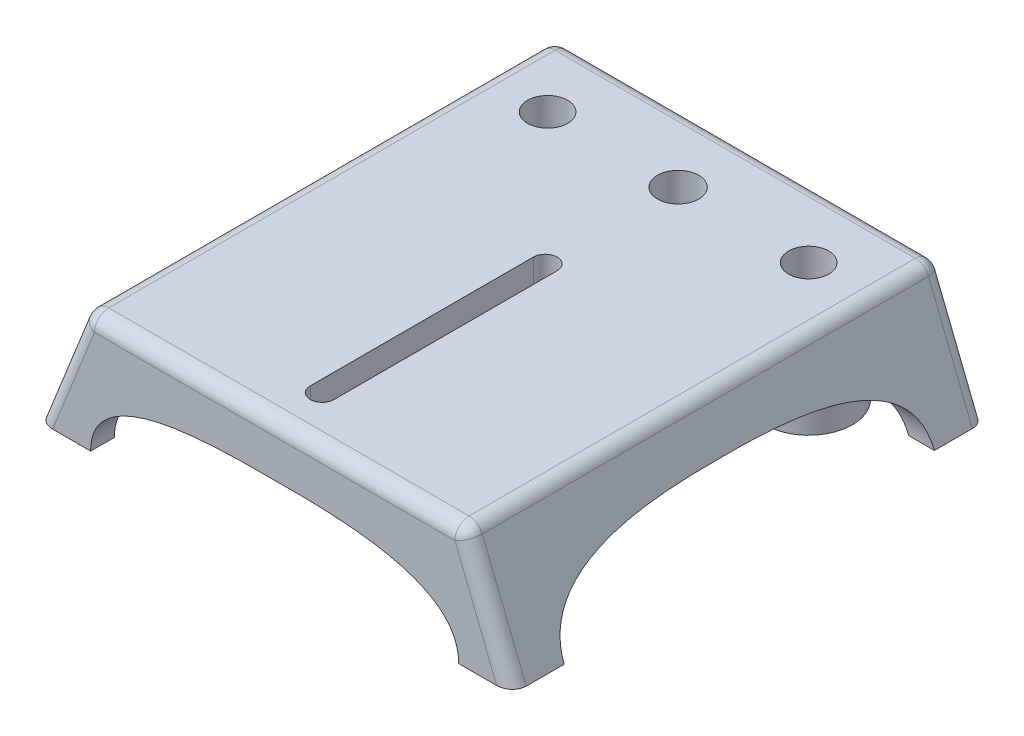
ISO-10303-21;
HEADER;
FILE_DESCRIPTION(('STEP AP214'),'2;1');
FILE_NAME('part.step','',(''),(''),'','','');
FILE_SCHEMA(('AUTOMOTIVE_DESIGN { 1 0 10303 214 1 1 1 1 }'));
ENDSEC;
DATA;
#1=APPLICATION_CONTEXT('core data for automotive mechanical design processes');
#2=APPLICATION_PROTOCOL_DEFINITION('international standard','automotive_design',2000,#1);
#3=PRODUCT_CONTEXT('',#1,'mechanical');
#4=PRODUCT('Part','Part','',(#3));
#5=PRODUCT_RELATED_PRODUCT_CATEGORY('part','',(#4));
#6=PRODUCT_DEFINITION_FORMATION('','',#4);
#7=PRODUCT_DEFINITION_CONTEXT('part definition',#1,'design');
#8=PRODUCT_DEFINITION('design','',#6,#7);
#9=PRODUCT_DEFINITION_SHAPE('','',#8);
#10=(LENGTH_UNIT() NAMED_UNIT(*) SI_UNIT(.MILLI.,.METRE.));
#11=(NAMED_UNIT(*) PLANE_ANGLE_UNIT() SI_UNIT($,.RADIAN.));
#12=(NAMED_UNIT(*) SI_UNIT($,.STERADIAN.) SOLID_ANGLE_UNIT());
#13=UNCERTAINTY_MEASURE_WITH_UNIT(LENGTH_MEASURE(1.E-05),#10,'distance_accuracy_value','');
#14=(GEOMETRIC_REPRESENTATION_CONTEXT(3) GLOBAL_UNCERTAINTY_ASSIGNED_CONTEXT((#13)) GLOBAL_UNIT_ASSIGNED_CONTEXT((#10,
#11,#12)) REPRESENTATION_CONTEXT('',''));
#15=CARTESIAN_POINT('',(0.,0.,0.));
#16=DIRECTION('',(0.,0.,1.));
#17=DIRECTION('',(1.,0.,0.));
#18=AXIS2_PLACEMENT_3D('',#15,#16,#17);
#19=CARTESIAN_POINT('',(-50.,0.,100.));
#20=DIRECTION('',(0.,1.,0.));
#21=DIRECTION('',(-1.,0.,0.));
#22=AXIS2_PLACEMENT_3D('',#19,#20,#21);
#23=PLANE('',#22);
#24=DIRECTION('',(1.,0.,0.));
#25=VECTOR('',#24,1.);
#26=CARTESIAN_POINT('',(-50.,0.,100.));
#27=LINE('',#26,#25);
#28=CARTESIAN_POINT('',(38.7697143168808,0.,100.));
#29=VERTEX_POINT('',#28);
#30=CARTESIAN_POINT('',(46.7697143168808,0.,100.));
#31=VERTEX_POINT('',#30);
#32=EDGE_CURVE('E647',#29,#31,#27,.T.);
#33=ORIENTED_EDGE('',*,*,#32,.F.);
#34=DIRECTION('',(0.,0.,1.));
#35=VECTOR('',#34,1.);
#36=CARTESIAN_POINT('',(38.7697143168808,0.,-0.001000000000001));
#37=LINE('',#36,#35);
#38=CARTESIAN_POINT('',(38.7697143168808,0.,95.));
#39=VERTEX_POINT('',#38);
#40=EDGE_CURVE('E371',#39,#29,#37,.T.);
#41=ORIENTED_EDGE('',*,*,#40,.F.);
#42=DIRECTION('',(1.,0.,0.));
#43=VECTOR('',#42,1.);
#44=CARTESIAN_POINT('',(-50.,0.,95.));
#45=LINE('',#44,#43);
#46=CARTESIAN_POINT('',(41.3859048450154,0.,95.));
#47=VERTEX_POINT('',#46);
#48=EDGE_CURVE('E376',#39,#47,#45,.T.);
#49=ORIENTED_EDGE('',*,*,#48,.T.);
#50=CARTESIAN_POINT('',(41.3859048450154,0.,92.));
#51=DIRECTION('',(0.,1.,0.));
#52=DIRECTION('',(-1.,0.,0.));
#53=AXIS2_PLACEMENT_3D('',#50,#51,#52);
#54=ELLIPSE('',#53,3.23028568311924,3.);
#55=CARTESIAN_POINT('',(44.6161905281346,0.,92.));
#56=VERTEX_POINT('',#55);
#57=EDGE_CURVE('E45',#47,#56,#54,.T.);
#58=ORIENTED_EDGE('',*,*,#57,.T.);
#59=DIRECTION('',(0.,0.,-1.));
#60=VECTOR('',#59,1.);
#61=CARTESIAN_POINT('',(44.6161905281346,0.,100.));
#62=LINE('',#61,#60);
#63=CARTESIAN_POINT('',(44.6161905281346,0.,89.));
#64=VERTEX_POINT('',#63);
#65=EDGE_CURVE('E565',#56,#64,#62,.T.);
#66=ORIENTED_EDGE('',*,*,#65,.T.);
#67=DIRECTION('',(1.,0.,0.));
#68=VECTOR('',#67,1.);
#69=CARTESIAN_POINT('',(-50.001,0.,89.));
#70=LINE('',#69,#68);
#71=CARTESIAN_POINT('',(50.,0.,89.));
#72=VERTEX_POINT('',#71);
#73=EDGE_CURVE('E460',#64,#72,#70,.T.);
#74=ORIENTED_EDGE('',*,*,#73,.T.);
#75=DIRECTION('',(0.,0.,-1.));
#76=VECTOR('',#75,1.);
#77=CARTESIAN_POINT('',(50.,0.,100.));
#78=LINE('',#77,#76);
#79=CARTESIAN_POINT('',(50.,0.,97.));
#80=VERTEX_POINT('',#79);
#81=EDGE_CURVE('E650',#80,#72,#78,.T.);
#82=ORIENTED_EDGE('',*,*,#81,.F.);
#83=CARTESIAN_POINT('',(46.7697143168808,0.,97.));
#84=DIRECTION('',(0.,1.,0.));
#85=DIRECTION('',(1.,0.,0.));
#86=AXIS2_PLACEMENT_3D('',#83,#84,#85);
#87=ELLIPSE('',#86,3.23028568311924,3.);
#88=EDGE_CURVE('E887',#80,#31,#87,.F.);
#89=ORIENTED_EDGE('',*,*,#88,.T.);
#90=EDGE_LOOP('',(#33,#41,#49,#58,#66,#74,#82,#89));
#91=FACE_BOUND('',#90,.T.);
#92=ADVANCED_FACE('F36',(#91),#23,.F.);
#93=CARTESIAN_POINT('',(-41.3859048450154,0.,95.));
#94=VERTEX_POINT('',#93);
#95=CARTESIAN_POINT('',(-38.7697143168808,0.,95.));
#96=VERTEX_POINT('',#95);
#97=EDGE_CURVE('E570',#94,#96,#45,.T.);
#98=ORIENTED_EDGE('',*,*,#97,.T.);
#99=DIRECTION('',(0.,0.,1.));
#100=VECTOR('',#99,1.);
#101=CARTESIAN_POINT('',(-38.7697143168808,0.,-0.001000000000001));
#102=LINE('',#101,#100);
#103=CARTESIAN_POINT('',(-38.7697143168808,0.,100.));
#104=VERTEX_POINT('',#103);
#105=EDGE_CURVE('E53',#96,#104,#102,.T.);
#106=ORIENTED_EDGE('',*,*,#105,.T.);
#107=CARTESIAN_POINT('',(-46.7697143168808,0.,100.));
#108=VERTEX_POINT('',#107);
#109=EDGE_CURVE('E643',#108,#104,#27,.T.);
#110=ORIENTED_EDGE('',*,*,#109,.F.);
#111=CARTESIAN_POINT('',(-46.7697143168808,0.,97.));
#112=DIRECTION('',(0.,1.,0.));
#113=DIRECTION('',(1.,0.,0.));
#114=AXIS2_PLACEMENT_3D('',#111,#112,#113);
#115=ELLIPSE('',#114,3.23028568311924,3.);
#116=CARTESIAN_POINT('',(-50.,0.,97.));
#117=VERTEX_POINT('',#116);
#118=EDGE_CURVE('E875',#108,#117,#115,.F.);
#119=ORIENTED_EDGE('',*,*,#118,.T.);
#120=DIRECTION('',(0.,0.,-1.));
#121=VECTOR('',#120,1.);
#122=CARTESIAN_POINT('',(-50.,0.,100.));
#123=LINE('',#122,#121);
#124=CARTESIAN_POINT('',(-50.,0.,89.));
#125=VERTEX_POINT('',#124);
#126=EDGE_CURVE('E654',#117,#125,#123,.T.);
#127=ORIENTED_EDGE('',*,*,#126,.T.);
#128=DIRECTION('',(-1.,0.,0.));
#129=VECTOR('',#128,1.);
#130=CARTESIAN_POINT('',(50.001,0.,89.));
#131=LINE('',#130,#129);
#132=CARTESIAN_POINT('',(-44.6161905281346,0.,89.));
#133=VERTEX_POINT('',#132);
#134=EDGE_CURVE('E370',#133,#125,#131,.T.);
#135=ORIENTED_EDGE('',*,*,#134,.F.);
#136=DIRECTION('',(0.,0.,-1.));
#137=VECTOR('',#136,1.);
#138=CARTESIAN_POINT('',(-44.6161905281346,0.,100.));
#139=LINE('',#138,#137);
#140=CARTESIAN_POINT('',(-44.6161905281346,0.,92.));
#141=VERTEX_POINT('',#140);
#142=EDGE_CURVE('E572',#141,#133,#139,.T.);
#143=ORIENTED_EDGE('',*,*,#142,.F.);
#144=CARTESIAN_POINT('',(-41.3859048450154,0.,92.));
#145=DIRECTION('',(0.,1.,0.));
#146=DIRECTION('',(-1.,0.,0.));
#147=AXIS2_PLACEMENT_3D('',#144,#145,#146);
#148=ELLIPSE('',#147,3.23028568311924,3.);
#149=EDGE_CURVE('E11',#141,#94,#148,.T.);
#150=ORIENTED_EDGE('',*,*,#149,.T.);
#151=EDGE_LOOP('',(#98,#106,#110,#119,#127,#135,#143,#150));
#152=FACE_BOUND('',#151,.T.);
#153=ADVANCED_FACE('F842',(#152),#23,.F.);
#154=DIRECTION('',(-1.,0.,0.));
#155=VECTOR('',#154,1.);
#156=CARTESIAN_POINT('',(50.001,0.,11.));
#157=LINE('',#156,#155);
#158=CARTESIAN_POINT('',(-44.6161905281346,0.,11.));
#159=VERTEX_POINT('',#158);
#160=CARTESIAN_POINT('',(-50.,0.,11.));
#161=VERTEX_POINT('',#160);
#162=EDGE_CURVE('E61',#159,#161,#157,.T.);
#163=ORIENTED_EDGE('',*,*,#162,.T.);
#164=CARTESIAN_POINT('',(-50.,0.,3.));
#165=VERTEX_POINT('',#164);
#166=EDGE_CURVE('E653',#161,#165,#123,.T.);
#167=ORIENTED_EDGE('',*,*,#166,.T.);
#168=CARTESIAN_POINT('',(-46.7697143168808,0.,3.));
#169=DIRECTION('',(0.,1.,0.));
#170=DIRECTION('',(-1.,0.,0.));
#171=AXIS2_PLACEMENT_3D('',#168,#169,#170);
#172=ELLIPSE('',#171,3.23028568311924,3.);
#173=CARTESIAN_POINT('',(-46.7697143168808,0.,0.));
#174=VERTEX_POINT('',#173);
#175=EDGE_CURVE('E878',#165,#174,#172,.F.);
#176=ORIENTED_EDGE('',*,*,#175,.T.);
#177=DIRECTION('',(1.,0.,0.));
#178=VECTOR('',#177,1.);
#179=CARTESIAN_POINT('',(-50.,0.,0.));
#180=LINE('',#179,#178);
#181=CARTESIAN_POINT('',(46.7697143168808,0.,0.));
#182=VERTEX_POINT('',#181);
#183=EDGE_CURVE('E640',#174,#182,#180,.T.);
#184=ORIENTED_EDGE('',*,*,#183,.T.);
#185=CARTESIAN_POINT('',(46.7697143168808,0.,3.));
#186=DIRECTION('',(0.,1.,0.));
#187=DIRECTION('',(-1.,0.,0.));
#188=AXIS2_PLACEMENT_3D('',#185,#186,#187);
#189=ELLIPSE('',#188,3.23028568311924,3.);
#190=CARTESIAN_POINT('',(50.,0.,3.));
#191=VERTEX_POINT('',#190);
#192=EDGE_CURVE('E882',#182,#191,#189,.F.);
#193=ORIENTED_EDGE('',*,*,#192,.T.);
#194=CARTESIAN_POINT('',(50.,0.,11.));
#195=VERTEX_POINT('',#194);
#196=EDGE_CURVE('E646',#195,#191,#78,.T.);
#197=ORIENTED_EDGE('',*,*,#196,.F.);
#198=DIRECTION('',(1.,0.,0.));
#199=VECTOR('',#198,1.);
#200=CARTESIAN_POINT('',(-50.001,0.,11.));
#201=LINE('',#200,#199);
#202=CARTESIAN_POINT('',(44.6161905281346,0.,11.));
#203=VERTEX_POINT('',#202);
#204=EDGE_CURVE('E461',#203,#195,#201,.T.);
#205=ORIENTED_EDGE('',*,*,#204,.F.);
#206=CARTESIAN_POINT('',(44.6161905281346,0.,8.00000000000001));
#207=VERTEX_POINT('',#206);
#208=EDGE_CURVE('E569',#203,#207,#62,.T.);
#209=ORIENTED_EDGE('',*,*,#208,.T.);
#210=CARTESIAN_POINT('',(41.3859048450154,0.,8.));
#211=DIRECTION('',(0.,1.,0.));
#212=DIRECTION('',(1.,0.,0.));
#213=AXIS2_PLACEMENT_3D('',#210,#211,#212);
#214=ELLIPSE('',#213,3.23028568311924,3.);
#215=CARTESIAN_POINT('',(41.3859048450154,0.,5.));
#216=VERTEX_POINT('',#215);
#217=EDGE_CURVE('E884',#207,#216,#214,.T.);
#218=ORIENTED_EDGE('',*,*,#217,.T.);
#219=DIRECTION('',(1.,0.,0.));
#220=VECTOR('',#219,1.);
#221=CARTESIAN_POINT('',(-50.,0.,5.));
#222=LINE('',#221,#220);
#223=CARTESIAN_POINT('',(-41.3859048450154,0.,5.));
#224=VERTEX_POINT('',#223);
#225=EDGE_CURVE('E555',#224,#216,#222,.T.);
#226=ORIENTED_EDGE('',*,*,#225,.F.);
#227=CARTESIAN_POINT('',(-41.3859048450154,0.,8.));
#228=DIRECTION('',(0.,1.,0.));
#229=DIRECTION('',(1.,0.,0.));
#230=AXIS2_PLACEMENT_3D('',#227,#228,#229);
#231=ELLIPSE('',#230,3.23028568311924,3.);
#232=CARTESIAN_POINT('',(-44.6161905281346,0.,8.00000000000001));
#233=VERTEX_POINT('',#232);
#234=EDGE_CURVE('E881',#224,#233,#231,.T.);
#235=ORIENTED_EDGE('',*,*,#234,.T.);
#236=EDGE_CURVE('E568',#159,#233,#139,.T.);
#237=ORIENTED_EDGE('',*,*,#236,.F.);
#238=EDGE_LOOP('',(#163,#167,#176,#184,#193,#197,#205,#209,#218,#226,#235,#237));
#239=FACE_BOUND('',#238,.T.);
#240=ADVANCED_FACE('F845',(#239),#23,.F.);
#241=CARTESIAN_POINT('',(-40.,25.0457363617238,100.));
#242=DIRECTION('',(0.92871042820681,-0.37080579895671,0.));
#243=DIRECTION('',(0.37080579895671,0.92871042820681,0.));
#244=AXIS2_PLACEMENT_3D('',#241,#242,#243);
#245=PLANE('',#244);
#246=CARTESIAN_POINT('',(-43.9478107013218,15.1581537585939,50.));
#247=CARTESIAN_POINT('',(-43.9478070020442,15.1581630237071,50.320302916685));
#248=CARTESIAN_POINT('',(-43.9478837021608,15.1579709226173,50.6406060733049));
#249=CARTESIAN_POINT('',(-43.9483027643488,15.1569213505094,51.2812129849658));
#250=CARTESIAN_POINT('',(-43.9486451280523,15.1560638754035,51.6015167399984));
#251=CARTESIAN_POINT('',(-43.9502297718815,15.1520950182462,52.5634922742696));
#252=CARTESIAN_POINT('',(-43.9520303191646,15.1475854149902,53.2051592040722));
#253=CARTESIAN_POINT('',(-43.9577491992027,15.1332620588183,54.4891447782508));
#254=CARTESIAN_POINT('',(-43.961669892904,15.1234423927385,55.1314633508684));
#255=CARTESIAN_POINT('',(-43.972147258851,15.0972010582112,56.4163532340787));
#256=CARTESIAN_POINT('',(-43.9787055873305,15.080775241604,57.0589244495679));
#257=CARTESIAN_POINT('',(-43.994933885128,15.0401302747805,58.3439229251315));
#258=CARTESIAN_POINT('',(-44.0046045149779,15.0159094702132,58.9863501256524));
#259=CARTESIAN_POINT('',(-44.0278668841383,14.9576471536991,60.2897877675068));
#260=CARTESIAN_POINT('',(-44.0415663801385,14.9233357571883,60.9507844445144));
#261=CARTESIAN_POINT('',(-44.0732963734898,14.8438656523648,62.2718029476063));
#262=CARTESIAN_POINT('',(-44.0913253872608,14.7987106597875,62.9318250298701));
#263=CARTESIAN_POINT('',(-44.1322993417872,14.6960883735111,64.2504729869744));
#264=CARTESIAN_POINT('',(-44.1552420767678,14.638626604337,64.9090993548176));
#265=CARTESIAN_POINT('',(-44.2067069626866,14.509729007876,66.2245119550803));
#266=CARTESIAN_POINT('',(-44.2352268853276,14.4382987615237,66.8812988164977));
#267=CARTESIAN_POINT('',(-44.29862078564,14.2795240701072,68.1925776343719));
#268=CARTESIAN_POINT('',(-44.3334939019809,14.1921817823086,68.8470698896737));
#269=CARTESIAN_POINT('',(-44.3985926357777,14.0291372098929,69.9508464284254));
#270=CARTESIAN_POINT('',(-44.4269161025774,13.9581990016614,70.4009480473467));
#271=CARTESIAN_POINT('',(-44.4873859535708,13.8067478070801,71.2993442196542));
#272=CARTESIAN_POINT('',(-44.5195327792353,13.7262337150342,71.7476385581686));
#273=CARTESIAN_POINT('',(-44.5880499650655,13.5546273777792,72.6419697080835));
#274=CARTESIAN_POINT('',(-44.6244211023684,13.4635331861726,73.0880060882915));
#275=CARTESIAN_POINT('',(-44.7018553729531,13.2695933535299,73.9773389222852));
#276=CARTESIAN_POINT('',(-44.7429206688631,13.1667422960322,74.4206340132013));
#277=CARTESIAN_POINT('',(-44.8299442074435,12.9487854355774,75.3003860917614));
#278=CARTESIAN_POINT('',(-44.8758658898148,12.8337712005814,75.7368692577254));
#279=CARTESIAN_POINT('',(-44.9734218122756,12.5894352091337,76.605165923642));
#280=CARTESIAN_POINT('',(-45.0250557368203,12.4601142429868,77.0369796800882));
#281=CARTESIAN_POINT('',(-45.1346779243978,12.1855574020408,77.894446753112));
#282=CARTESIAN_POINT('',(-45.1926624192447,12.0403309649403,78.3201035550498));
#283=CARTESIAN_POINT('',(-45.3157433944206,11.7320655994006,79.1636705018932));
#284=CARTESIAN_POINT('',(-45.3808362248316,11.5690358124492,79.5815844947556));
#285=CARTESIAN_POINT('',(-45.5140042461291,11.2355066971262,80.3777965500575));
#286=CARTESIAN_POINT('',(-45.5815213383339,11.0664051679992,80.7567705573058));
#287=CARTESIAN_POINT('',(-45.7241774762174,10.7091123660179,81.5042040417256));
#288=CARTESIAN_POINT('',(-45.7993165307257,10.5209210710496,81.8726635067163));
#289=CARTESIAN_POINT('',(-45.95801355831,10.1234526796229,82.5963488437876));
#290=CARTESIAN_POINT('',(-46.041573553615,9.91417051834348,82.9515715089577));
#291=CARTESIAN_POINT('',(-46.2178553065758,9.4726598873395,83.645145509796));
#292=CARTESIAN_POINT('',(-46.3105758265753,9.24043451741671,83.9834991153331));
#293=CARTESIAN_POINT('',(-46.4917761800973,8.78660488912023,84.5918706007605));
#294=CARTESIAN_POINT('',(-46.5789472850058,8.56827843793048,84.8647169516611));
#295=CARTESIAN_POINT('',(-46.7607474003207,8.11294666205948,85.3917700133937));
#296=CARTESIAN_POINT('',(-46.855375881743,7.87594266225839,85.6459780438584));
#297=CARTESIAN_POINT('',(-47.0519698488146,7.38355859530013,86.1319296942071));
#298=CARTESIAN_POINT('',(-47.1539218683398,7.12821225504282,86.3637127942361));
#299=CARTESIAN_POINT('',(-47.3650967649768,6.59930917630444,86.8019343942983));
#300=CARTESIAN_POINT('',(-47.4743193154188,6.32575325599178,87.0083740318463));
#301=CARTESIAN_POINT('',(-47.6624759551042,5.85450109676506,87.3296988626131));
#302=CARTESIAN_POINT('',(-47.7395889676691,5.66136587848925,87.4523989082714));
#303=CARTESIAN_POINT('',(-47.8965833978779,5.26816176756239,87.6842517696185));
#304=CARTESIAN_POINT('',(-47.9764650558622,5.06809227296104,87.7934034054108));
#305=CARTESIAN_POINT('',(-48.138672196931,4.66183254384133,87.9975753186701));
#306=CARTESIAN_POINT('',(-48.2209976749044,4.45564232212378,88.0925956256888));
#307=CARTESIAN_POINT('',(-48.3878939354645,4.03763834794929,88.2683478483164));
#308=CARTESIAN_POINT('',(-48.4724685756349,3.82581493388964,88.3490531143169));
#309=CARTESIAN_POINT('',(-48.6433356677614,3.39786571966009,88.495880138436));
#310=CARTESIAN_POINT('',(-48.7296281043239,3.18173995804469,88.5620020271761));
#311=CARTESIAN_POINT('',(-48.9035285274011,2.74619354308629,88.6798077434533));
#312=CARTESIAN_POINT('',(-48.991136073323,2.52677399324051,88.7314962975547));
#313=CARTESIAN_POINT('',(-49.1299072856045,2.17921127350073,88.801864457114));
#314=CARTESIAN_POINT('',(-49.1807512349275,2.05186885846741,88.8252411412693));
#315=CARTESIAN_POINT('',(-49.2826861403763,1.79656538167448,88.8674436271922));
#316=CARTESIAN_POINT('',(-49.3337770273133,1.66860449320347,88.8862706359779));
#317=CARTESIAN_POINT('',(-49.4361506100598,1.41220231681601,88.9194895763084));
#318=CARTESIAN_POINT('',(-49.4874332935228,1.28376105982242,88.9338817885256));
#319=CARTESIAN_POINT('',(-49.692084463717,0.7711971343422,88.9826626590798));
#320=CARTESIAN_POINT('',(-49.8460342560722,0.385618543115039,89.000038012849));
#321=CARTESIAN_POINT('',(-50.,0.,89.));
#322=B_SPLINE_CURVE_WITH_KNOTS('',3,(#246,#247,#248,#249,#250,#251,#252,#253,#254,#255,#256,
#257,#258,#259,#260,#261,#262,#263,#264,#265,#266,#267,#268,#269,#270,#271,#272,#273,#274,#275,
#276,#277,#278,#279,#280,#281,#282,#283,#284,#285,#286,#287,#288,#289,#290,#291,#292,#293,#294,
#295,#296,#297,#298,#299,#300,#301,#302,#303,#304,#305,#306,#307,#308,#309,#310,#311,#312,#313,
#314,#315,#316,#317,#318,#319,#320,#321),.UNSPECIFIED.,.F.,.F.,(4,2,2,2,2,2,2,2,2,2,2,2,2,2,2,2,
2,2,2,2,2,2,2,2,2,2,2,2,2,2,2,2,2,2,2,2,2,4),(0.,0.960908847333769,1.92182359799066,
3.84686041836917,5.77404534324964,7.70244228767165,9.63124877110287,11.6172429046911,
13.6025574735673,15.5869826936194,17.5706166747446,19.553981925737,20.9234901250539,
22.29315661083,23.6630754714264,25.0336280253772,26.3945121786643,27.7553211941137,
29.1153270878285,30.4746379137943,31.735427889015,32.9962193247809,34.2573142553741,
35.5182390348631,36.5977740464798,37.6772325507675,38.7547546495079,39.8322283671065,
40.5561580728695,41.280150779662,42.0041419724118,42.7294671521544,43.4547858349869,
44.1798667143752,44.59708880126,45.0142000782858,45.4312849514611,46.6762574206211),.UNSPECIFIED.);
#323=CARTESIAN_POINT('',(-43.9478107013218,15.1581537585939,50.));
#324=VERTEX_POINT('',#323);
#325=EDGE_CURVE('E446',#324,#125,#322,.T.);
#326=ORIENTED_EDGE('',*,*,#325,.T.);
#327=ORIENTED_EDGE('',*,*,#126,.F.);
#328=DIRECTION('',(-0.37080579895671,-0.92871042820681,0.));
#329=VECTOR('',#328,1.);
#330=CARTESIAN_POINT('',(-40.,25.0457363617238,97.));
#331=LINE('',#330,#329);
#332=CARTESIAN_POINT('',(-40.7536542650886,23.1581537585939,97.));
#333=VERTEX_POINT('',#332);
#334=EDGE_CURVE('E976',#117,#333,#331,.F.);
#335=ORIENTED_EDGE('',*,*,#334,.T.);
#336=DIRECTION('',(0.,0.,-1.));
#337=VECTOR('',#336,1.);
#338=CARTESIAN_POINT('',(-40.7536542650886,23.1581537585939,100.));
#339=LINE('',#338,#337);
#340=CARTESIAN_POINT('',(-40.7536542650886,23.1581537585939,3.));
#341=VERTEX_POINT('',#340);
#342=EDGE_CURVE('E872',#333,#341,#339,.T.);
#343=ORIENTED_EDGE('',*,*,#342,.T.);
#344=DIRECTION('',(-0.37080579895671,-0.92871042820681,0.));
#345=VECTOR('',#344,1.);
#346=CARTESIAN_POINT('',(-40.,25.0457363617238,3.));
#347=LINE('',#346,#345);
#348=EDGE_CURVE('E869',#341,#165,#347,.T.);
#349=ORIENTED_EDGE('',*,*,#348,.T.);
#350=ORIENTED_EDGE('',*,*,#166,.F.);
#351=CARTESIAN_POINT('',(-50.,0.,11.));
#352=CARTESIAN_POINT('',(-49.9310425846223,0.172708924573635,10.999996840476));
#353=CARTESIAN_POINT('',(-49.8620796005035,0.34543179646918,11.0034743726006));
#354=CARTESIAN_POINT('',(-49.7241609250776,0.690859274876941,11.0177372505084));
#355=CARTESIAN_POINT('',(-49.6552053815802,0.863563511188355,11.0285329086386));
#356=CARTESIAN_POINT('',(-49.5174698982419,1.20853217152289,11.0577900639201));
#357=CARTESIAN_POINT('',(-49.4486901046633,1.38079622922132,11.0762566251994));
#358=CARTESIAN_POINT('',(-49.3114774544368,1.72445541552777,11.121163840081));
#359=CARTESIAN_POINT('',(-49.2430446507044,1.89585041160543,11.1476056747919));
#360=CARTESIAN_POINT('',(-49.1068398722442,2.23698530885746,11.2086574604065));
#361=CARTESIAN_POINT('',(-49.0390667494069,2.40672808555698,11.2432487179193));
#362=CARTESIAN_POINT('',(-48.904208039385,2.74449165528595,11.3208258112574));
#363=CARTESIAN_POINT('',(-48.8371222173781,2.91251303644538,11.3638086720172));
#364=CARTESIAN_POINT('',(-48.7038006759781,3.24642665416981,11.4583069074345));
#365=CARTESIAN_POINT('',(-48.6375647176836,3.41231948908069,11.5098198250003));
#366=CARTESIAN_POINT('',(-48.5061024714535,3.74157636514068,11.6214462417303));
#367=CARTESIAN_POINT('',(-48.4408761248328,3.90494055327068,11.6815592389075));
#368=CARTESIAN_POINT('',(-48.2893573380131,4.28443051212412,11.8325434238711));
#369=CARTESIAN_POINT('',(-48.203536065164,4.49937620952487,11.9268822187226));
#370=CARTESIAN_POINT('',(-48.0344036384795,4.92298082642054,12.1308253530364));
#371=CARTESIAN_POINT('',(-47.9510931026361,5.13163819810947,12.2404334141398));
#372=CARTESIAN_POINT('',(-47.7873627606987,5.54171289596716,12.4743357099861));
#373=CARTESIAN_POINT('',(-47.7069428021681,5.74313060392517,12.5986291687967));
#374=CARTESIAN_POINT('',(-47.5494173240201,6.13766476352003,12.8608921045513));
#375=CARTESIAN_POINT('',(-47.4723065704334,6.33079432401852,12.9988387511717));
#376=CARTESIAN_POINT('',(-47.3214764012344,6.70855958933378,13.2876134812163));
#377=CARTESIAN_POINT('',(-47.2477570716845,6.89319507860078,13.4384418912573));
#378=CARTESIAN_POINT('',(-47.1038565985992,7.25360440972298,13.7518727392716));
#379=CARTESIAN_POINT('',(-47.0336755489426,7.42937801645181,13.914475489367));
#380=CARTESIAN_POINT('',(-46.8478345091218,7.89483058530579,14.3708803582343));
#381=CARTESIAN_POINT('',(-46.735671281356,8.17575164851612,14.6751123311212));
#382=CARTESIAN_POINT('',(-46.5218895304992,8.71118378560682,15.3092748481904));
#383=CARTESIAN_POINT('',(-46.4202732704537,8.96568919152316,15.6392108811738));
#384=CARTESIAN_POINT('',(-46.2267936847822,9.4502730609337,16.3205879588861));
#385=CARTESIAN_POINT('',(-46.1349579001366,9.68028254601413,16.6720855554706));
#386=CARTESIAN_POINT('',(-45.9606162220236,10.1169341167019,17.3914308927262));
#387=CARTESIAN_POINT('',(-45.8781105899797,10.3235755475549,17.7592790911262));
#388=CARTESIAN_POINT('',(-45.7306587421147,10.6928795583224,18.4645113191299));
#389=CARTESIAN_POINT('',(-45.664785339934,10.8578643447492,18.8004966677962));
#390=CARTESIAN_POINT('',(-45.5390876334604,11.1726835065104,19.4807478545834));
#391=CARTESIAN_POINT('',(-45.4792659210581,11.3225113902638,19.8250171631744));
#392=CARTESIAN_POINT('',(-45.3651303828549,11.6083722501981,20.520326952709));
#393=CARTESIAN_POINT('',(-45.310819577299,11.7443976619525,20.8713710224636));
#394=CARTESIAN_POINT('',(-45.207238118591,12.0038250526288,21.5788183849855));
#395=CARTESIAN_POINT('',(-45.157967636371,12.1272266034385,21.9352218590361));
#396=CARTESIAN_POINT('',(-45.0636884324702,12.3633558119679,22.6548538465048));
#397=CARTESIAN_POINT('',(-45.018711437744,12.4760040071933,23.018112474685));
#398=CARTESIAN_POINT('',(-44.9330069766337,12.6906571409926,23.7480662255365));
#399=CARTESIAN_POINT('',(-44.8922776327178,12.7926667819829,24.1147597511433));
#400=CARTESIAN_POINT('',(-44.8146792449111,12.9870176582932,24.8510193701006));
#401=CARTESIAN_POINT('',(-44.7778094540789,13.0793607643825,25.2205848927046));
#402=CARTESIAN_POINT('',(-44.7075965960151,13.2552140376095,25.9620592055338));
#403=CARTESIAN_POINT('',(-44.6742528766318,13.3387258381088,26.3339675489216));
#404=CARTESIAN_POINT('',(-44.5873416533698,13.5564013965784,27.3552246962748));
#405=CARTESIAN_POINT('',(-44.5370277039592,13.6824163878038,28.0065959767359));
#406=CARTESIAN_POINT('',(-44.4447849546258,13.9134451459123,29.3136913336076));
#407=CARTESIAN_POINT('',(-44.4028575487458,14.0184554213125,29.9694161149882));
#408=CARTESIAN_POINT('',(-44.3262695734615,14.2102756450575,31.2844408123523));
#409=CARTESIAN_POINT('',(-44.2916146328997,14.2970714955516,31.9437430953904));
#410=CARTESIAN_POINT('',(-44.2286612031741,14.454742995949,33.2651756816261));
#411=CARTESIAN_POINT('',(-44.2003688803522,14.5256032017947,33.9273080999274));
#412=CARTESIAN_POINT('',(-44.149378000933,14.6533136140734,35.2537117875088));
#413=CARTESIAN_POINT('',(-44.1266843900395,14.7101514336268,35.9179844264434));
#414=CARTESIAN_POINT('',(-44.0862329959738,14.8114649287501,37.2480114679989));
#415=CARTESIAN_POINT('',(-44.0684781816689,14.8559331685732,37.9137665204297));
#416=CARTESIAN_POINT('',(-44.0380352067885,14.9321798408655,39.2154994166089));
#417=CARTESIAN_POINT('',(-44.0251522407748,14.9644461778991,39.8514445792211));
#418=CARTESIAN_POINT('',(-44.0028762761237,15.0202379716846,41.1235424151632));
#419=CARTESIAN_POINT('',(-43.9934820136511,15.0437665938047,41.7596949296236));
#420=CARTESIAN_POINT('',(-43.9777290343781,15.0832210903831,43.0316108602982));
#421=CARTESIAN_POINT('',(-43.9713671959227,15.0991547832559,43.6673740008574));
#422=CARTESIAN_POINT('',(-43.9612138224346,15.1245846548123,44.9379136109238));
#423=CARTESIAN_POINT('',(-43.9574177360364,15.1340922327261,45.5726898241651));
#424=CARTESIAN_POINT('',(-43.9518870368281,15.1479442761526,46.8406543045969));
#425=CARTESIAN_POINT('',(-43.950147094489,15.1523020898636,47.4738424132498));
#426=CARTESIAN_POINT('',(-43.9486168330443,15.1561347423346,48.4225295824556));
#427=CARTESIAN_POINT('',(-43.948286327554,15.1569625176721,48.7380240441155));
#428=CARTESIAN_POINT('',(-43.947881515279,15.1579763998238,49.3690124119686));
#429=CARTESIAN_POINT('',(-43.947807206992,15.1581625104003,49.6845063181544));
#430=CARTESIAN_POINT('',(-43.9478107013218,15.1581537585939,50.));
#431=B_SPLINE_CURVE_WITH_KNOTS('',3,(#351,#352,#353,#354,#355,#356,#357,#358,#359,#360,#361,
#362,#363,#364,#365,#366,#367,#368,#369,#370,#371,#372,#373,#374,#375,#376,#377,#378,#379,#380,
#381,#382,#383,#384,#385,#386,#387,#388,#389,#390,#391,#392,#393,#394,#395,#396,#397,#398,#399,
#400,#401,#402,#403,#404,#405,#406,#407,#408,#409,#410,#411,#412,#413,#414,#415,#416,#417,#418,
#419,#420,#421,#422,#423,#424,#425,#426,#427,#428,#429,#430),.UNSPECIFIED.,.F.,.F.,(4,2,2,2,2,2,
2,2,2,2,2,2,2,2,2,2,2,2,2,2,2,2,2,2,2,2,2,2,2,2,2,2,2,2,2,2,2,2,2,4),(0.,0.55788888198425,
1.11656555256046,1.67561163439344,2.23474054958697,2.79259919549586,3.35026042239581,
3.90776129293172,4.46522963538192,5.2144501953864,5.96385368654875,6.71321759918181,
7.46134897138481,8.20949931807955,8.95766950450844,10.242628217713,11.5278620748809,
12.8166243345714,14.1054226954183,15.2451262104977,16.3853158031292,17.526126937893,
18.6669767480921,19.8156926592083,20.9638986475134,22.1118820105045,23.2596526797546,
25.2552001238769,27.2510790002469,29.2484970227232,31.2478425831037,33.2489480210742,
35.2512538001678,37.1618563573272,39.0717660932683,40.9797054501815,42.8842513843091,
44.7838498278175,45.7303365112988,46.6768176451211),.UNSPECIFIED.);
#432=EDGE_CURVE('E428',#161,#324,#431,.T.);
#433=ORIENTED_EDGE('',*,*,#432,.T.);
#434=EDGE_LOOP('',(#326,#327,#335,#343,#349,#350,#433));
#435=FACE_BOUND('',#434,.T.);
#436=ADVANCED_FACE('F854',(#435),#245,.F.);
#437=CARTESIAN_POINT('',(-35.356447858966,23.1917073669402,100.));
#438=DIRECTION('',(0.92871042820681,-0.37080579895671,0.));
#439=DIRECTION('',(0.37080579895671,0.92871042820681,0.));
#440=AXIS2_PLACEMENT_3D('',#437,#438,#439);
#441=PLANE('',#440);
#442=ORIENTED_EDGE('',*,*,#142,.T.);
#443=CARTESIAN_POINT('',(-38.5640012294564,15.1581537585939,50.));
#444=CARTESIAN_POINT('',(-38.5639975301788,15.1581630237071,50.320302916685));
#445=CARTESIAN_POINT('',(-38.5640742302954,15.1579709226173,50.6406060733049));
#446=CARTESIAN_POINT('',(-38.5644932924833,15.1569213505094,51.2812129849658));
#447=CARTESIAN_POINT('',(-38.5648356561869,15.1560638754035,51.6015167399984));
#448=CARTESIAN_POINT('',(-38.5664203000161,15.1520950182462,52.5634922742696));
#449=CARTESIAN_POINT('',(-38.5682208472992,15.1475854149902,53.2051592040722));
#450=CARTESIAN_POINT('',(-38.5739397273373,15.1332620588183,54.4891447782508));
#451=CARTESIAN_POINT('',(-38.5778604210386,15.1234423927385,55.1314633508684));
#452=CARTESIAN_POINT('',(-38.5883377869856,15.0972010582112,56.4163532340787));
#453=CARTESIAN_POINT('',(-38.5948961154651,15.080775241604,57.0589244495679));
#454=CARTESIAN_POINT('',(-38.6111244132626,15.0401302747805,58.3439229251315));
#455=CARTESIAN_POINT('',(-38.6207950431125,15.0159094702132,58.9863501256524));
#456=CARTESIAN_POINT('',(-38.644057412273,14.9576471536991,60.2897877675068));
#457=CARTESIAN_POINT('',(-38.6577569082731,14.9233357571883,60.9507844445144));
#458=CARTESIAN_POINT('',(-38.6894869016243,14.8438656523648,62.2718029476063));
#459=CARTESIAN_POINT('',(-38.7075159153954,14.7987106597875,62.9318250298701));
#460=CARTESIAN_POINT('',(-38.7484898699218,14.6960883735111,64.2504729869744));
#461=CARTESIAN_POINT('',(-38.7714326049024,14.638626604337,64.9090993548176));
#462=CARTESIAN_POINT('',(-38.8228974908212,14.509729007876,66.2245119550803));
#463=CARTESIAN_POINT('',(-38.8514174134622,14.4382987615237,66.8812988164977));
#464=CARTESIAN_POINT('',(-38.9148113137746,14.2795240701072,68.1925776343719));
#465=CARTESIAN_POINT('',(-38.9496844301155,14.1921817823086,68.8470698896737));
#466=CARTESIAN_POINT('',(-39.0147831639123,14.0291372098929,69.9508464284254));
#467=CARTESIAN_POINT('',(-39.043106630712,13.9581990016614,70.4009480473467));
#468=CARTESIAN_POINT('',(-39.1035764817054,13.8067478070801,71.2993442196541));
#469=CARTESIAN_POINT('',(-39.1357233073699,13.7262337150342,71.7476385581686));
#470=CARTESIAN_POINT('',(-39.2042404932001,13.5546273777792,72.6419697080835));
#471=CARTESIAN_POINT('',(-39.240611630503,13.4635331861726,73.0880060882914));
#472=CARTESIAN_POINT('',(-39.3180459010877,13.2695933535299,73.9773389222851));
#473=CARTESIAN_POINT('',(-39.3591111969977,13.1667422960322,74.4206340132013));
#474=CARTESIAN_POINT('',(-39.4461347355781,12.9487854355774,75.3003860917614));
#475=CARTESIAN_POINT('',(-39.4920564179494,12.8337712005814,75.7368692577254));
#476=CARTESIAN_POINT('',(-39.5896123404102,12.5894352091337,76.605165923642));
#477=CARTESIAN_POINT('',(-39.6412462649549,12.4601142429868,77.0369796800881));
#478=CARTESIAN_POINT('',(-39.7508684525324,12.1855574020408,77.894446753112));
#479=CARTESIAN_POINT('',(-39.8088529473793,12.0403309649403,78.3201035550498));
#480=CARTESIAN_POINT('',(-39.9319339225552,11.7320655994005,79.1636705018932));
#481=CARTESIAN_POINT('',(-39.9970267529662,11.5690358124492,79.5815844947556));
#482=CARTESIAN_POINT('',(-40.1301947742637,11.2355066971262,80.3777965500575));
#483=CARTESIAN_POINT('',(-40.1977118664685,11.0664051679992,80.7567705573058));
#484=CARTESIAN_POINT('',(-40.340368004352,10.7091123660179,81.5042040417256));
#485=CARTESIAN_POINT('',(-40.4155070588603,10.5209210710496,81.8726635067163));
#486=CARTESIAN_POINT('',(-40.5742040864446,10.1234526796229,82.5963488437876));
#487=CARTESIAN_POINT('',(-40.6577640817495,9.91417051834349,82.9515715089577));
#488=CARTESIAN_POINT('',(-40.8340458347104,9.47265988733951,83.645145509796));
#489=CARTESIAN_POINT('',(-40.9267663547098,9.24043451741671,83.9834991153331));
#490=CARTESIAN_POINT('',(-41.1079667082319,8.78660488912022,84.5918706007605));
#491=CARTESIAN_POINT('',(-41.1951378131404,8.56827843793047,84.864716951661));
#492=CARTESIAN_POINT('',(-41.3769379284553,8.11294666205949,85.3917700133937));
#493=CARTESIAN_POINT('',(-41.4715664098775,7.87594266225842,85.6459780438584));
#494=CARTESIAN_POINT('',(-41.6681603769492,7.38355859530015,86.1319296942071));
#495=CARTESIAN_POINT('',(-41.7701123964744,7.12821225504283,86.3637127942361));
#496=CARTESIAN_POINT('',(-41.9812872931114,6.59930917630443,86.8019343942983));
#497=CARTESIAN_POINT('',(-42.0905098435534,6.32575325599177,87.0083740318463));
#498=CARTESIAN_POINT('',(-42.2786664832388,5.85450109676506,87.3296988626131));
#499=CARTESIAN_POINT('',(-42.3557794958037,5.66136587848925,87.4523989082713));
#500=CARTESIAN_POINT('',(-42.5127739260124,5.2681617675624,87.6842517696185));
#501=CARTESIAN_POINT('',(-42.5926555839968,5.06809227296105,87.7934034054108));
#502=CARTESIAN_POINT('',(-42.7548627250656,4.66183254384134,87.9975753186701));
#503=CARTESIAN_POINT('',(-42.837188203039,4.45564232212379,88.0925956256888));
#504=CARTESIAN_POINT('',(-43.004084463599,4.0376383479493,88.2683478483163));
#505=CARTESIAN_POINT('',(-43.0886591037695,3.82581493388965,88.3490531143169));
#506=CARTESIAN_POINT('',(-43.259526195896,3.39786571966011,88.495880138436));
#507=CARTESIAN_POINT('',(-43.3458186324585,3.18173995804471,88.5620020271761));
#508=CARTESIAN_POINT('',(-43.5197190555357,2.74619354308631,88.6798077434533));
#509=CARTESIAN_POINT('',(-43.6073266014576,2.52677399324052,88.7314962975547));
#510=CARTESIAN_POINT('',(-43.746097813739,2.17921127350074,88.801864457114));
#511=CARTESIAN_POINT('',(-43.7969417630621,2.05186885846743,88.8252411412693));
#512=CARTESIAN_POINT('',(-43.8988766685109,1.79656538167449,88.8674436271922));
#513=CARTESIAN_POINT('',(-43.9499675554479,1.66860449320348,88.8862706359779));
#514=CARTESIAN_POINT('',(-44.0523411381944,1.41220231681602,88.9194895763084));
#515=CARTESIAN_POINT('',(-44.1036238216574,1.28376105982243,88.9338817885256));
#516=CARTESIAN_POINT('',(-44.3082749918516,0.77119713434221,88.9826626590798));
#517=CARTESIAN_POINT('',(-44.4622247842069,0.385618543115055,89.000038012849));
#518=CARTESIAN_POINT('',(-44.6161905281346,0.,89.));
#519=B_SPLINE_CURVE_WITH_KNOTS('',3,(#443,#444,#445,#446,#447,#448,#449,#450,#451,#452,#453,
#454,#455,#456,#457,#458,#459,#460,#461,#462,#463,#464,#465,#466,#467,#468,#469,#470,#471,#472,
#473,#474,#475,#476,#477,#478,#479,#480,#481,#482,#483,#484,#485,#486,#487,#488,#489,#490,#491,
#492,#493,#494,#495,#496,#497,#498,#499,#500,#501,#502,#503,#504,#505,#506,#507,#508,#509,#510,
#511,#512,#513,#514,#515,#516,#517,#518),.UNSPECIFIED.,.F.,.F.,(4,2,2,2,2,2,2,2,2,2,2,2,2,2,2,2,
2,2,2,2,2,2,2,2,2,2,2,2,2,2,2,2,2,2,2,2,2,4),(0.,0.960908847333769,1.92182359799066,
3.84686041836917,5.77404534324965,7.70244228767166,9.63124877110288,11.6172429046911,
13.6025574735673,15.5869826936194,17.5706166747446,19.553981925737,20.9234901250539,
22.29315661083,23.6630754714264,25.0336280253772,26.3945121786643,27.7553211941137,
29.1153270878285,30.4746379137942,31.735427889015,32.9962193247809,34.2573142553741,
35.5182390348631,36.5977740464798,37.6772325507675,38.7547546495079,39.8322283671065,
40.5561580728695,41.280150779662,42.0041419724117,42.7294671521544,43.4547858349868,
44.1798667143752,44.59708880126,45.0142000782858,45.4312849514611,46.6762574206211),.UNSPECIFIED.);
#520=CARTESIAN_POINT('',(-38.5640012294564,15.1581537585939,50.));
#521=VERTEX_POINT('',#520);
#522=EDGE_CURVE('E427',#521,#133,#519,.T.);
#523=ORIENTED_EDGE('',*,*,#522,.F.);
#524=CARTESIAN_POINT('',(-44.6161905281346,0.,11.));
#525=CARTESIAN_POINT('',(-44.5472331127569,0.172708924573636,10.999996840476));
#526=CARTESIAN_POINT('',(-44.4782701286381,0.345431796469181,11.0034743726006));
#527=CARTESIAN_POINT('',(-44.3403514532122,0.690859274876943,11.0177372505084));
#528=CARTESIAN_POINT('',(-44.2713959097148,0.863563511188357,11.0285329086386));
#529=CARTESIAN_POINT('',(-44.1336604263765,1.2085321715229,11.0577900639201));
#530=CARTESIAN_POINT('',(-44.0648806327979,1.38079622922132,11.0762566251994));
#531=CARTESIAN_POINT('',(-43.9276679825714,1.72445541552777,11.121163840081));
#532=CARTESIAN_POINT('',(-43.859235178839,1.89585041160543,11.1476056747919));
#533=CARTESIAN_POINT('',(-43.7230304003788,2.23698530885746,11.2086574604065));
#534=CARTESIAN_POINT('',(-43.6552572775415,2.40672808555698,11.2432487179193));
#535=CARTESIAN_POINT('',(-43.5203985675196,2.74449165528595,11.3208258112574));
#536=CARTESIAN_POINT('',(-43.4533127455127,2.91251303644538,11.3638086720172));
#537=CARTESIAN_POINT('',(-43.3199912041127,3.2464266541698,11.4583069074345));
#538=CARTESIAN_POINT('',(-43.2537552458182,3.41231948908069,11.5098198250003));
#539=CARTESIAN_POINT('',(-43.1222929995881,3.74157636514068,11.6214462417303));
#540=CARTESIAN_POINT('',(-43.0570666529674,3.90494055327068,11.6815592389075));
#541=CARTESIAN_POINT('',(-42.9055478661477,4.28443051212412,11.8325434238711));
#542=CARTESIAN_POINT('',(-42.8197265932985,4.49937620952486,11.9268822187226));
#543=CARTESIAN_POINT('',(-42.6505941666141,4.92298082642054,12.1308253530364));
#544=CARTESIAN_POINT('',(-42.5672836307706,5.13163819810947,12.2404334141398));
#545=CARTESIAN_POINT('',(-42.4035532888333,5.54171289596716,12.4743357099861));
#546=CARTESIAN_POINT('',(-42.3231333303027,5.74313060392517,12.5986291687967));
#547=CARTESIAN_POINT('',(-42.1656078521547,6.13766476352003,12.8608921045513));
#548=CARTESIAN_POINT('',(-42.088497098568,6.33079432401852,12.9988387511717));
#549=CARTESIAN_POINT('',(-41.937666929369,6.70855958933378,13.2876134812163));
#550=CARTESIAN_POINT('',(-41.8639475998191,6.89319507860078,13.4384418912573));
#551=CARTESIAN_POINT('',(-41.7200471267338,7.25360440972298,13.7518727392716));
#552=CARTESIAN_POINT('',(-41.6498660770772,7.42937801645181,13.914475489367));
#553=CARTESIAN_POINT('',(-41.4640250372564,7.89483058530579,14.3708803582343));
#554=CARTESIAN_POINT('',(-41.3518618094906,8.17575164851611,14.6751123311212));
#555=CARTESIAN_POINT('',(-41.1380800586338,8.71118378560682,15.3092748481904));
#556=CARTESIAN_POINT('',(-41.0364637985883,8.96568919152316,15.6392108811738));
#557=CARTESIAN_POINT('',(-40.8429842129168,9.4502730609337,16.3205879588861));
#558=CARTESIAN_POINT('',(-40.7511484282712,9.68028254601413,16.6720855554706));
#559=CARTESIAN_POINT('',(-40.5768067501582,10.1169341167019,17.3914308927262));
#560=CARTESIAN_POINT('',(-40.4943011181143,10.3235755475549,17.7592790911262));
#561=CARTESIAN_POINT('',(-40.3468492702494,10.6928795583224,18.4645113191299));
#562=CARTESIAN_POINT('',(-40.2809758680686,10.8578643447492,18.8004966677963));
#563=CARTESIAN_POINT('',(-40.155278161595,11.1726835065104,19.4807478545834));
#564=CARTESIAN_POINT('',(-40.0954564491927,11.3225113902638,19.8250171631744));
#565=CARTESIAN_POINT('',(-39.9813209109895,11.6083722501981,20.520326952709));
#566=CARTESIAN_POINT('',(-39.9270101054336,11.7443976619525,20.8713710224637));
#567=CARTESIAN_POINT('',(-39.8234286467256,12.0038250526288,21.5788183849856));
#568=CARTESIAN_POINT('',(-39.7741581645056,12.1272266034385,21.9352218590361));
#569=CARTESIAN_POINT('',(-39.6798789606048,12.3633558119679,22.6548538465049));
#570=CARTESIAN_POINT('',(-39.6349019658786,12.4760040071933,23.018112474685));
#571=CARTESIAN_POINT('',(-39.5491975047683,12.6906571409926,23.7480662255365));
#572=CARTESIAN_POINT('',(-39.5084681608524,12.7926667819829,24.1147597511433));
#573=CARTESIAN_POINT('',(-39.4308697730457,12.9870176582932,24.8510193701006));
#574=CARTESIAN_POINT('',(-39.3939999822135,13.0793607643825,25.2205848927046));
#575=CARTESIAN_POINT('',(-39.3237871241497,13.2552140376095,25.9620592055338));
#576=CARTESIAN_POINT('',(-39.2904434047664,13.3387258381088,26.3339675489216));
#577=CARTESIAN_POINT('',(-39.2035321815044,13.5564013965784,27.3552246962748));
#578=CARTESIAN_POINT('',(-39.1532182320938,13.6824163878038,28.006595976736));
#579=CARTESIAN_POINT('',(-39.0609754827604,13.9134451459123,29.3136913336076));
#580=CARTESIAN_POINT('',(-39.0190480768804,14.0184554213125,29.9694161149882));
#581=CARTESIAN_POINT('',(-38.942460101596,14.2102756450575,31.2844408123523));
#582=CARTESIAN_POINT('',(-38.9078051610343,14.2970714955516,31.9437430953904));
#583=CARTESIAN_POINT('',(-38.8448517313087,14.454742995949,33.2651756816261));
#584=CARTESIAN_POINT('',(-38.8165594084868,14.5256032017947,33.9273080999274));
#585=CARTESIAN_POINT('',(-38.7655685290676,14.6533136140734,35.2537117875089));
#586=CARTESIAN_POINT('',(-38.7428749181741,14.7101514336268,35.9179844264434));
#587=CARTESIAN_POINT('',(-38.7024235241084,14.8114649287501,37.2480114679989));
#588=CARTESIAN_POINT('',(-38.6846687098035,14.8559331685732,37.9137665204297));
#589=CARTESIAN_POINT('',(-38.6542257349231,14.9321798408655,39.2154994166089));
#590=CARTESIAN_POINT('',(-38.6413427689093,14.9644461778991,39.8514445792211));
#591=CARTESIAN_POINT('',(-38.6190668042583,15.0202379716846,41.1235424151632));
#592=CARTESIAN_POINT('',(-38.6096725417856,15.0437665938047,41.7596949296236));
#593=CARTESIAN_POINT('',(-38.5939195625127,15.0832210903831,43.0316108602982));
#594=CARTESIAN_POINT('',(-38.5875577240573,15.0991547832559,43.6673740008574));
#595=CARTESIAN_POINT('',(-38.5774043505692,15.1245846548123,44.9379136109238));
#596=CARTESIAN_POINT('',(-38.573608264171,15.1340922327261,45.5726898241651));
#597=CARTESIAN_POINT('',(-38.5680775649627,15.1479442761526,46.8406543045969));
#598=CARTESIAN_POINT('',(-38.5663376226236,15.1523020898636,47.4738424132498));
#599=CARTESIAN_POINT('',(-38.5648073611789,15.1561347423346,48.4225295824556));
#600=CARTESIAN_POINT('',(-38.5644768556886,15.1569625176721,48.7380240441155));
#601=CARTESIAN_POINT('',(-38.5640720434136,15.1579763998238,49.3690124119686));
#602=CARTESIAN_POINT('',(-38.5639977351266,15.1581625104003,49.6845063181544));
#603=CARTESIAN_POINT('',(-38.5640012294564,15.1581537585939,50.));
#604=B_SPLINE_CURVE_WITH_KNOTS('',3,(#524,#525,#526,#527,#528,#529,#530,#531,#532,#533,#534,
#535,#536,#537,#538,#539,#540,#541,#542,#543,#544,#545,#546,#547,#548,#549,#550,#551,#552,#553,
#554,#555,#556,#557,#558,#559,#560,#561,#562,#563,#564,#565,#566,#567,#568,#569,#570,#571,#572,
#573,#574,#575,#576,#577,#578,#579,#580,#581,#582,#583,#584,#585,#586,#587,#588,#589,#590,#591,
#592,#593,#594,#595,#596,#597,#598,#599,#600,#601,#602,#603),.UNSPECIFIED.,.F.,.F.,(4,2,2,2,2,2,
2,2,2,2,2,2,2,2,2,2,2,2,2,2,2,2,2,2,2,2,2,2,2,2,2,2,2,2,2,2,2,2,2,4),(0.,0.557888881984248,
1.11656555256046,1.67561163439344,2.23474054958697,2.79259919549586,3.35026042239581,
3.90776129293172,4.46522963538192,5.21445019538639,5.96385368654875,6.71321759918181,
7.46134897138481,8.20949931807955,8.95766950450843,10.242628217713,11.5278620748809,
12.8166243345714,14.1054226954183,15.2451262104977,16.3853158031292,17.526126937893,
18.6669767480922,19.8156926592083,20.9638986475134,22.1118820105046,23.2596526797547,
25.255200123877,27.2510790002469,29.2484970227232,31.2478425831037,33.2489480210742,
35.2512538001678,37.1618563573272,39.0717660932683,40.9797054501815,42.8842513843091,
44.7838498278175,45.7303365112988,46.6768176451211),.UNSPECIFIED.);
#605=EDGE_CURVE('E418',#159,#521,#604,.T.);
#606=ORIENTED_EDGE('',*,*,#605,.F.);
#607=ORIENTED_EDGE('',*,*,#236,.T.);
#608=DIRECTION('',(-0.37080579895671,-0.92871042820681,0.));
#609=VECTOR('',#608,1.);
#610=CARTESIAN_POINT('',(-37.366192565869,18.1581537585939,8.));
#611=LINE('',#610,#609);
#612=CARTESIAN_POINT('',(-37.366192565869,18.1581537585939,8.00000000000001));
#613=VERTEX_POINT('',#612);
#614=EDGE_CURVE('E1021',#233,#613,#611,.F.);
#615=ORIENTED_EDGE('',*,*,#614,.T.);
#616=DIRECTION('',(0.,0.,-1.));
#617=VECTOR('',#616,1.);
#618=CARTESIAN_POINT('',(-37.366192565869,18.1581537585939,95.));
#619=LINE('',#618,#617);
#620=CARTESIAN_POINT('',(-37.366192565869,18.1581537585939,92.));
#621=VERTEX_POINT('',#620);
#622=EDGE_CURVE('E1018',#613,#621,#619,.F.);
#623=ORIENTED_EDGE('',*,*,#622,.T.);
#624=DIRECTION('',(-0.37080579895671,-0.92871042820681,0.));
#625=VECTOR('',#624,1.);
#626=CARTESIAN_POINT('',(-35.356447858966,23.1917073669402,92.));
#627=LINE('',#626,#625);
#628=EDGE_CURVE('E1016',#621,#141,#627,.T.);
#629=ORIENTED_EDGE('',*,*,#628,.T.);
#630=EDGE_LOOP('',(#442,#523,#606,#607,#615,#623,#629));
#631=FACE_BOUND('',#630,.T.);
#632=ADVANCED_FACE('F859',(#631),#441,.T.);
#633=CARTESIAN_POINT('',(40.,20.0457363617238,100.));
#634=DIRECTION('',(0.,-1.,0.));
#635=DIRECTION('',(1.,0.,0.));
#636=AXIS2_PLACEMENT_3D('',#633,#634,#635);
#637=PLANE('',#636);
#638=CARTESIAN_POINT('',(-27.5,20.0457363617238,15.));
#639=DIRECTION('',(0.,-1.,0.));
#640=DIRECTION('',(1.,0.,0.));
#641=AXIS2_PLACEMENT_3D('',#638,#639,#640);
#642=CIRCLE('',#641,9.225);
#643=CARTESIAN_POINT('',(-34.5800612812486,20.0457363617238,20.9138276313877));
#644=VERTEX_POINT('',#643);
#645=CARTESIAN_POINT('',(-26.4572613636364,20.0457363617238,24.1658780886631));
#646=VERTEX_POINT('',#645);
#647=EDGE_CURVE('E551',#644,#646,#642,.F.);
#648=ORIENTED_EDGE('',*,*,#647,.T.);
#649=CARTESIAN_POINT('',(0.,20.0457363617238,15.));
#650=DIRECTION('',(0.,-1.,0.));
#651=DIRECTION('',(1.,0.,0.));
#652=AXIS2_PLACEMENT_3D('',#649,#650,#651);
#653=CIRCLE('',#652,28.);
#654=CARTESIAN_POINT('',(-2.49750752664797,20.0457363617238,42.8883928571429));
#655=VERTEX_POINT('',#654);
#656=EDGE_CURVE('E737',#646,#655,#653,.F.);
#657=ORIENTED_EDGE('',*,*,#656,.T.);
#658=CARTESIAN_POINT('',(0.,20.0457363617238,43.));
#659=DIRECTION('',(0.,-1.,0.));
#660=DIRECTION('',(1.,0.,0.));
#661=AXIS2_PLACEMENT_3D('',#658,#659,#660);
#662=CIRCLE('',#661,2.5);
#663=CARTESIAN_POINT('',(-2.5,20.0457363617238,43.));
#664=VERTEX_POINT('',#663);
#665=EDGE_CURVE('E501',#655,#664,#662,.F.);
#666=ORIENTED_EDGE('',*,*,#665,.T.);
#667=DIRECTION('',(0.,0.,1.));
#668=VECTOR('',#667,1.);
#669=CARTESIAN_POINT('',(-2.49999999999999,20.0457363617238,90.));
#670=LINE('',#669,#668);
#671=CARTESIAN_POINT('',(-2.49999999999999,20.0457363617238,90.));
#672=VERTEX_POINT('',#671);
#673=EDGE_CURVE('E500',#664,#672,#670,.T.);
#674=ORIENTED_EDGE('',*,*,#673,.T.);
#675=CARTESIAN_POINT('',(0.,20.0457363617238,90.));
#676=DIRECTION('',(0.,-1.,0.));
#677=DIRECTION('',(1.,0.,0.));
#678=AXIS2_PLACEMENT_3D('',#675,#676,#677);
#679=CIRCLE('',#678,2.5);
#680=CARTESIAN_POINT('',(-1.49999999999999,20.0457363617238,92.));
#681=VERTEX_POINT('',#680);
#682=EDGE_CURVE('E505',#672,#681,#679,.F.);
#683=ORIENTED_EDGE('',*,*,#682,.T.);
#684=DIRECTION('',(-1.,0.,0.));
#685=VECTOR('',#684,1.);
#686=CARTESIAN_POINT('',(40.,20.0457363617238,92.));
#687=LINE('',#686,#685);
#688=CARTESIAN_POINT('',(-34.5800612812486,20.0457363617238,92.));
#689=VERTEX_POINT('',#688);
#690=EDGE_CURVE('E1213',#681,#689,#687,.T.);
#691=ORIENTED_EDGE('',*,*,#690,.T.);
#692=DIRECTION('',(0.,0.,-1.));
#693=VECTOR('',#692,1.);
#694=CARTESIAN_POINT('',(-34.5800612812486,20.0457363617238,16.4360608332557));
#695=LINE('',#694,#693);
#696=EDGE_CURVE('E1205',#689,#644,#695,.T.);
#697=ORIENTED_EDGE('',*,*,#696,.T.);
#698=EDGE_LOOP('',(#648,#657,#666,#674,#683,#691,#697));
#699=FACE_BOUND('',#698,.T.);
#700=ADVANCED_FACE('F1173',(#699),#637,.T.);
#701=CARTESIAN_POINT('',(0.,0.,0.));
#702=DIRECTION('',(0.,0.,1.));
#703=DIRECTION('',(1.,0.,0.));
#704=AXIS2_PLACEMENT_3D('',#701,#702,#703);
#705=PLANE('',#704);
#706=ORIENTED_EDGE('',*,*,#183,.F.);
#707=DIRECTION('',(-0.37080579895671,-0.92871042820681,0.));
#708=VECTOR('',#707,1.);
#709=CARTESIAN_POINT('',(-40.3390216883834,16.1061432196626,0.));
#710=LINE('',#709,#708);
#711=CARTESIAN_POINT('',(-37.9675229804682,22.0457363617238,0.));
#712=VERTEX_POINT('',#711);
#713=EDGE_CURVE('E879',#174,#712,#710,.F.);
#714=ORIENTED_EDGE('',*,*,#713,.T.);
#715=DIRECTION('',(-1.,0.,0.));
#716=VECTOR('',#715,1.);
#717=CARTESIAN_POINT('',(0.,22.0457363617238,0.));
#718=LINE('',#717,#716);
#719=CARTESIAN_POINT('',(37.9675229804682,22.0457363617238,0.));
#720=VERTEX_POINT('',#719);
#721=EDGE_CURVE('E956',#712,#720,#718,.F.);
#722=ORIENTED_EDGE('',*,*,#721,.T.);
#723=DIRECTION('',(-0.37080579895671,0.92871042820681,0.));
#724=VECTOR('',#723,1.);
#725=CARTESIAN_POINT('',(40.3390216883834,16.1061432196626,0.));
#726=LINE('',#725,#724);
#727=EDGE_CURVE('E953',#720,#182,#726,.F.);
#728=ORIENTED_EDGE('',*,*,#727,.T.);
#729=EDGE_LOOP('',(#706,#714,#722,#728));
#730=FACE_BOUND('',#729,.T.);
#731=DIRECTION('',(-1.,0.,0.));
#732=VECTOR('',#731,1.);
#733=CARTESIAN_POINT('',(-20.,7.04573636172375,0.));
#734=LINE('',#733,#732);
#735=CARTESIAN_POINT('',(20.,7.04573636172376,0.));
#736=VERTEX_POINT('',#735);
#737=CARTESIAN_POINT('',(-20.,7.04573636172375,0.));
#738=VERTEX_POINT('',#737);
#739=EDGE_CURVE('E599',#736,#738,#734,.T.);
#740=ORIENTED_EDGE('',*,*,#739,.F.);
#741=DIRECTION('',(0.,1.,0.));
#742=VECTOR('',#741,1.);
#743=CARTESIAN_POINT('',(20.,7.04573636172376,0.));
#744=LINE('',#743,#742);
#745=CARTESIAN_POINT('',(20.,17.0457363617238,0.));
#746=VERTEX_POINT('',#745);
#747=EDGE_CURVE('E621',#736,#746,#744,.T.);
#748=ORIENTED_EDGE('',*,*,#747,.T.);
#749=DIRECTION('',(-1.,0.,0.));
#750=VECTOR('',#749,1.);
#751=CARTESIAN_POINT('',(-20.,17.0457363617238,0.));
#752=LINE('',#751,#750);
#753=CARTESIAN_POINT('',(-20.,17.0457363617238,0.));
#754=VERTEX_POINT('',#753);
#755=EDGE_CURVE('E610',#746,#754,#752,.T.);
#756=ORIENTED_EDGE('',*,*,#755,.T.);
#757=DIRECTION('',(0.,1.,0.));
#758=VECTOR('',#757,1.);
#759=CARTESIAN_POINT('',(-20.,7.04573636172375,0.));
#760=LINE('',#759,#758);
#761=EDGE_CURVE('E618',#738,#754,#760,.T.);
#762=ORIENTED_EDGE('',*,*,#761,.F.);
#763=EDGE_LOOP('',(#740,#748,#756,#762));
#764=FACE_BOUND('',#763,.T.);
#765=ADVANCED_FACE('F1046',(#730,#764),#705,.F.);
#766=CARTESIAN_POINT('',(50.,0.,100.));
#767=DIRECTION('',(-0.92871042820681,-0.37080579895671,0.));
#768=DIRECTION('',(0.37080579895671,-0.92871042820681,0.));
#769=AXIS2_PLACEMENT_3D('',#766,#767,#768);
#770=PLANE('',#769);
#771=ORIENTED_EDGE('',*,*,#81,.T.);
#772=CARTESIAN_POINT('',(43.9478107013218,15.1581537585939,50.));
#773=CARTESIAN_POINT('',(43.9478070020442,15.1581630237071,50.320302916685));
#774=CARTESIAN_POINT('',(43.9478837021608,15.1579709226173,50.6406060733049));
#775=CARTESIAN_POINT('',(43.9483027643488,15.1569213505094,51.2812129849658));
#776=CARTESIAN_POINT('',(43.9486451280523,15.1560638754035,51.6015167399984));
#777=CARTESIAN_POINT('',(43.9502297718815,15.1520950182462,52.5634922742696));
#778=CARTESIAN_POINT('',(43.9520303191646,15.1475854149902,53.2051592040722));
#779=CARTESIAN_POINT('',(43.9577491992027,15.1332620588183,54.4891447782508));
#780=CARTESIAN_POINT('',(43.961669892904,15.1234423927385,55.1314633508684));
#781=CARTESIAN_POINT('',(43.972147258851,15.0972010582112,56.4163532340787));
#782=CARTESIAN_POINT('',(43.9787055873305,15.080775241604,57.0589244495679));
#783=CARTESIAN_POINT('',(43.994933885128,15.0401302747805,58.3439229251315));
#784=CARTESIAN_POINT('',(44.0046045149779,15.0159094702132,58.9863501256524));
#785=CARTESIAN_POINT('',(44.0278668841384,14.9576471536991,60.2897877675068));
#786=CARTESIAN_POINT('',(44.0415663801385,14.9233357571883,60.9507844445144));
#787=CARTESIAN_POINT('',(44.0732963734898,14.8438656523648,62.2718029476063));
#788=CARTESIAN_POINT('',(44.0913253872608,14.7987106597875,62.9318250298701));
#789=CARTESIAN_POINT('',(44.1322993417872,14.6960883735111,64.2504729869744));
#790=CARTESIAN_POINT('',(44.1552420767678,14.638626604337,64.9090993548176));
#791=CARTESIAN_POINT('',(44.2067069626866,14.509729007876,66.2245119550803));
#792=CARTESIAN_POINT('',(44.2352268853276,14.4382987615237,66.8812988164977));
#793=CARTESIAN_POINT('',(44.29862078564,14.2795240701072,68.1925776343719));
#794=CARTESIAN_POINT('',(44.3334939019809,14.1921817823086,68.8470698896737));
#795=CARTESIAN_POINT('',(44.3985926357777,14.0291372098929,69.9508464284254));
#796=CARTESIAN_POINT('',(44.4269161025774,13.9581990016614,70.4009480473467));
#797=CARTESIAN_POINT('',(44.4873859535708,13.8067478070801,71.2993442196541));
#798=CARTESIAN_POINT('',(44.5195327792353,13.7262337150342,71.7476385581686));
#799=CARTESIAN_POINT('',(44.5880499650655,13.5546273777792,72.6419697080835));
#800=CARTESIAN_POINT('',(44.6244211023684,13.4635331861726,73.0880060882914));
#801=CARTESIAN_POINT('',(44.7018553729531,13.2695933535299,73.9773389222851));
#802=CARTESIAN_POINT('',(44.7429206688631,13.1667422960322,74.4206340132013));
#803=CARTESIAN_POINT('',(44.8299442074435,12.9487854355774,75.3003860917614));
#804=CARTESIAN_POINT('',(44.8758658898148,12.8337712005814,75.7368692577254));
#805=CARTESIAN_POINT('',(44.9734218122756,12.5894352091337,76.605165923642));
#806=CARTESIAN_POINT('',(45.0250557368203,12.4601142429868,77.0369796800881));
#807=CARTESIAN_POINT('',(45.1346779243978,12.1855574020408,77.894446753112));
#808=CARTESIAN_POINT('',(45.1926624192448,12.0403309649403,78.3201035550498));
#809=CARTESIAN_POINT('',(45.3157433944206,11.7320655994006,79.1636705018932));
#810=CARTESIAN_POINT('',(45.3808362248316,11.5690358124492,79.5815844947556));
#811=CARTESIAN_POINT('',(45.5140042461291,11.2355066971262,80.3777965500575));
#812=CARTESIAN_POINT('',(45.5815213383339,11.0664051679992,80.7567705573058));
#813=CARTESIAN_POINT('',(45.7241774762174,10.7091123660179,81.5042040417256));
#814=CARTESIAN_POINT('',(45.7993165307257,10.5209210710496,81.8726635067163));
#815=CARTESIAN_POINT('',(45.95801355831,10.1234526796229,82.5963488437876));
#816=CARTESIAN_POINT('',(46.041573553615,9.91417051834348,82.9515715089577));
#817=CARTESIAN_POINT('',(46.2178553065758,9.4726598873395,83.645145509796));
#818=CARTESIAN_POINT('',(46.3105758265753,9.24043451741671,83.9834991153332));
#819=CARTESIAN_POINT('',(46.4917761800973,8.78660488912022,84.5918706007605));
#820=CARTESIAN_POINT('',(46.5789472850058,8.56827843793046,84.864716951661));
#821=CARTESIAN_POINT('',(46.7607474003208,8.11294666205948,85.3917700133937));
#822=CARTESIAN_POINT('',(46.855375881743,7.8759426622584,85.6459780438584));
#823=CARTESIAN_POINT('',(47.0519698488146,7.38355859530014,86.1319296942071));
#824=CARTESIAN_POINT('',(47.1539218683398,7.12821225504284,86.3637127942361));
#825=CARTESIAN_POINT('',(47.3650967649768,6.59930917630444,86.8019343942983));
#826=CARTESIAN_POINT('',(47.4743193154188,6.32575325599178,87.0083740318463));
#827=CARTESIAN_POINT('',(47.6624759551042,5.85450109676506,87.3296988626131));
#828=CARTESIAN_POINT('',(47.7395889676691,5.66136587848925,87.4523989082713));
#829=CARTESIAN_POINT('',(47.8965833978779,5.26816176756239,87.6842517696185));
#830=CARTESIAN_POINT('',(47.9764650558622,5.06809227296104,87.7934034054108));
#831=CARTESIAN_POINT('',(48.138672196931,4.66183254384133,87.9975753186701));
#832=CARTESIAN_POINT('',(48.2209976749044,4.45564232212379,88.0925956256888));
#833=CARTESIAN_POINT('',(48.3878939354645,4.0376383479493,88.2683478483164));
#834=CARTESIAN_POINT('',(48.4724685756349,3.82581493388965,88.3490531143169));
#835=CARTESIAN_POINT('',(48.6433356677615,3.3978657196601,88.495880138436));
#836=CARTESIAN_POINT('',(48.7296281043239,3.18173995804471,88.5620020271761));
#837=CARTESIAN_POINT('',(48.9035285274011,2.74619354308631,88.6798077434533));
#838=CARTESIAN_POINT('',(48.991136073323,2.52677399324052,88.7314962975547));
#839=CARTESIAN_POINT('',(49.1299072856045,2.17921127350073,88.801864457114));
#840=CARTESIAN_POINT('',(49.1807512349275,2.05186885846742,88.8252411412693));
#841=CARTESIAN_POINT('',(49.2826861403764,1.79656538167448,88.8674436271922));
#842=CARTESIAN_POINT('',(49.3337770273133,1.66860449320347,88.8862706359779));
#843=CARTESIAN_POINT('',(49.4361506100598,1.41220231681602,88.9194895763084));
#844=CARTESIAN_POINT('',(49.4874332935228,1.28376105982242,88.9338817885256));
#845=CARTESIAN_POINT('',(49.6920844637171,0.771197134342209,88.9826626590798));
#846=CARTESIAN_POINT('',(49.8460342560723,0.385618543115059,89.000038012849));
#847=CARTESIAN_POINT('',(50.,0.,89.));
#848=B_SPLINE_CURVE_WITH_KNOTS('',3,(#772,#773,#774,#775,#776,#777,#778,#779,#780,#781,#782,
#783,#784,#785,#786,#787,#788,#789,#790,#791,#792,#793,#794,#795,#796,#797,#798,#799,#800,#801,
#802,#803,#804,#805,#806,#807,#808,#809,#810,#811,#812,#813,#814,#815,#816,#817,#818,#819,#820,
#821,#822,#823,#824,#825,#826,#827,#828,#829,#830,#831,#832,#833,#834,#835,#836,#837,#838,#839,
#840,#841,#842,#843,#844,#845,#846,#847),.UNSPECIFIED.,.F.,.F.,(4,2,2,2,2,2,2,2,2,2,2,2,2,2,2,2,
2,2,2,2,2,2,2,2,2,2,2,2,2,2,2,2,2,2,2,2,2,4),(0.,0.960908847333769,1.92182359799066,
3.84686041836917,5.77404534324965,7.70244228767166,9.63124877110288,11.6172429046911,
13.6025574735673,15.5869826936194,17.5706166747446,19.553981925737,20.9234901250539,
22.2931566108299,23.6630754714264,25.0336280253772,26.3945121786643,27.7553211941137,
29.1153270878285,30.4746379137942,31.735427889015,32.9962193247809,34.2573142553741,
35.5182390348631,36.5977740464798,37.6772325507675,38.7547546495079,39.8322283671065,
40.5561580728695,41.280150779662,42.0041419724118,42.7294671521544,43.4547858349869,
44.1798667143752,44.5970888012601,45.0142000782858,45.4312849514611,46.6762574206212),.UNSPECIFIED.);
#849=CARTESIAN_POINT('',(43.9478107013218,15.1581537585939,50.));
#850=VERTEX_POINT('',#849);
#851=EDGE_CURVE('E1061',#850,#72,#848,.T.);
#852=ORIENTED_EDGE('',*,*,#851,.F.);
#853=CARTESIAN_POINT('',(50.,0.,11.));
#854=CARTESIAN_POINT('',(49.9310425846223,0.172708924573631,10.999996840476));
#855=CARTESIAN_POINT('',(49.8620796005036,0.345431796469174,11.0034743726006));
#856=CARTESIAN_POINT('',(49.7241609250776,0.690859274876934,11.0177372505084));
#857=CARTESIAN_POINT('',(49.6552053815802,0.863563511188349,11.0285329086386));
#858=CARTESIAN_POINT('',(49.5174698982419,1.20853217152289,11.0577900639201));
#859=CARTESIAN_POINT('',(49.4486901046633,1.38079622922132,11.0762566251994));
#860=CARTESIAN_POINT('',(49.3114774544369,1.72445541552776,11.121163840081));
#861=CARTESIAN_POINT('',(49.2430446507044,1.89585041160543,11.1476056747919));
#862=CARTESIAN_POINT('',(49.1068398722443,2.23698530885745,11.2086574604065));
#863=CARTESIAN_POINT('',(49.0390667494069,2.40672808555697,11.2432487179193));
#864=CARTESIAN_POINT('',(48.904208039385,2.74449165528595,11.3208258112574));
#865=CARTESIAN_POINT('',(48.8371222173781,2.91251303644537,11.3638086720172));
#866=CARTESIAN_POINT('',(48.7038006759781,3.2464266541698,11.4583069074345));
#867=CARTESIAN_POINT('',(48.6375647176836,3.41231948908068,11.5098198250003));
#868=CARTESIAN_POINT('',(48.5061024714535,3.74157636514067,11.6214462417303));
#869=CARTESIAN_POINT('',(48.4408761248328,3.90494055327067,11.6815592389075));
#870=CARTESIAN_POINT('',(48.2893573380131,4.28443051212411,11.8325434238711));
#871=CARTESIAN_POINT('',(48.203536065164,4.49937620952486,11.9268822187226));
#872=CARTESIAN_POINT('',(48.0344036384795,4.92298082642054,12.1308253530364));
#873=CARTESIAN_POINT('',(47.9510931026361,5.13163819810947,12.2404334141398));
#874=CARTESIAN_POINT('',(47.7873627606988,5.54171289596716,12.4743357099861));
#875=CARTESIAN_POINT('',(47.7069428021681,5.74313060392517,12.5986291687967));
#876=CARTESIAN_POINT('',(47.5494173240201,6.13766476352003,12.8608921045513));
#877=CARTESIAN_POINT('',(47.4723065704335,6.33079432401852,12.9988387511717));
#878=CARTESIAN_POINT('',(47.3214764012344,6.70855958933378,13.2876134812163));
#879=CARTESIAN_POINT('',(47.2477570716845,6.89319507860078,13.4384418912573));
#880=CARTESIAN_POINT('',(47.1038565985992,7.25360440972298,13.7518727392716));
#881=CARTESIAN_POINT('',(47.0336755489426,7.42937801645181,13.914475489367));
#882=CARTESIAN_POINT('',(46.8478345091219,7.89483058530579,14.3708803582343));
#883=CARTESIAN_POINT('',(46.735671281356,8.17575164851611,14.6751123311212));
#884=CARTESIAN_POINT('',(46.5218895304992,8.71118378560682,15.3092748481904));
#885=CARTESIAN_POINT('',(46.4202732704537,8.96568919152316,15.6392108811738));
#886=CARTESIAN_POINT('',(46.2267936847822,9.45027306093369,16.3205879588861));
#887=CARTESIAN_POINT('',(46.1349579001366,9.68028254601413,16.6720855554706));
#888=CARTESIAN_POINT('',(45.9606162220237,10.1169341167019,17.3914308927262));
#889=CARTESIAN_POINT('',(45.8781105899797,10.3235755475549,17.7592790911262));
#890=CARTESIAN_POINT('',(45.7306587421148,10.6928795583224,18.4645113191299));
#891=CARTESIAN_POINT('',(45.664785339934,10.8578643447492,18.8004966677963));
#892=CARTESIAN_POINT('',(45.5390876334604,11.1726835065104,19.4807478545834));
#893=CARTESIAN_POINT('',(45.4792659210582,11.3225113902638,19.8250171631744));
#894=CARTESIAN_POINT('',(45.3651303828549,11.6083722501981,20.520326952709));
#895=CARTESIAN_POINT('',(45.310819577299,11.7443976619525,20.8713710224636));
#896=CARTESIAN_POINT('',(45.2072381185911,12.0038250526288,21.5788183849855));
#897=CARTESIAN_POINT('',(45.157967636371,12.1272266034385,21.9352218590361));
#898=CARTESIAN_POINT('',(45.0636884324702,12.3633558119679,22.6548538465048));
#899=CARTESIAN_POINT('',(45.018711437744,12.4760040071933,23.018112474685));
#900=CARTESIAN_POINT('',(44.9330069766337,12.6906571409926,23.7480662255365));
#901=CARTESIAN_POINT('',(44.8922776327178,12.7926667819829,24.1147597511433));
#902=CARTESIAN_POINT('',(44.8146792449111,12.9870176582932,24.8510193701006));
#903=CARTESIAN_POINT('',(44.7778094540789,13.0793607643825,25.2205848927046));
#904=CARTESIAN_POINT('',(44.7075965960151,13.2552140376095,25.9620592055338));
#905=CARTESIAN_POINT('',(44.6742528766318,13.3387258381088,26.3339675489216));
#906=CARTESIAN_POINT('',(44.5873416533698,13.5564013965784,27.3552246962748));
#907=CARTESIAN_POINT('',(44.5370277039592,13.6824163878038,28.006595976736));
#908=CARTESIAN_POINT('',(44.4447849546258,13.9134451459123,29.3136913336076));
#909=CARTESIAN_POINT('',(44.4028575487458,14.0184554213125,29.9694161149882));
#910=CARTESIAN_POINT('',(44.3262695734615,14.2102756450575,31.2844408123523));
#911=CARTESIAN_POINT('',(44.2916146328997,14.2970714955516,31.9437430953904));
#912=CARTESIAN_POINT('',(44.2286612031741,14.454742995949,33.2651756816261));
#913=CARTESIAN_POINT('',(44.2003688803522,14.5256032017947,33.9273080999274));
#914=CARTESIAN_POINT('',(44.149378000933,14.6533136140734,35.2537117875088));
#915=CARTESIAN_POINT('',(44.1266843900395,14.7101514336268,35.9179844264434));
#916=CARTESIAN_POINT('',(44.0862329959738,14.8114649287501,37.2480114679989));
#917=CARTESIAN_POINT('',(44.0684781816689,14.8559331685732,37.9137665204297));
#918=CARTESIAN_POINT('',(44.0380352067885,14.9321798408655,39.2154994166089));
#919=CARTESIAN_POINT('',(44.0251522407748,14.9644461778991,39.8514445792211));
#920=CARTESIAN_POINT('',(44.0028762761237,15.0202379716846,41.1235424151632));
#921=CARTESIAN_POINT('',(43.9934820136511,15.0437665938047,41.7596949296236));
#922=CARTESIAN_POINT('',(43.9777290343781,15.0832210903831,43.0316108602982));
#923=CARTESIAN_POINT('',(43.9713671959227,15.0991547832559,43.6673740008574));
#924=CARTESIAN_POINT('',(43.9612138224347,15.1245846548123,44.9379136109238));
#925=CARTESIAN_POINT('',(43.9574177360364,15.1340922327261,45.5726898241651));
#926=CARTESIAN_POINT('',(43.9518870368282,15.1479442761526,46.8406543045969));
#927=CARTESIAN_POINT('',(43.950147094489,15.1523020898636,47.4738424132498));
#928=CARTESIAN_POINT('',(43.9486168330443,15.1561347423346,48.4225295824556));
#929=CARTESIAN_POINT('',(43.948286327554,15.1569625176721,48.7380240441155));
#930=CARTESIAN_POINT('',(43.947881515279,15.1579763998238,49.3690124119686));
#931=CARTESIAN_POINT('',(43.947807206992,15.1581625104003,49.6845063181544));
#932=CARTESIAN_POINT('',(43.9478107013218,15.1581537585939,50.));
#933=B_SPLINE_CURVE_WITH_KNOTS('',3,(#853,#854,#855,#856,#857,#858,#859,#860,#861,#862,#863,
#864,#865,#866,#867,#868,#869,#870,#871,#872,#873,#874,#875,#876,#877,#878,#879,#880,#881,#882,
#883,#884,#885,#886,#887,#888,#889,#890,#891,#892,#893,#894,#895,#896,#897,#898,#899,#900,#901,
#902,#903,#904,#905,#906,#907,#908,#909,#910,#911,#912,#913,#914,#915,#916,#917,#918,#919,#920,
#921,#922,#923,#924,#925,#926,#927,#928,#929,#930,#931,#932),.UNSPECIFIED.,.F.,.F.,(4,2,2,2,2,2,
2,2,2,2,2,2,2,2,2,2,2,2,2,2,2,2,2,2,2,2,2,2,2,2,2,2,2,2,2,2,2,2,2,4),(0.,0.557888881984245,
1.11656555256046,1.67561163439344,2.23474054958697,2.79259919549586,3.35026042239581,
3.90776129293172,4.46522963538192,5.2144501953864,5.96385368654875,6.71321759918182,
7.46134897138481,8.20949931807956,8.95766950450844,10.242628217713,11.5278620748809,
12.8166243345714,14.1054226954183,15.2451262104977,16.3853158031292,17.526126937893,
18.6669767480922,19.8156926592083,20.9638986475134,22.1118820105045,23.2596526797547,
25.255200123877,27.2510790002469,29.2484970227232,31.2478425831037,33.2489480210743,
35.2512538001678,37.1618563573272,39.0717660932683,40.9797054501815,42.8842513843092,
44.7838498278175,45.7303365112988,46.6768176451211),.UNSPECIFIED.);
#934=EDGE_CURVE('E1057',#195,#850,#933,.T.);
#935=ORIENTED_EDGE('',*,*,#934,.F.);
#936=ORIENTED_EDGE('',*,*,#196,.T.);
#937=DIRECTION('',(-0.37080579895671,0.92871042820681,0.));
#938=VECTOR('',#937,1.);
#939=CARTESIAN_POINT('',(50.,0.,3.));
#940=LINE('',#939,#938);
#941=CARTESIAN_POINT('',(40.7536542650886,23.1581537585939,3.));
#942=VERTEX_POINT('',#941);
#943=EDGE_CURVE('E974',#191,#942,#940,.T.);
#944=ORIENTED_EDGE('',*,*,#943,.T.);
#945=DIRECTION('',(0.,0.,-1.));
#946=VECTOR('',#945,1.);
#947=CARTESIAN_POINT('',(40.7536542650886,23.1581537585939,100.));
#948=LINE('',#947,#946);
#949=CARTESIAN_POINT('',(40.7536542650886,23.1581537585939,97.));
#950=VERTEX_POINT('',#949);
#951=EDGE_CURVE('E947',#942,#950,#948,.F.);
#952=ORIENTED_EDGE('',*,*,#951,.T.);
#953=DIRECTION('',(-0.37080579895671,0.92871042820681,0.));
#954=VECTOR('',#953,1.);
#955=CARTESIAN_POINT('',(50.,0.,97.));
#956=LINE('',#955,#954);
#957=EDGE_CURVE('E971',#950,#80,#956,.F.);
#958=ORIENTED_EDGE('',*,*,#957,.T.);
#959=EDGE_LOOP('',(#771,#852,#935,#936,#944,#952,#958));
#960=FACE_BOUND('',#959,.T.);
#961=ADVANCED_FACE('F1053',(#960),#770,.F.);
#962=CARTESIAN_POINT('',(40.,25.0457363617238,100.));
#963=DIRECTION('',(0.,-1.,0.));
#964=DIRECTION('',(1.,0.,0.));
#965=AXIS2_PLACEMENT_3D('',#962,#963,#964);
#966=PLANE('',#965);
#967=DIRECTION('',(-1.,0.,0.));
#968=VECTOR('',#967,1.);
#969=CARTESIAN_POINT('',(40.,25.0457363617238,97.));
#970=LINE('',#969,#968);
#971=CARTESIAN_POINT('',(-37.9675229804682,25.0457363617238,97.));
#972=VERTEX_POINT('',#971);
#973=CARTESIAN_POINT('',(37.9675229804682,25.0457363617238,97.));
#974=VERTEX_POINT('',#973);
#975=EDGE_CURVE('E958',#972,#974,#970,.F.);
#976=ORIENTED_EDGE('',*,*,#975,.T.);
#977=DIRECTION('',(0.,0.,-1.));
#978=VECTOR('',#977,1.);
#979=CARTESIAN_POINT('',(37.9675229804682,25.0457363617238,100.));
#980=LINE('',#979,#978);
#981=CARTESIAN_POINT('',(37.9675229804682,25.0457363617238,3.));
#982=VERTEX_POINT('',#981);
#983=EDGE_CURVE('E949',#974,#982,#980,.T.);
#984=ORIENTED_EDGE('',*,*,#983,.T.);
#985=DIRECTION('',(-1.,0.,0.));
#986=VECTOR('',#985,1.);
#987=CARTESIAN_POINT('',(40.,25.0457363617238,3.));
#988=LINE('',#987,#986);
#989=CARTESIAN_POINT('',(-37.9675229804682,25.0457363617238,3.));
#990=VERTEX_POINT('',#989);
#991=EDGE_CURVE('E954',#982,#990,#988,.T.);
#992=ORIENTED_EDGE('',*,*,#991,.T.);
#993=DIRECTION('',(0.,0.,-1.));
#994=VECTOR('',#993,1.);
#995=CARTESIAN_POINT('',(-37.9675229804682,25.0457363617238,100.));
#996=LINE('',#995,#994);
#997=EDGE_CURVE('E1038',#990,#972,#996,.F.);
#998=ORIENTED_EDGE('',*,*,#997,.T.);
#999=EDGE_LOOP('',(#976,#984,#992,#998));
#1000=FACE_BOUND('',#999,.T.);
#1001=DIRECTION('',(0.,0.,-1.));
#1002=VECTOR('',#1001,1.);
#1003=CARTESIAN_POINT('',(2.50000000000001,25.0457363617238,90.));
#1004=LINE('',#1003,#1002);
#1005=CARTESIAN_POINT('',(2.50000000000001,25.0457363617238,90.));
#1006=VERTEX_POINT('',#1005);
#1007=CARTESIAN_POINT('',(2.5,25.0457363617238,43.));
#1008=VERTEX_POINT('',#1007);
#1009=EDGE_CURVE('E511',#1006,#1008,#1004,.T.);
#1010=ORIENTED_EDGE('',*,*,#1009,.F.);
#1011=CARTESIAN_POINT('',(0.,25.0457363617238,90.));
#1012=DIRECTION('',(0.,1.,0.));
#1013=DIRECTION('',(-1.,0.,0.));
#1014=AXIS2_PLACEMENT_3D('',#1011,#1012,#1013);
#1015=CIRCLE('',#1014,2.5);
#1016=CARTESIAN_POINT('',(-2.49999999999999,25.0457363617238,90.));
#1017=VERTEX_POINT('',#1016);
#1018=EDGE_CURVE('E508',#1017,#1006,#1015,.T.);
#1019=ORIENTED_EDGE('',*,*,#1018,.F.);
#1020=DIRECTION('',(0.,0.,1.));
#1021=VECTOR('',#1020,1.);
#1022=CARTESIAN_POINT('',(-2.49999999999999,25.0457363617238,90.));
#1023=LINE('',#1022,#1021);
#1024=CARTESIAN_POINT('',(-2.5,25.0457363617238,43.));
#1025=VERTEX_POINT('',#1024);
#1026=EDGE_CURVE('E517',#1025,#1017,#1023,.T.);
#1027=ORIENTED_EDGE('',*,*,#1026,.F.);
#1028=CARTESIAN_POINT('',(0.,25.0457363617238,43.));
#1029=DIRECTION('',(0.,1.,0.));
#1030=DIRECTION('',(-1.,0.,0.));
#1031=AXIS2_PLACEMENT_3D('',#1028,#1029,#1030);
#1032=CIRCLE('',#1031,2.5);
#1033=EDGE_CURVE('E514',#1008,#1025,#1032,.T.);
#1034=ORIENTED_EDGE('',*,*,#1033,.F.);
#1035=EDGE_LOOP('',(#1010,#1019,#1027,#1034));
#1036=FACE_BOUND('',#1035,.T.);
#1037=CARTESIAN_POINT('',(0.,25.0457363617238,15.));
#1038=DIRECTION('',(0.,1.,0.));
#1039=DIRECTION('',(-1.,0.,0.));
#1040=AXIS2_PLACEMENT_3D('',#1037,#1038,#1039);
#1041=CIRCLE('',#1040,4.35);
#1042=CARTESIAN_POINT('',(-4.35,25.0457363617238,15.));
#1043=VERTEX_POINT('',#1042);
#1044=EDGE_CURVE('E627',#1043,#1043,#1041,.T.);
#1045=ORIENTED_EDGE('',*,*,#1044,.F.);
#1046=EDGE_LOOP('',(#1045));
#1047=FACE_BOUND('',#1046,.T.);
#1048=CARTESIAN_POINT('',(27.5,25.0457363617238,15.));
#1049=DIRECTION('',(0.,1.,0.));
#1050=DIRECTION('',(1.,0.,0.));
#1051=AXIS2_PLACEMENT_3D('',#1048,#1049,#1050);
#1052=CIRCLE('',#1051,4.225);
#1053=CARTESIAN_POINT('',(31.725,25.0457363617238,15.));
#1054=VERTEX_POINT('',#1053);
#1055=EDGE_CURVE('E630',#1054,#1054,#1052,.T.);
#1056=ORIENTED_EDGE('',*,*,#1055,.F.);
#1057=EDGE_LOOP('',(#1056));
#1058=FACE_BOUND('',#1057,.T.);
#1059=CARTESIAN_POINT('',(-27.5,25.0457363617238,15.));
#1060=DIRECTION('',(0.,1.,0.));
#1061=DIRECTION('',(-1.,0.,0.));
#1062=AXIS2_PLACEMENT_3D('',#1059,#1060,#1061);
#1063=CIRCLE('',#1062,4.225);
#1064=CARTESIAN_POINT('',(-31.725,25.0457363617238,15.));
#1065=VERTEX_POINT('',#1064);
#1066=EDGE_CURVE('E634',#1065,#1065,#1063,.T.);
#1067=ORIENTED_EDGE('',*,*,#1066,.F.);
#1068=EDGE_LOOP('',(#1067));
#1069=FACE_BOUND('',#1068,.T.);
#1070=ADVANCED_FACE('F1039',(#1000,#1036,#1047,#1058,#1069),#966,.F.);
#1071=CARTESIAN_POINT('',(0.,0.,100.));
#1072=DIRECTION('',(0.,0.,1.));
#1073=DIRECTION('',(1.,0.,0.));
#1074=AXIS2_PLACEMENT_3D('',#1071,#1072,#1073);
#1075=PLANE('',#1074);
#1076=CARTESIAN_POINT('',(38.7697143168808,0.,100.));
#1077=CARTESIAN_POINT('',(38.7697143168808,14.3844494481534,100.));
#1078=CARTESIAN_POINT('',(12.5881851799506,14.0457363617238,100.));
#1079=CARTESIAN_POINT('',(0.,14.0457363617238,100.));
#1080=B_SPLINE_CURVE_WITH_KNOTS('',3,(#1076,#1077,#1078,#1079),.UNSPECIFIED.,.F.,.F.,(4,4),(0.,
1.),.UNSPECIFIED.);
#1081=CARTESIAN_POINT('',(0.,14.0457363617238,100.));
#1082=VERTEX_POINT('',#1081);
#1083=EDGE_CURVE('E361',#29,#1082,#1080,.T.);
#1084=ORIENTED_EDGE('',*,*,#1083,.F.);
#1085=ORIENTED_EDGE('',*,*,#32,.T.);
#1086=DIRECTION('',(-0.37080579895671,0.92871042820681,0.));
#1087=VECTOR('',#1086,1.);
#1088=CARTESIAN_POINT('',(37.2138687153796,23.9333189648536,100.));
#1089=LINE('',#1088,#1087);
#1090=CARTESIAN_POINT('',(37.9675229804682,22.0457363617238,100.));
#1091=VERTEX_POINT('',#1090);
#1092=EDGE_CURVE('E969',#31,#1091,#1089,.T.);
#1093=ORIENTED_EDGE('',*,*,#1092,.T.);
#1094=DIRECTION('',(-1.,0.,0.));
#1095=VECTOR('',#1094,1.);
#1096=CARTESIAN_POINT('',(-40.,22.0457363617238,100.));
#1097=LINE('',#1096,#1095);
#1098=CARTESIAN_POINT('',(-37.9675229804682,22.0457363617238,100.));
#1099=VERTEX_POINT('',#1098);
#1100=EDGE_CURVE('E967',#1091,#1099,#1097,.T.);
#1101=ORIENTED_EDGE('',*,*,#1100,.T.);
#1102=DIRECTION('',(-0.37080579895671,-0.92871042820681,0.));
#1103=VECTOR('',#1102,1.);
#1104=CARTESIAN_POINT('',(-47.2138687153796,-1.11241739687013,100.));
#1105=LINE('',#1104,#1103);
#1106=EDGE_CURVE('E965',#1099,#108,#1105,.T.);
#1107=ORIENTED_EDGE('',*,*,#1106,.T.);
#1108=ORIENTED_EDGE('',*,*,#109,.T.);
#1109=CARTESIAN_POINT('',(0.,14.0457363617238,100.));
#1110=CARTESIAN_POINT('',(-12.5881851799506,14.0457363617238,100.));
#1111=CARTESIAN_POINT('',(-38.7697143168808,14.3844494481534,100.));
#1112=CARTESIAN_POINT('',(-38.7697143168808,0.,100.));
#1113=B_SPLINE_CURVE_WITH_KNOTS('',3,(#1109,#1110,#1111,#1112),.UNSPECIFIED.,.F.,.F.,(4,4),(0.,
1.),.UNSPECIFIED.);
#1114=EDGE_CURVE('E363',#1082,#104,#1113,.T.);
#1115=ORIENTED_EDGE('',*,*,#1114,.F.);
#1116=EDGE_LOOP('',(#1084,#1085,#1093,#1101,#1107,#1108,#1115));
#1117=FACE_BOUND('',#1116,.T.);
#1118=ADVANCED_FACE('F985',(#1117),#1075,.T.);
#1119=CARTESIAN_POINT('',(-27.5,5.04573636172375,15.));
#1120=DIRECTION('',(0.,1.,0.));
#1121=DIRECTION('',(-1.,0.,0.));
#1122=AXIS2_PLACEMENT_3D('',#1119,#1120,#1121);
#1123=CYLINDRICAL_SURFACE('',#1122,4.225);
#1124=CARTESIAN_POINT('',(-27.5,5.04573636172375,15.));
#1125=DIRECTION('',(0.,1.,0.));
#1126=DIRECTION('',(-1.,0.,0.));
#1127=AXIS2_PLACEMENT_3D('',#1124,#1125,#1126);
#1128=CIRCLE('',#1127,4.225);
#1129=CARTESIAN_POINT('',(-31.725,5.04573636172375,15.));
#1130=VERTEX_POINT('',#1129);
#1131=EDGE_CURVE('E637',#1130,#1130,#1128,.T.);
#1132=ORIENTED_EDGE('',*,*,#1131,.F.);
#1133=EDGE_LOOP('',(#1132));
#1134=FACE_BOUND('',#1133,.T.);
#1135=ORIENTED_EDGE('',*,*,#1066,.T.);
#1136=EDGE_LOOP('',(#1135));
#1137=FACE_BOUND('',#1136,.T.);
#1138=ADVANCED_FACE('F1301',(#1134,#1137),#1123,.F.);
#1139=CARTESIAN_POINT('',(-27.5,5.04573636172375,15.));
#1140=DIRECTION('',(0.,1.,0.));
#1141=DIRECTION('',(-1.,0.,0.));
#1142=AXIS2_PLACEMENT_3D('',#1139,#1140,#1141);
#1143=PLANE('',#1142);
#1144=ORIENTED_EDGE('',*,*,#1131,.T.);
#1145=EDGE_LOOP('',(#1144));
#1146=FACE_BOUND('',#1145,.T.);
#1147=ADVANCED_FACE('F1297',(#1146),#1143,.T.);
#1148=CARTESIAN_POINT('',(27.5,5.04573636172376,15.));
#1149=DIRECTION('',(0.,1.,0.));
#1150=DIRECTION('',(-1.,0.,0.));
#1151=AXIS2_PLACEMENT_3D('',#1148,#1149,#1150);
#1152=CYLINDRICAL_SURFACE('',#1151,4.225);
#1153=CARTESIAN_POINT('',(27.5,5.04573636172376,15.));
#1154=DIRECTION('',(0.,1.,0.));
#1155=DIRECTION('',(1.,0.,0.));
#1156=AXIS2_PLACEMENT_3D('',#1153,#1154,#1155);
#1157=CIRCLE('',#1156,4.225);
#1158=CARTESIAN_POINT('',(31.725,5.04573636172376,15.));
#1159=VERTEX_POINT('',#1158);
#1160=EDGE_CURVE('E631',#1159,#1159,#1157,.T.);
#1161=ORIENTED_EDGE('',*,*,#1160,.F.);
#1162=EDGE_LOOP('',(#1161));
#1163=FACE_BOUND('',#1162,.T.);
#1164=ORIENTED_EDGE('',*,*,#1055,.T.);
#1165=EDGE_LOOP('',(#1164));
#1166=FACE_BOUND('',#1165,.T.);
#1167=ADVANCED_FACE('F1293',(#1163,#1166),#1152,.F.);
#1168=CARTESIAN_POINT('',(27.5,5.04573636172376,15.));
#1169=DIRECTION('',(0.,-1.,0.));
#1170=DIRECTION('',(1.,0.,0.));
#1171=AXIS2_PLACEMENT_3D('',#1168,#1169,#1170);
#1172=PLANE('',#1171);
#1173=ORIENTED_EDGE('',*,*,#1160,.T.);
#1174=EDGE_LOOP('',(#1173));
#1175=FACE_BOUND('',#1174,.T.);
#1176=ADVANCED_FACE('F1289',(#1175),#1172,.F.);
#1177=CARTESIAN_POINT('',(0.,17.0457363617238,15.));
#1178=DIRECTION('',(0.,1.,0.));
#1179=DIRECTION('',(-1.,0.,0.));
#1180=AXIS2_PLACEMENT_3D('',#1177,#1178,#1179);
#1181=CYLINDRICAL_SURFACE('',#1180,4.35);
#1182=CARTESIAN_POINT('',(0.,17.0457363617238,15.));
#1183=DIRECTION('',(0.,1.,0.));
#1184=DIRECTION('',(-1.,0.,0.));
#1185=AXIS2_PLACEMENT_3D('',#1182,#1183,#1184);
#1186=CIRCLE('',#1185,4.35);
#1187=CARTESIAN_POINT('',(-4.35,17.0457363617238,15.));
#1188=VERTEX_POINT('',#1187);
#1189=EDGE_CURVE('E617',#1188,#1188,#1186,.F.);
#1190=ORIENTED_EDGE('',*,*,#1189,.T.);
#1191=EDGE_LOOP('',(#1190));
#1192=FACE_BOUND('',#1191,.T.);
#1193=ORIENTED_EDGE('',*,*,#1044,.T.);
#1194=EDGE_LOOP('',(#1193));
#1195=FACE_BOUND('',#1194,.T.);
#1196=ADVANCED_FACE('F1275',(#1192,#1195),#1181,.F.);
#1197=CARTESIAN_POINT('',(0.,17.0457363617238,15.));
#1198=DIRECTION('',(0.,1.,0.));
#1199=DIRECTION('',(-1.,0.,0.));
#1200=AXIS2_PLACEMENT_3D('',#1197,#1198,#1199);
#1201=PLANE('',#1200);
#1202=CARTESIAN_POINT('',(0.,17.0457363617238,15.));
#1203=DIRECTION('',(0.,1.,0.));
#1204=DIRECTION('',(-1.,0.,0.));
#1205=AXIS2_PLACEMENT_3D('',#1202,#1203,#1204);
#1206=CIRCLE('',#1205,20.);
#1207=CARTESIAN_POINT('',(-20.,17.0457363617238,15.));
#1208=VERTEX_POINT('',#1207);
#1209=CARTESIAN_POINT('',(20.,17.0457363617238,15.));
#1210=VERTEX_POINT('',#1209);
#1211=EDGE_CURVE('E591',#1208,#1210,#1206,.T.);
#1212=ORIENTED_EDGE('',*,*,#1211,.F.);
#1213=DIRECTION('',(0.,0.,1.));
#1214=VECTOR('',#1213,1.);
#1215=CARTESIAN_POINT('',(-20.,17.0457363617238,15.));
#1216=LINE('',#1215,#1214);
#1217=EDGE_CURVE('E596',#754,#1208,#1216,.T.);
#1218=ORIENTED_EDGE('',*,*,#1217,.F.);
#1219=ORIENTED_EDGE('',*,*,#755,.F.);
#1220=DIRECTION('',(0.,0.,-1.));
#1221=VECTOR('',#1220,1.);
#1222=CARTESIAN_POINT('',(20.,17.0457363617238,0.));
#1223=LINE('',#1222,#1221);
#1224=EDGE_CURVE('E607',#1210,#746,#1223,.T.);
#1225=ORIENTED_EDGE('',*,*,#1224,.F.);
#1226=EDGE_LOOP('',(#1212,#1218,#1219,#1225));
#1227=FACE_BOUND('',#1226,.T.);
#1228=ORIENTED_EDGE('',*,*,#1189,.F.);
#1229=EDGE_LOOP('',(#1228));
#1230=FACE_BOUND('',#1229,.T.);
#1231=ADVANCED_FACE('F1271',(#1227,#1230),#1201,.F.);
#1232=CARTESIAN_POINT('',(0.,7.04573636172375,15.));
#1233=DIRECTION('',(0.,1.,0.));
#1234=DIRECTION('',(-1.,0.,0.));
#1235=AXIS2_PLACEMENT_3D('',#1232,#1233,#1234);
#1236=CYLINDRICAL_SURFACE('',#1235,20.);
#1237=ORIENTED_EDGE('',*,*,#1211,.T.);
#1238=DIRECTION('',(0.,1.,0.));
#1239=VECTOR('',#1238,1.);
#1240=CARTESIAN_POINT('',(20.,7.04573636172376,15.));
#1241=LINE('',#1240,#1239);
#1242=CARTESIAN_POINT('',(20.,7.04573636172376,15.));
#1243=VERTEX_POINT('',#1242);
#1244=EDGE_CURVE('E604',#1243,#1210,#1241,.T.);
#1245=ORIENTED_EDGE('',*,*,#1244,.F.);
#1246=CARTESIAN_POINT('',(0.,7.04573636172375,15.));
#1247=DIRECTION('',(0.,1.,0.));
#1248=DIRECTION('',(-1.,0.,0.));
#1249=AXIS2_PLACEMENT_3D('',#1246,#1247,#1248);
#1250=CIRCLE('',#1249,20.);
#1251=CARTESIAN_POINT('',(-20.,7.04573636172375,15.));
#1252=VERTEX_POINT('',#1251);
#1253=EDGE_CURVE('E592',#1252,#1243,#1250,.T.);
#1254=ORIENTED_EDGE('',*,*,#1253,.F.);
#1255=DIRECTION('',(0.,1.,0.));
#1256=VECTOR('',#1255,1.);
#1257=CARTESIAN_POINT('',(-20.,7.04573636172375,15.));
#1258=LINE('',#1257,#1256);
#1259=EDGE_CURVE('E615',#1252,#1208,#1258,.T.);
#1260=ORIENTED_EDGE('',*,*,#1259,.T.);
#1261=EDGE_LOOP('',(#1237,#1245,#1254,#1260));
#1262=FACE_BOUND('',#1261,.T.);
#1263=ADVANCED_FACE('F1274',(#1262),#1236,.F.);
#1264=CARTESIAN_POINT('',(-20.,7.04573636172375,15.));
#1265=DIRECTION('',(-1.,0.,0.));
#1266=DIRECTION('',(0.,-1.,0.));
#1267=AXIS2_PLACEMENT_3D('',#1264,#1265,#1266);
#1268=PLANE('',#1267);
#1269=ORIENTED_EDGE('',*,*,#1217,.T.);
#1270=ORIENTED_EDGE('',*,*,#1259,.F.);
#1271=DIRECTION('',(0.,0.,1.));
#1272=VECTOR('',#1271,1.);
#1273=CARTESIAN_POINT('',(-20.,7.04573636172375,15.));
#1274=LINE('',#1273,#1272);
#1275=EDGE_CURVE('E601',#738,#1252,#1274,.T.);
#1276=ORIENTED_EDGE('',*,*,#1275,.F.);
#1277=ORIENTED_EDGE('',*,*,#761,.T.);
#1278=EDGE_LOOP('',(#1269,#1270,#1276,#1277));
#1279=FACE_BOUND('',#1278,.T.);
#1280=ADVANCED_FACE('F1277',(#1279),#1268,.F.);
#1281=CARTESIAN_POINT('',(20.,7.04573636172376,0.));
#1282=DIRECTION('',(1.,0.,0.));
#1283=DIRECTION('',(0.,1.,0.));
#1284=AXIS2_PLACEMENT_3D('',#1281,#1282,#1283);
#1285=PLANE('',#1284);
#1286=ORIENTED_EDGE('',*,*,#1224,.T.);
#1287=ORIENTED_EDGE('',*,*,#747,.F.);
#1288=DIRECTION('',(0.,0.,-1.));
#1289=VECTOR('',#1288,1.);
#1290=CARTESIAN_POINT('',(20.,7.04573636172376,0.));
#1291=LINE('',#1290,#1289);
#1292=EDGE_CURVE('E595',#1243,#736,#1291,.T.);
#1293=ORIENTED_EDGE('',*,*,#1292,.F.);
#1294=ORIENTED_EDGE('',*,*,#1244,.T.);
#1295=EDGE_LOOP('',(#1286,#1287,#1293,#1294));
#1296=FACE_BOUND('',#1295,.T.);
#1297=ADVANCED_FACE('F1269',(#1296),#1285,.F.);
#1298=CARTESIAN_POINT('',(0.,7.04573636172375,15.));
#1299=DIRECTION('',(0.,1.,0.));
#1300=DIRECTION('',(-1.,0.,0.));
#1301=AXIS2_PLACEMENT_3D('',#1298,#1299,#1300);
#1302=PLANE('',#1301);
#1303=ORIENTED_EDGE('',*,*,#1253,.T.);
#1304=ORIENTED_EDGE('',*,*,#1292,.T.);
#1305=ORIENTED_EDGE('',*,*,#739,.T.);
#1306=ORIENTED_EDGE('',*,*,#1275,.T.);
#1307=EDGE_LOOP('',(#1303,#1304,#1305,#1306));
#1308=FACE_BOUND('',#1307,.T.);
#1309=ADVANCED_FACE('F1266',(#1308),#1302,.T.);
#1310=CARTESIAN_POINT('',(0.,7.04573636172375,15.));
#1311=DIRECTION('',(0.,1.,0.));
#1312=DIRECTION('',(-1.,0.,0.));
#1313=AXIS2_PLACEMENT_3D('',#1310,#1311,#1312);
#1314=CYLINDRICAL_SURFACE('',#1313,25.);
#1315=DIRECTION('',(0.,1.,0.));
#1316=VECTOR('',#1315,1.);
#1317=CARTESIAN_POINT('',(23.5663522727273,12.0457363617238,23.3442819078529));
#1318=LINE('',#1317,#1316);
#1319=CARTESIAN_POINT('',(23.5663522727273,2.04573636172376,23.344281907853));
#1320=VERTEX_POINT('',#1319);
#1321=CARTESIAN_POINT('',(23.5663522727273,17.0457363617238,23.3442819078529));
#1322=VERTEX_POINT('',#1321);
#1323=EDGE_CURVE('E588',#1320,#1322,#1318,.T.);
#1324=ORIENTED_EDGE('',*,*,#1323,.T.);
#1325=CARTESIAN_POINT('',(0.,17.0457363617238,15.));
#1326=DIRECTION('',(0.,-1.,0.));
#1327=DIRECTION('',(1.,0.,0.));
#1328=AXIS2_PLACEMENT_3D('',#1325,#1326,#1327);
#1329=CIRCLE('',#1328,25.);
#1330=CARTESIAN_POINT('',(-23.5663522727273,17.0457363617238,23.344281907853));
#1331=VERTEX_POINT('',#1330);
#1332=EDGE_CURVE('E657',#1322,#1331,#1329,.T.);
#1333=ORIENTED_EDGE('',*,*,#1332,.T.);
#1334=DIRECTION('',(0.,1.,0.));
#1335=VECTOR('',#1334,1.);
#1336=CARTESIAN_POINT('',(-23.5663522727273,12.0457363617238,23.344281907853));
#1337=LINE('',#1336,#1335);
#1338=CARTESIAN_POINT('',(-23.5663522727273,2.04573636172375,23.344281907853));
#1339=VERTEX_POINT('',#1338);
#1340=EDGE_CURVE('E581',#1331,#1339,#1337,.F.);
#1341=ORIENTED_EDGE('',*,*,#1340,.T.);
#1342=CARTESIAN_POINT('',(0.,2.04573636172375,15.));
#1343=DIRECTION('',(0.,1.,0.));
#1344=DIRECTION('',(-1.,0.,0.));
#1345=AXIS2_PLACEMENT_3D('',#1342,#1343,#1344);
#1346=CIRCLE('',#1345,25.);
#1347=EDGE_CURVE('E532',#1339,#1320,#1346,.T.);
#1348=ORIENTED_EDGE('',*,*,#1347,.T.);
#1349=EDGE_LOOP('',(#1324,#1333,#1341,#1348));
#1350=FACE_BOUND('',#1349,.T.);
#1351=ADVANCED_FACE('F1248',(#1350),#1314,.T.);
#1352=CARTESIAN_POINT('',(0.,2.04573636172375,15.));
#1353=DIRECTION('',(0.,1.,0.));
#1354=DIRECTION('',(-1.,0.,0.));
#1355=AXIS2_PLACEMENT_3D('',#1352,#1353,#1354);
#1356=PLANE('',#1355);
#1357=ORIENTED_EDGE('',*,*,#1347,.F.);
#1358=CARTESIAN_POINT('',(-27.5,2.04573636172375,15.));
#1359=DIRECTION('',(0.,1.,0.));
#1360=DIRECTION('',(-1.,0.,0.));
#1361=AXIS2_PLACEMENT_3D('',#1358,#1359,#1360);
#1362=CIRCLE('',#1361,9.225);
#1363=CARTESIAN_POINT('',(-25.,2.04573636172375,6.12021255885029));
#1364=VERTEX_POINT('',#1363);
#1365=EDGE_CURVE('E578',#1364,#1339,#1362,.F.);
#1366=ORIENTED_EDGE('',*,*,#1365,.F.);
#1367=DIRECTION('',(0.,0.,1.));
#1368=VECTOR('',#1367,1.);
#1369=CARTESIAN_POINT('',(-25.,2.04573636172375,15.));
#1370=LINE('',#1369,#1368);
#1371=CARTESIAN_POINT('',(-25.,2.04573636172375,5.));
#1372=VERTEX_POINT('',#1371);
#1373=EDGE_CURVE('E536',#1372,#1364,#1370,.T.);
#1374=ORIENTED_EDGE('',*,*,#1373,.F.);
#1375=DIRECTION('',(-1.,0.,0.));
#1376=VECTOR('',#1375,1.);
#1377=CARTESIAN_POINT('',(0.,2.04573636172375,5.));
#1378=LINE('',#1377,#1376);
#1379=CARTESIAN_POINT('',(25.,2.04573636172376,5.));
#1380=VERTEX_POINT('',#1379);
#1381=EDGE_CURVE('E533',#1380,#1372,#1378,.T.);
#1382=ORIENTED_EDGE('',*,*,#1381,.F.);
#1383=DIRECTION('',(0.,0.,-1.));
#1384=VECTOR('',#1383,1.);
#1385=CARTESIAN_POINT('',(25.,2.04573636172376,15.));
#1386=LINE('',#1385,#1384);
#1387=CARTESIAN_POINT('',(25.,2.04573636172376,6.12021255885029));
#1388=VERTEX_POINT('',#1387);
#1389=EDGE_CURVE('E537',#1388,#1380,#1386,.T.);
#1390=ORIENTED_EDGE('',*,*,#1389,.F.);
#1391=CARTESIAN_POINT('',(27.5,2.04573636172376,15.));
#1392=DIRECTION('',(0.,1.,0.));
#1393=DIRECTION('',(-1.,0.,0.));
#1394=AXIS2_PLACEMENT_3D('',#1391,#1392,#1393);
#1395=CIRCLE('',#1394,9.225);
#1396=EDGE_CURVE('E585',#1320,#1388,#1395,.F.);
#1397=ORIENTED_EDGE('',*,*,#1396,.F.);
#1398=EDGE_LOOP('',(#1357,#1366,#1374,#1382,#1390,#1397));
#1399=FACE_BOUND('',#1398,.T.);
#1400=ADVANCED_FACE('F1254',(#1399),#1356,.F.);
#1401=CARTESIAN_POINT('',(25.,7.04573636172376,0.));
#1402=DIRECTION('',(1.,0.,0.));
#1403=DIRECTION('',(0.,1.,0.));
#1404=AXIS2_PLACEMENT_3D('',#1401,#1402,#1403);
#1405=PLANE('',#1404);
#1406=DIRECTION('',(0.,1.,0.));
#1407=VECTOR('',#1406,1.);
#1408=CARTESIAN_POINT('',(25.,0.,5.));
#1409=LINE('',#1408,#1407);
#1410=CARTESIAN_POINT('',(25.,17.0457363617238,5.));
#1411=VERTEX_POINT('',#1410);
#1412=EDGE_CURVE('E538',#1380,#1411,#1409,.T.);
#1413=ORIENTED_EDGE('',*,*,#1412,.T.);
#1414=CARTESIAN_POINT('',(25.,17.0457363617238,8.));
#1415=DIRECTION('',(1.,0.,0.));
#1416=DIRECTION('',(0.,1.,0.));
#1417=AXIS2_PLACEMENT_3D('',#1414,#1415,#1416);
#1418=CIRCLE('',#1417,3.);
#1419=CARTESIAN_POINT('',(25.,19.3837695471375,6.12021255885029));
#1420=VERTEX_POINT('',#1419);
#1421=EDGE_CURVE('E762',#1411,#1420,#1418,.T.);
#1422=ORIENTED_EDGE('',*,*,#1421,.T.);
#1423=DIRECTION('',(0.,1.,0.));
#1424=VECTOR('',#1423,1.);
#1425=CARTESIAN_POINT('',(25.,5.04573636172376,6.12021255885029));
#1426=LINE('',#1425,#1424);
#1427=EDGE_CURVE('E583',#1420,#1388,#1426,.F.);
#1428=ORIENTED_EDGE('',*,*,#1427,.T.);
#1429=ORIENTED_EDGE('',*,*,#1389,.T.);
#1430=EDGE_LOOP('',(#1413,#1422,#1428,#1429));
#1431=FACE_BOUND('',#1430,.T.);
#1432=ADVANCED_FACE('F1105',(#1431),#1405,.T.);
#1433=CARTESIAN_POINT('',(-25.,7.04573636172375,15.));
#1434=DIRECTION('',(-1.,0.,0.));
#1435=DIRECTION('',(0.,-1.,0.));
#1436=AXIS2_PLACEMENT_3D('',#1433,#1434,#1435);
#1437=PLANE('',#1436);
#1438=DIRECTION('',(0.,1.,0.));
#1439=VECTOR('',#1438,1.);
#1440=CARTESIAN_POINT('',(-25.,5.04573636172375,6.12021255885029));
#1441=LINE('',#1440,#1439);
#1442=CARTESIAN_POINT('',(-25.,19.3837695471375,6.12021255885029));
#1443=VERTEX_POINT('',#1442);
#1444=EDGE_CURVE('E575',#1364,#1443,#1441,.T.);
#1445=ORIENTED_EDGE('',*,*,#1444,.T.);
#1446=CARTESIAN_POINT('',(-25.,17.0457363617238,8.));
#1447=DIRECTION('',(-1.,0.,0.));
#1448=DIRECTION('',(0.,-1.,0.));
#1449=AXIS2_PLACEMENT_3D('',#1446,#1447,#1448);
#1450=CIRCLE('',#1449,3.);
#1451=CARTESIAN_POINT('',(-25.,17.0457363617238,5.));
#1452=VERTEX_POINT('',#1451);
#1453=EDGE_CURVE('E1096',#1443,#1452,#1450,.T.);
#1454=ORIENTED_EDGE('',*,*,#1453,.T.);
#1455=DIRECTION('',(0.,1.,0.));
#1456=VECTOR('',#1455,1.);
#1457=CARTESIAN_POINT('',(-25.,7.04573636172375,5.));
#1458=LINE('',#1457,#1456);
#1459=EDGE_CURVE('E541',#1372,#1452,#1458,.T.);
#1460=ORIENTED_EDGE('',*,*,#1459,.F.);
#1461=ORIENTED_EDGE('',*,*,#1373,.T.);
#1462=EDGE_LOOP('',(#1445,#1454,#1460,#1461));
#1463=FACE_BOUND('',#1462,.T.);
#1464=ADVANCED_FACE('F1189',(#1463),#1437,.T.);
#1465=CARTESIAN_POINT('',(2.5,20.0457363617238,43.));
#1466=VERTEX_POINT('',#1465);
#1467=CARTESIAN_POINT('',(2.49750752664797,20.0457363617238,42.8883928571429));
#1468=VERTEX_POINT('',#1467);
#1469=EDGE_CURVE('E494',#1466,#1468,#662,.F.);
#1470=ORIENTED_EDGE('',*,*,#1469,.T.);
#1471=CARTESIAN_POINT('',(0.,20.0457363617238,15.));
#1472=DIRECTION('',(0.,-1.,0.));
#1473=DIRECTION('',(1.,0.,0.));
#1474=AXIS2_PLACEMENT_3D('',#1471,#1472,#1473);
#1475=CIRCLE('',#1474,28.);
#1476=CARTESIAN_POINT('',(26.4572613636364,20.0457363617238,24.1658780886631));
#1477=VERTEX_POINT('',#1476);
#1478=EDGE_CURVE('E1239',#1468,#1477,#1475,.F.);
#1479=ORIENTED_EDGE('',*,*,#1478,.T.);
#1480=CARTESIAN_POINT('',(27.5,20.0457363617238,15.));
#1481=DIRECTION('',(0.,-1.,0.));
#1482=DIRECTION('',(1.,0.,0.));
#1483=AXIS2_PLACEMENT_3D('',#1480,#1481,#1482);
#1484=CIRCLE('',#1483,9.225);
#1485=CARTESIAN_POINT('',(34.5800612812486,20.0457363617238,20.9138276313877));
#1486=VERTEX_POINT('',#1485);
#1487=EDGE_CURVE('E544',#1477,#1486,#1484,.F.);
#1488=ORIENTED_EDGE('',*,*,#1487,.T.);
#1489=DIRECTION('',(0.,0.,-1.));
#1490=VECTOR('',#1489,1.);
#1491=CARTESIAN_POINT('',(34.5800612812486,20.0457363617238,95.));
#1492=LINE('',#1491,#1490);
#1493=CARTESIAN_POINT('',(34.5800612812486,20.0457363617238,92.));
#1494=VERTEX_POINT('',#1493);
#1495=EDGE_CURVE('E1238',#1486,#1494,#1492,.F.);
#1496=ORIENTED_EDGE('',*,*,#1495,.T.);
#1497=DIRECTION('',(-1.,0.,0.));
#1498=VECTOR('',#1497,1.);
#1499=CARTESIAN_POINT('',(40.,20.0457363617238,92.));
#1500=LINE('',#1499,#1498);
#1501=CARTESIAN_POINT('',(1.50000000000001,20.0457363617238,92.));
#1502=VERTEX_POINT('',#1501);
#1503=EDGE_CURVE('E1131',#1494,#1502,#1500,.T.);
#1504=ORIENTED_EDGE('',*,*,#1503,.T.);
#1505=CARTESIAN_POINT('',(2.50000000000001,20.0457363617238,90.));
#1506=VERTEX_POINT('',#1505);
#1507=EDGE_CURVE('E504',#1502,#1506,#679,.F.);
#1508=ORIENTED_EDGE('',*,*,#1507,.T.);
#1509=DIRECTION('',(0.,0.,-1.));
#1510=VECTOR('',#1509,1.);
#1511=CARTESIAN_POINT('',(2.50000000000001,20.0457363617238,90.));
#1512=LINE('',#1511,#1510);
#1513=EDGE_CURVE('E523',#1506,#1466,#1512,.T.);
#1514=ORIENTED_EDGE('',*,*,#1513,.T.);
#1515=EDGE_LOOP('',(#1470,#1479,#1488,#1496,#1504,#1508,#1514));
#1516=FACE_BOUND('',#1515,.T.);
#1517=ADVANCED_FACE('F1183',(#1516),#637,.T.);
#1518=DIRECTION('',(0.,0.,1.));
#1519=VECTOR('',#1518,1.);
#1520=CARTESIAN_POINT('',(-34.5800612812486,20.0457363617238,7.04308618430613));
#1521=LINE('',#1520,#1519);
#1522=CARTESIAN_POINT('',(-34.5800612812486,20.0457363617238,9.08617236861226));
#1523=VERTEX_POINT('',#1522);
#1524=CARTESIAN_POINT('',(-34.5800612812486,20.0457363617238,8.00000000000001));
#1525=VERTEX_POINT('',#1524);
#1526=EDGE_CURVE('E1191',#1523,#1525,#1521,.F.);
#1527=ORIENTED_EDGE('',*,*,#1526,.T.);
#1528=DIRECTION('',(-1.,0.,0.));
#1529=VECTOR('',#1528,1.);
#1530=CARTESIAN_POINT('',(-25.,20.0457363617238,8.));
#1531=LINE('',#1530,#1529);
#1532=CARTESIAN_POINT('',(-33.5083795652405,20.0457363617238,8.));
#1533=VERTEX_POINT('',#1532);
#1534=EDGE_CURVE('E1087',#1525,#1533,#1531,.F.);
#1535=ORIENTED_EDGE('',*,*,#1534,.T.);
#1536=EDGE_CURVE('E549',#1533,#1523,#642,.F.);
#1537=ORIENTED_EDGE('',*,*,#1536,.T.);
#1538=EDGE_LOOP('',(#1527,#1535,#1537));
#1539=FACE_BOUND('',#1538,.T.);
#1540=ADVANCED_FACE('F1170',(#1539),#637,.T.);
#1541=CARTESIAN_POINT('',(0.,0.,5.));
#1542=DIRECTION('',(0.,0.,1.));
#1543=DIRECTION('',(1.,0.,0.));
#1544=AXIS2_PLACEMENT_3D('',#1541,#1542,#1543);
#1545=PLANE('',#1544);
#1546=ORIENTED_EDGE('',*,*,#1459,.T.);
#1547=DIRECTION('',(-1.,0.,0.));
#1548=VECTOR('',#1547,1.);
#1549=CARTESIAN_POINT('',(-34.5800612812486,17.0457363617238,5.));
#1550=LINE('',#1549,#1548);
#1551=CARTESIAN_POINT('',(-34.5800612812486,17.0457363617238,5.));
#1552=VERTEX_POINT('',#1551);
#1553=EDGE_CURVE('E1082',#1452,#1552,#1550,.T.);
#1554=ORIENTED_EDGE('',*,*,#1553,.T.);
#1555=DIRECTION('',(-0.37080579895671,-0.92871042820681,0.));
#1556=VECTOR('',#1555,1.);
#1557=CARTESIAN_POINT('',(-41.8300592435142,-1.11241739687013,5.));
#1558=LINE('',#1557,#1556);
#1559=EDGE_CURVE('E1080',#1552,#224,#1558,.T.);
#1560=ORIENTED_EDGE('',*,*,#1559,.T.);
#1561=ORIENTED_EDGE('',*,*,#225,.T.);
#1562=DIRECTION('',(-0.37080579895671,0.92871042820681,0.));
#1563=VECTOR('',#1562,1.);
#1564=CARTESIAN_POINT('',(34.5800612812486,17.0457363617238,5.));
#1565=LINE('',#1564,#1563);
#1566=CARTESIAN_POINT('',(34.5800612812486,17.0457363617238,5.));
#1567=VERTEX_POINT('',#1566);
#1568=EDGE_CURVE('E712',#216,#1567,#1565,.T.);
#1569=ORIENTED_EDGE('',*,*,#1568,.T.);
#1570=DIRECTION('',(-1.,0.,0.));
#1571=VECTOR('',#1570,1.);
#1572=CARTESIAN_POINT('',(25.,17.0457363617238,5.));
#1573=LINE('',#1572,#1571);
#1574=EDGE_CURVE('E1085',#1567,#1411,#1573,.T.);
#1575=ORIENTED_EDGE('',*,*,#1574,.T.);
#1576=ORIENTED_EDGE('',*,*,#1412,.F.);
#1577=ORIENTED_EDGE('',*,*,#1381,.T.);
#1578=EDGE_LOOP('',(#1546,#1554,#1560,#1561,#1569,#1575,#1576,#1577));
#1579=FACE_BOUND('',#1578,.T.);
#1580=ADVANCED_FACE('F1076',(#1579),#1545,.T.);
#1581=CARTESIAN_POINT('',(45.356447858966,-1.85402899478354,100.));
#1582=DIRECTION('',(-0.92871042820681,-0.37080579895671,0.));
#1583=DIRECTION('',(0.37080579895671,-0.92871042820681,0.));
#1584=AXIS2_PLACEMENT_3D('',#1581,#1582,#1583);
#1585=PLANE('',#1584);
#1586=CARTESIAN_POINT('',(38.5640012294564,15.1581537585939,50.));
#1587=CARTESIAN_POINT('',(38.5639975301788,15.1581630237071,50.320302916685));
#1588=CARTESIAN_POINT('',(38.5640742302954,15.1579709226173,50.6406060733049));
#1589=CARTESIAN_POINT('',(38.5644932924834,15.1569213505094,51.2812129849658));
#1590=CARTESIAN_POINT('',(38.5648356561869,15.1560638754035,51.6015167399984));
#1591=CARTESIAN_POINT('',(38.5664203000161,15.1520950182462,52.5634922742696));
#1592=CARTESIAN_POINT('',(38.5682208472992,15.1475854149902,53.2051592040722));
#1593=CARTESIAN_POINT('',(38.5739397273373,15.1332620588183,54.4891447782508));
#1594=CARTESIAN_POINT('',(38.5778604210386,15.1234423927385,55.1314633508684));
#1595=CARTESIAN_POINT('',(38.5883377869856,15.0972010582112,56.4163532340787));
#1596=CARTESIAN_POINT('',(38.5948961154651,15.080775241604,57.0589244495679));
#1597=CARTESIAN_POINT('',(38.6111244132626,15.0401302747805,58.3439229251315));
#1598=CARTESIAN_POINT('',(38.6207950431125,15.0159094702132,58.9863501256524));
#1599=CARTESIAN_POINT('',(38.644057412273,14.9576471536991,60.2897877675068));
#1600=CARTESIAN_POINT('',(38.6577569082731,14.9233357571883,60.9507844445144));
#1601=CARTESIAN_POINT('',(38.6894869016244,14.8438656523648,62.2718029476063));
#1602=CARTESIAN_POINT('',(38.7075159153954,14.7987106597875,62.9318250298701));
#1603=CARTESIAN_POINT('',(38.7484898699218,14.6960883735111,64.2504729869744));
#1604=CARTESIAN_POINT('',(38.7714326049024,14.638626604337,64.9090993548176));
#1605=CARTESIAN_POINT('',(38.8228974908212,14.509729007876,66.2245119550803));
#1606=CARTESIAN_POINT('',(38.8514174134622,14.4382987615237,66.8812988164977));
#1607=CARTESIAN_POINT('',(38.9148113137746,14.2795240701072,68.1925776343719));
#1608=CARTESIAN_POINT('',(38.9496844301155,14.1921817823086,68.8470698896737));
#1609=CARTESIAN_POINT('',(39.0147831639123,14.0291372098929,69.9508464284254));
#1610=CARTESIAN_POINT('',(39.043106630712,13.9581990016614,70.4009480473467));
#1611=CARTESIAN_POINT('',(39.1035764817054,13.8067478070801,71.2993442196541));
#1612=CARTESIAN_POINT('',(39.1357233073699,13.7262337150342,71.7476385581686));
#1613=CARTESIAN_POINT('',(39.2042404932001,13.5546273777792,72.6419697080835));
#1614=CARTESIAN_POINT('',(39.240611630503,13.4635331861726,73.0880060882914));
#1615=CARTESIAN_POINT('',(39.3180459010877,13.2695933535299,73.9773389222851));
#1616=CARTESIAN_POINT('',(39.3591111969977,13.1667422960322,74.4206340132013));
#1617=CARTESIAN_POINT('',(39.4461347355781,12.9487854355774,75.3003860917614));
#1618=CARTESIAN_POINT('',(39.4920564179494,12.8337712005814,75.7368692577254));
#1619=CARTESIAN_POINT('',(39.5896123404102,12.5894352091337,76.605165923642));
#1620=CARTESIAN_POINT('',(39.6412462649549,12.4601142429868,77.0369796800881));
#1621=CARTESIAN_POINT('',(39.7508684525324,12.1855574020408,77.894446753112));
#1622=CARTESIAN_POINT('',(39.8088529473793,12.0403309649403,78.3201035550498));
#1623=CARTESIAN_POINT('',(39.9319339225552,11.7320655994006,79.1636705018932));
#1624=CARTESIAN_POINT('',(39.9970267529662,11.5690358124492,79.5815844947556));
#1625=CARTESIAN_POINT('',(40.1301947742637,11.2355066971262,80.3777965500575));
#1626=CARTESIAN_POINT('',(40.1977118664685,11.0664051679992,80.7567705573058));
#1627=CARTESIAN_POINT('',(40.340368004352,10.7091123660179,81.5042040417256));
#1628=CARTESIAN_POINT('',(40.4155070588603,10.5209210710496,81.8726635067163));
#1629=CARTESIAN_POINT('',(40.5742040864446,10.1234526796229,82.5963488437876));
#1630=CARTESIAN_POINT('',(40.6577640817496,9.91417051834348,82.9515715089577));
#1631=CARTESIAN_POINT('',(40.8340458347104,9.4726598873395,83.645145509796));
#1632=CARTESIAN_POINT('',(40.9267663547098,9.24043451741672,83.9834991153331));
#1633=CARTESIAN_POINT('',(41.1079667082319,8.78660488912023,84.5918706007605));
#1634=CARTESIAN_POINT('',(41.1951378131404,8.56827843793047,84.864716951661));
#1635=CARTESIAN_POINT('',(41.3769379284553,8.11294666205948,85.3917700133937));
#1636=CARTESIAN_POINT('',(41.4715664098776,7.8759426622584,85.6459780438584));
#1637=CARTESIAN_POINT('',(41.6681603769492,7.38355859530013,86.1319296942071));
#1638=CARTESIAN_POINT('',(41.7701123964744,7.12821225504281,86.3637127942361));
#1639=CARTESIAN_POINT('',(41.9812872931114,6.59930917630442,86.8019343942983));
#1640=CARTESIAN_POINT('',(42.0905098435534,6.32575325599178,87.0083740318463));
#1641=CARTESIAN_POINT('',(42.2786664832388,5.85450109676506,87.3296988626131));
#1642=CARTESIAN_POINT('',(42.3557794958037,5.66136587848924,87.4523989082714));
#1643=CARTESIAN_POINT('',(42.5127739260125,5.26816176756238,87.6842517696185));
#1644=CARTESIAN_POINT('',(42.5926555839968,5.06809227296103,87.7934034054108));
#1645=CARTESIAN_POINT('',(42.7548627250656,4.66183254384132,87.9975753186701));
#1646=CARTESIAN_POINT('',(42.837188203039,4.45564232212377,88.0925956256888));
#1647=CARTESIAN_POINT('',(43.0040844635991,4.03763834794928,88.2683478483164));
#1648=CARTESIAN_POINT('',(43.0886591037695,3.82581493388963,88.3490531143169));
#1649=CARTESIAN_POINT('',(43.2595261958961,3.39786571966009,88.495880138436));
#1650=CARTESIAN_POINT('',(43.3458186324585,3.18173995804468,88.5620020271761));
#1651=CARTESIAN_POINT('',(43.5197190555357,2.74619354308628,88.6798077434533));
#1652=CARTESIAN_POINT('',(43.6073266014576,2.5267739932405,88.7314962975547));
#1653=CARTESIAN_POINT('',(43.7460978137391,2.17921127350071,88.801864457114));
#1654=CARTESIAN_POINT('',(43.7969417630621,2.0518688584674,88.8252411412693));
#1655=CARTESIAN_POINT('',(43.8988766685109,1.79656538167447,88.8674436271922));
#1656=CARTESIAN_POINT('',(43.9499675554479,1.66860449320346,88.8862706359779));
#1657=CARTESIAN_POINT('',(44.0523411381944,1.41220231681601,88.9194895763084));
#1658=CARTESIAN_POINT('',(44.1036238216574,1.28376105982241,88.9338817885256));
#1659=CARTESIAN_POINT('',(44.3082749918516,0.771197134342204,88.9826626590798));
#1660=CARTESIAN_POINT('',(44.4622247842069,0.385618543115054,89.000038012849));
#1661=CARTESIAN_POINT('',(44.6161905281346,0.,89.));
#1662=B_SPLINE_CURVE_WITH_KNOTS('',3,(#1586,#1587,#1588,#1589,#1590,#1591,#1592,#1593,#1594,
#1595,#1596,#1597,#1598,#1599,#1600,#1601,#1602,#1603,#1604,#1605,#1606,#1607,#1608,#1609,#1610,
#1611,#1612,#1613,#1614,#1615,#1616,#1617,#1618,#1619,#1620,#1621,#1622,#1623,#1624,#1625,#1626,
#1627,#1628,#1629,#1630,#1631,#1632,#1633,#1634,#1635,#1636,#1637,#1638,#1639,#1640,#1641,#1642,
#1643,#1644,#1645,#1646,#1647,#1648,#1649,#1650,#1651,#1652,#1653,#1654,#1655,#1656,#1657,#1658,
#1659,#1660,#1661),.UNSPECIFIED.,.F.,.F.,(4,2,2,2,2,2,2,2,2,2,2,2,2,2,2,2,2,2,2,2,2,2,2,2,2,2,2,
2,2,2,2,2,2,2,2,2,2,4),(0.,0.960908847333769,1.92182359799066,3.84686041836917,5.77404534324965,
7.70244228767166,9.63124877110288,11.6172429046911,13.6025574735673,15.5869826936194,
17.5706166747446,19.553981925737,20.9234901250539,22.2931566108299,23.6630754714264,
25.0336280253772,26.3945121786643,27.7553211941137,29.1153270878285,30.4746379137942,
31.735427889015,32.9962193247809,34.2573142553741,35.5182390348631,36.5977740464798,
37.6772325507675,38.7547546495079,39.8322283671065,40.5561580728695,41.2801507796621,
42.0041419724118,42.7294671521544,43.4547858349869,44.1798667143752,44.5970888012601,
45.0142000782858,45.4312849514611,46.6762574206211),.UNSPECIFIED.);
#1663=CARTESIAN_POINT('',(38.5640012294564,15.1581537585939,50.));
#1664=VERTEX_POINT('',#1663);
#1665=EDGE_CURVE('E450',#1664,#64,#1662,.T.);
#1666=ORIENTED_EDGE('',*,*,#1665,.T.);
#1667=ORIENTED_EDGE('',*,*,#65,.F.);
#1668=DIRECTION('',(-0.37080579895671,0.92871042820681,0.));
#1669=VECTOR('',#1668,1.);
#1670=CARTESIAN_POINT('',(45.356447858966,-1.85402899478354,92.));
#1671=LINE('',#1670,#1669);
#1672=CARTESIAN_POINT('',(37.366192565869,18.1581537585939,92.));
#1673=VERTEX_POINT('',#1672);
#1674=EDGE_CURVE('E1024',#56,#1673,#1671,.T.);
#1675=ORIENTED_EDGE('',*,*,#1674,.T.);
#1676=DIRECTION('',(0.,0.,-1.));
#1677=VECTOR('',#1676,1.);
#1678=CARTESIAN_POINT('',(37.366192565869,18.1581537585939,16.4360608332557));
#1679=LINE('',#1678,#1677);
#1680=CARTESIAN_POINT('',(37.366192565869,18.1581537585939,8.));
#1681=VERTEX_POINT('',#1680);
#1682=EDGE_CURVE('E1070',#1673,#1681,#1679,.T.);
#1683=ORIENTED_EDGE('',*,*,#1682,.T.);
#1684=DIRECTION('',(-0.37080579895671,0.92871042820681,0.));
#1685=VECTOR('',#1684,1.);
#1686=CARTESIAN_POINT('',(44.6161905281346,0.,8.));
#1687=LINE('',#1686,#1685);
#1688=EDGE_CURVE('E1031',#1681,#207,#1687,.F.);
#1689=ORIENTED_EDGE('',*,*,#1688,.T.);
#1690=ORIENTED_EDGE('',*,*,#208,.F.);
#1691=CARTESIAN_POINT('',(44.6161905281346,0.,11.));
#1692=CARTESIAN_POINT('',(44.5472331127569,0.172708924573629,10.999996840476));
#1693=CARTESIAN_POINT('',(44.4782701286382,0.345431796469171,11.0034743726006));
#1694=CARTESIAN_POINT('',(44.3403514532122,0.690859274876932,11.0177372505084));
#1695=CARTESIAN_POINT('',(44.2713959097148,0.863563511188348,11.0285329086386));
#1696=CARTESIAN_POINT('',(44.1336604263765,1.20853217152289,11.0577900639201));
#1697=CARTESIAN_POINT('',(44.0648806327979,1.38079622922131,11.0762566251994));
#1698=CARTESIAN_POINT('',(43.9276679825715,1.72445541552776,11.121163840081));
#1699=CARTESIAN_POINT('',(43.859235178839,1.89585041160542,11.1476056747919));
#1700=CARTESIAN_POINT('',(43.7230304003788,2.23698530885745,11.2086574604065));
#1701=CARTESIAN_POINT('',(43.6552572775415,2.40672808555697,11.2432487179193));
#1702=CARTESIAN_POINT('',(43.5203985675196,2.74449165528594,11.3208258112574));
#1703=CARTESIAN_POINT('',(43.4533127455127,2.91251303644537,11.3638086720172));
#1704=CARTESIAN_POINT('',(43.3199912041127,3.2464266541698,11.4583069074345));
#1705=CARTESIAN_POINT('',(43.2537552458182,3.41231948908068,11.5098198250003));
#1706=CARTESIAN_POINT('',(43.1222929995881,3.74157636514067,11.6214462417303));
#1707=CARTESIAN_POINT('',(43.0570666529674,3.90494055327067,11.6815592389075));
#1708=CARTESIAN_POINT('',(42.9055478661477,4.28443051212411,11.8325434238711));
#1709=CARTESIAN_POINT('',(42.8197265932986,4.49937620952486,11.9268822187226));
#1710=CARTESIAN_POINT('',(42.6505941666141,4.92298082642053,12.1308253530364));
#1711=CARTESIAN_POINT('',(42.5672836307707,5.13163819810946,12.2404334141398));
#1712=CARTESIAN_POINT('',(42.4035532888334,5.54171289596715,12.4743357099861));
#1713=CARTESIAN_POINT('',(42.3231333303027,5.74313060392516,12.5986291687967));
#1714=CARTESIAN_POINT('',(42.1656078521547,6.13766476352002,12.8608921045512));
#1715=CARTESIAN_POINT('',(42.0884970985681,6.33079432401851,12.9988387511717));
#1716=CARTESIAN_POINT('',(41.937666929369,6.70855958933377,13.2876134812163));
#1717=CARTESIAN_POINT('',(41.8639475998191,6.89319507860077,13.4384418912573));
#1718=CARTESIAN_POINT('',(41.7200471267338,7.25360440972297,13.7518727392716));
#1719=CARTESIAN_POINT('',(41.6498660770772,7.42937801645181,13.914475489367));
#1720=CARTESIAN_POINT('',(41.4640250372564,7.89483058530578,14.3708803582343));
#1721=CARTESIAN_POINT('',(41.3518618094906,8.17575164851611,14.6751123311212));
#1722=CARTESIAN_POINT('',(41.1380800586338,8.71118378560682,15.3092748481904));
#1723=CARTESIAN_POINT('',(41.0364637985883,8.96568919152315,15.6392108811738));
#1724=CARTESIAN_POINT('',(40.8429842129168,9.45027306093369,16.3205879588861));
#1725=CARTESIAN_POINT('',(40.7511484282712,9.68028254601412,16.6720855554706));
#1726=CARTESIAN_POINT('',(40.5768067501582,10.1169341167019,17.3914308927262));
#1727=CARTESIAN_POINT('',(40.4943011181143,10.3235755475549,17.7592790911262));
#1728=CARTESIAN_POINT('',(40.3468492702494,10.6928795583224,18.4645113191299));
#1729=CARTESIAN_POINT('',(40.2809758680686,10.8578643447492,18.8004966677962));
#1730=CARTESIAN_POINT('',(40.155278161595,11.1726835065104,19.4807478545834));
#1731=CARTESIAN_POINT('',(40.0954564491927,11.3225113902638,19.8250171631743));
#1732=CARTESIAN_POINT('',(39.9813209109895,11.6083722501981,20.520326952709));
#1733=CARTESIAN_POINT('',(39.9270101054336,11.7443976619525,20.8713710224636));
#1734=CARTESIAN_POINT('',(39.8234286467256,12.0038250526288,21.5788183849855));
#1735=CARTESIAN_POINT('',(39.7741581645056,12.1272266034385,21.9352218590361));
#1736=CARTESIAN_POINT('',(39.6798789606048,12.3633558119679,22.6548538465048));
#1737=CARTESIAN_POINT('',(39.6349019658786,12.4760040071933,23.018112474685));
#1738=CARTESIAN_POINT('',(39.5491975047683,12.6906571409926,23.7480662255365));
#1739=CARTESIAN_POINT('',(39.5084681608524,12.7926667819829,24.1147597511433));
#1740=CARTESIAN_POINT('',(39.4308697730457,12.9870176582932,24.8510193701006));
#1741=CARTESIAN_POINT('',(39.3939999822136,13.0793607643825,25.2205848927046));
#1742=CARTESIAN_POINT('',(39.3237871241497,13.2552140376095,25.9620592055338));
#1743=CARTESIAN_POINT('',(39.2904434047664,13.3387258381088,26.3339675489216));
#1744=CARTESIAN_POINT('',(39.2035321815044,13.5564013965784,27.3552246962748));
#1745=CARTESIAN_POINT('',(39.1532182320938,13.6824163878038,28.006595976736));
#1746=CARTESIAN_POINT('',(39.0609754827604,13.9134451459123,29.3136913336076));
#1747=CARTESIAN_POINT('',(39.0190480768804,14.0184554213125,29.9694161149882));
#1748=CARTESIAN_POINT('',(38.942460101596,14.2102756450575,31.2844408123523));
#1749=CARTESIAN_POINT('',(38.9078051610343,14.2970714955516,31.9437430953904));
#1750=CARTESIAN_POINT('',(38.8448517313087,14.454742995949,33.2651756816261));
#1751=CARTESIAN_POINT('',(38.8165594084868,14.5256032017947,33.9273080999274));
#1752=CARTESIAN_POINT('',(38.7655685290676,14.6533136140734,35.2537117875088));
#1753=CARTESIAN_POINT('',(38.7428749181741,14.7101514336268,35.9179844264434));
#1754=CARTESIAN_POINT('',(38.7024235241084,14.8114649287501,37.2480114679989));
#1755=CARTESIAN_POINT('',(38.6846687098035,14.8559331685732,37.9137665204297));
#1756=CARTESIAN_POINT('',(38.6542257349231,14.9321798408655,39.2154994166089));
#1757=CARTESIAN_POINT('',(38.6413427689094,14.9644461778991,39.8514445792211));
#1758=CARTESIAN_POINT('',(38.6190668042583,15.0202379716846,41.1235424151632));
#1759=CARTESIAN_POINT('',(38.6096725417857,15.0437665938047,41.7596949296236));
#1760=CARTESIAN_POINT('',(38.5939195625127,15.0832210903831,43.0316108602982));
#1761=CARTESIAN_POINT('',(38.5875577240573,15.0991547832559,43.6673740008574));
#1762=CARTESIAN_POINT('',(38.5774043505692,15.1245846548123,44.9379136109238));
#1763=CARTESIAN_POINT('',(38.573608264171,15.1340922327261,45.5726898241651));
#1764=CARTESIAN_POINT('',(38.5680775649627,15.1479442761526,46.8406543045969));
#1765=CARTESIAN_POINT('',(38.5663376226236,15.1523020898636,47.4738424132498));
#1766=CARTESIAN_POINT('',(38.5648073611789,15.1561347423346,48.4225295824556));
#1767=CARTESIAN_POINT('',(38.5644768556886,15.1569625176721,48.7380240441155));
#1768=CARTESIAN_POINT('',(38.5640720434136,15.1579763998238,49.3690124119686));
#1769=CARTESIAN_POINT('',(38.5639977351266,15.1581625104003,49.6845063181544));
#1770=CARTESIAN_POINT('',(38.5640012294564,15.1581537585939,50.));
#1771=B_SPLINE_CURVE_WITH_KNOTS('',3,(#1691,#1692,#1693,#1694,#1695,#1696,#1697,#1698,#1699,
#1700,#1701,#1702,#1703,#1704,#1705,#1706,#1707,#1708,#1709,#1710,#1711,#1712,#1713,#1714,#1715,
#1716,#1717,#1718,#1719,#1720,#1721,#1722,#1723,#1724,#1725,#1726,#1727,#1728,#1729,#1730,#1731,
#1732,#1733,#1734,#1735,#1736,#1737,#1738,#1739,#1740,#1741,#1742,#1743,#1744,#1745,#1746,#1747,
#1748,#1749,#1750,#1751,#1752,#1753,#1754,#1755,#1756,#1757,#1758,#1759,#1760,#1761,#1762,#1763,
#1764,#1765,#1766,#1767,#1768,#1769,#1770),.UNSPECIFIED.,.F.,.F.,(4,2,2,2,2,2,2,2,2,2,2,2,2,2,2,
2,2,2,2,2,2,2,2,2,2,2,2,2,2,2,2,2,2,2,2,2,2,2,2,4),(0.,0.557888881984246,1.11656555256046,
1.67561163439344,2.23474054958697,2.79259919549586,3.35026042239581,3.90776129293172,
4.46522963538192,5.21445019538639,5.96385368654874,6.71321759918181,7.46134897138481,
8.20949931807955,8.95766950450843,10.242628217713,11.5278620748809,12.8166243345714,
14.1054226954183,15.2451262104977,16.3853158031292,17.526126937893,18.6669767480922,
19.8156926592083,20.9638986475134,22.1118820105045,23.2596526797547,25.255200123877,
27.2510790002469,29.2484970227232,31.2478425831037,33.2489480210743,35.2512538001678,
37.1618563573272,39.0717660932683,40.9797054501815,42.8842513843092,44.7838498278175,
45.7303365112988,46.6768176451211),.UNSPECIFIED.);
#1772=EDGE_CURVE('E462',#203,#1664,#1771,.T.);
#1773=ORIENTED_EDGE('',*,*,#1772,.T.);
#1774=EDGE_LOOP('',(#1666,#1667,#1675,#1683,#1689,#1690,#1773));
#1775=FACE_BOUND('',#1774,.T.);
#1776=ADVANCED_FACE('F1065',(#1775),#1585,.T.);
#1777=CARTESIAN_POINT('',(34.5800612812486,20.0457363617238,9.08617236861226));
#1778=VERTEX_POINT('',#1777);
#1779=CARTESIAN_POINT('',(33.5083795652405,20.0457363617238,8.));
#1780=VERTEX_POINT('',#1779);
#1781=EDGE_CURVE('E545',#1778,#1780,#1484,.F.);
#1782=ORIENTED_EDGE('',*,*,#1781,.T.);
#1783=DIRECTION('',(-1.,0.,0.));
#1784=VECTOR('',#1783,1.);
#1785=CARTESIAN_POINT('',(34.5800612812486,20.0457363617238,8.));
#1786=LINE('',#1785,#1784);
#1787=CARTESIAN_POINT('',(34.5800612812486,20.0457363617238,8.00000000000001));
#1788=VERTEX_POINT('',#1787);
#1789=EDGE_CURVE('E761',#1780,#1788,#1786,.F.);
#1790=ORIENTED_EDGE('',*,*,#1789,.T.);
#1791=DIRECTION('',(0.,0.,1.));
#1792=VECTOR('',#1791,1.);
#1793=CARTESIAN_POINT('',(34.5800612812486,20.0457363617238,7.04308618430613));
#1794=LINE('',#1793,#1792);
#1795=EDGE_CURVE('E1136',#1788,#1778,#1794,.T.);
#1796=ORIENTED_EDGE('',*,*,#1795,.T.);
#1797=EDGE_LOOP('',(#1782,#1790,#1796));
#1798=FACE_BOUND('',#1797,.T.);
#1799=ADVANCED_FACE('F1175',(#1798),#637,.T.);
#1800=CARTESIAN_POINT('',(0.,0.,95.));
#1801=DIRECTION('',(0.,0.,1.));
#1802=DIRECTION('',(1.,0.,0.));
#1803=AXIS2_PLACEMENT_3D('',#1800,#1801,#1802);
#1804=PLANE('',#1803);
#1805=ORIENTED_EDGE('',*,*,#48,.F.);
#1806=CARTESIAN_POINT('',(38.7697143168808,0.,95.));
#1807=CARTESIAN_POINT('',(38.7697143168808,14.3844494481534,95.));
#1808=CARTESIAN_POINT('',(12.5881851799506,14.0457363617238,95.));
#1809=CARTESIAN_POINT('',(0.,14.0457363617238,95.));
#1810=B_SPLINE_CURVE_WITH_KNOTS('',3,(#1806,#1807,#1808,#1809),.UNSPECIFIED.,.F.,.F.,(4,4),(0.,
1.),.UNSPECIFIED.);
#1811=CARTESIAN_POINT('',(0.,14.0457363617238,95.));
#1812=VERTEX_POINT('',#1811);
#1813=EDGE_CURVE('E358',#1812,#39,#1810,.F.);
#1814=ORIENTED_EDGE('',*,*,#1813,.F.);
#1815=CARTESIAN_POINT('',(0.,14.0457363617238,95.));
#1816=CARTESIAN_POINT('',(-12.5881851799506,14.0457363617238,95.));
#1817=CARTESIAN_POINT('',(-38.7697143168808,14.3844494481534,95.));
#1818=CARTESIAN_POINT('',(-38.7697143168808,0.,95.));
#1819=B_SPLINE_CURVE_WITH_KNOTS('',3,(#1815,#1816,#1817,#1818),.UNSPECIFIED.,.F.,.F.,(4,4),(0.,
1.),.UNSPECIFIED.);
#1820=EDGE_CURVE('E365',#96,#1812,#1819,.F.);
#1821=ORIENTED_EDGE('',*,*,#1820,.F.);
#1822=ORIENTED_EDGE('',*,*,#97,.F.);
#1823=DIRECTION('',(-0.37080579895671,-0.92871042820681,0.));
#1824=VECTOR('',#1823,1.);
#1825=CARTESIAN_POINT('',(-35.6954695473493,14.252114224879,95.));
#1826=LINE('',#1825,#1824);
#1827=CARTESIAN_POINT('',(-34.5800612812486,17.0457363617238,95.));
#1828=VERTEX_POINT('',#1827);
#1829=EDGE_CURVE('E1034',#94,#1828,#1826,.F.);
#1830=ORIENTED_EDGE('',*,*,#1829,.T.);
#1831=DIRECTION('',(-1.,0.,0.));
#1832=VECTOR('',#1831,1.);
#1833=CARTESIAN_POINT('',(0.,17.0457363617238,95.));
#1834=LINE('',#1833,#1832);
#1835=CARTESIAN_POINT('',(-1.49999999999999,17.0457363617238,95.));
#1836=VERTEX_POINT('',#1835);
#1837=EDGE_CURVE('E1138',#1828,#1836,#1834,.F.);
#1838=ORIENTED_EDGE('',*,*,#1837,.T.);
#1839=CARTESIAN_POINT('',(2.05087474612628,20.0457363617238,91.4296547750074));
#1840=CARTESIAN_POINT('',(1.85881381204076,20.7099105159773,95.));
#1841=CARTESIAN_POINT('',(2.86904897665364,17.216372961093,95.));
#1842=CARTESIAN_POINT('',(2.03630771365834,20.0457363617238,91.4505373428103));
#1843=CARTESIAN_POINT('',(1.86411433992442,20.6842267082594,95.));
#1844=CARTESIAN_POINT('',(2.80676721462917,17.1983597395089,95.));
#1845=CARTESIAN_POINT('',(2.02069370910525,20.0457363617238,91.4722723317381));
#1846=CARTESIAN_POINT('',(1.86686761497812,20.6570384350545,95.));
#1847=CARTESIAN_POINT('',(2.74403305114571,17.181970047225,95.));
#1848=CARTESIAN_POINT('',(1.98697838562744,20.0457363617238,91.5174708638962));
#1849=CARTESIAN_POINT('',(1.86662061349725,20.6003342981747,95.));
#1850=CARTESIAN_POINT('',(2.61786171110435,17.1522930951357,95.));
#1851=CARTESIAN_POINT('',(1.96887812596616,20.0457363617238,91.5409336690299));
#1852=CARTESIAN_POINT('',(1.86367444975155,20.5708566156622,95.));
#1853=CARTESIAN_POINT('',(2.5544248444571,17.1390045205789,95.));
#1854=CARTESIAN_POINT('',(1.91040524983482,20.0457363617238,91.613769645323));
#1855=CARTESIAN_POINT('',(1.84563834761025,20.4803634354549,95.));
#1856=CARTESIAN_POINT('',(2.36382523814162,17.1036535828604,95.));
#1857=CARTESIAN_POINT('',(1.8657432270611,20.0457363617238,91.6657676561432));
#1858=CARTESIAN_POINT('',(1.82160340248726,20.4164088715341,95.));
#1859=CARTESIAN_POINT('',(2.23584028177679,17.0859553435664,95.));
#1860=CARTESIAN_POINT('',(1.76112016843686,20.0457363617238,91.7760141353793));
#1861=CARTESIAN_POINT('',(1.74568766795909,20.2862153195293,95.));
#1862=CARTESIAN_POINT('',(1.97925945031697,17.060572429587,95.));
#1863=CARTESIAN_POINT('',(1.70119503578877,20.0457363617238,91.83424775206));
#1864=CARTESIAN_POINT('',(1.69448927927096,20.2201425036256,95.));
#1865=CARTESIAN_POINT('',(1.85066569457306,17.0528645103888,95.));
#1866=CARTESIAN_POINT('',(1.56106613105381,20.0457363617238,91.9549015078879));
#1867=CARTESIAN_POINT('',(1.56253515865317,20.0909714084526,95.));
#1868=CARTESIAN_POINT('',(1.59312706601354,17.0450626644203,95.));
#1869=CARTESIAN_POINT('',(1.48083621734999,20.0457363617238,92.0173269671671));
#1870=CARTESIAN_POINT('',(1.48239146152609,20.0278606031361,95.));
#1871=CARTESIAN_POINT('',(1.46418195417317,17.044978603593,95.));
#1872=CARTESIAN_POINT('',(1.32363069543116,20.0457363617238,92.1222566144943));
#1873=CARTESIAN_POINT('',(1.32136782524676,19.9280799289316,95.));
#1874=CARTESIAN_POINT('',(1.24554784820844,17.0488275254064,95.));
#1875=CARTESIAN_POINT('',(1.2530631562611,20.0457363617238,92.1650545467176));
#1876=CARTESIAN_POINT('',(1.24864051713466,19.8893151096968,95.));
#1877=CARTESIAN_POINT('',(1.15582684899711,17.0515485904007,95.));
#1878=CARTESIAN_POINT('',(1.09894700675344,20.0457363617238,92.2472065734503));
#1879=CARTESIAN_POINT('',(1.09025522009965,19.8180296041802,95.));
#1880=CARTESIAN_POINT('',(0.976422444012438,17.0581396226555,95.));
#1881=CARTESIAN_POINT('',(1.01539742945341,20.0457363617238,92.2865604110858));
#1882=CARTESIAN_POINT('',(1.00465602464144,19.7853836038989,95.));
#1883=CARTESIAN_POINT('',(0.886739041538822,17.0620096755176,95.));
#1884=CARTESIAN_POINT('',(0.835755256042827,20.0457363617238,92.3581391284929));
#1885=CARTESIAN_POINT('',(0.822547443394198,19.7281570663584,95.));
#1886=CARTESIAN_POINT('',(0.707467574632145,17.0697364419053,95.));
#1887=CARTESIAN_POINT('',(0.739676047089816,20.0457363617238,92.3903715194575));
#1888=CARTESIAN_POINT('',(0.725959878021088,19.70341747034,95.));
#1889=CARTESIAN_POINT('',(0.617879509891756,17.0735931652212,95.));
#1890=CARTESIAN_POINT('',(0.537214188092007,20.0457363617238,92.4438348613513));
#1891=CARTESIAN_POINT('',(0.524821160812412,19.6634433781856,95.));
#1892=CARTESIAN_POINT('',(0.438666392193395,17.0802412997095,95.));
#1893=CARTESIAN_POINT('',(0.430832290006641,20.0457363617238,92.4650666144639));
#1894=CARTESIAN_POINT('',(0.420001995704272,19.6480686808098,95.));
#1895=CARTESIAN_POINT('',(0.349041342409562,17.0830327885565,95.));
#1896=CARTESIAN_POINT('',(0.211961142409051,20.0457363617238,92.4934428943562));
#1897=CARTESIAN_POINT('',(0.206111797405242,19.6277609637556,95.));
#1898=CARTESIAN_POINT('',(0.169496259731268,17.0867999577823,95.));
#1899=CARTESIAN_POINT('',(0.0994554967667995,20.0457363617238,92.5005474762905));
#1900=CARTESIAN_POINT('',(0.096607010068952,19.6227731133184,95.));
#1901=CARTESIAN_POINT('',(0.0795761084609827,17.0877704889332,95.));
#1902=CARTESIAN_POINT('',(-0.125313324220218,20.0457363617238,92.4993856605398));
#1903=CARTESIAN_POINT('',(-0.121744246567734,19.6235925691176,95.));
#1904=CARTESIAN_POINT('',(-0.100262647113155,17.0876134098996,95.));
#1905=CARTESIAN_POINT('',(-0.237576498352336,20.0457363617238,92.4911191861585));
#1906=CARTESIAN_POINT('',(-0.231069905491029,19.6294035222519,95.));
#1907=CARTESIAN_POINT('',(-0.19018125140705,17.0864857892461,95.));
#1908=CARTESIAN_POINT('',(-0.456028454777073,20.0457363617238,92.4605383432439));
#1909=CARTESIAN_POINT('',(-0.444756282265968,19.6513413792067,95.));
#1910=CARTESIAN_POINT('',(-0.370119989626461,17.0824386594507,95.));
#1911=CARTESIAN_POINT('',(-0.562207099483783,20.0457363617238,92.4382012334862));
#1912=CARTESIAN_POINT('',(-0.549522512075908,19.6675755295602,95.));
#1913=CARTESIAN_POINT('',(-0.460140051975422,17.079516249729,95.));
#1914=CARTESIAN_POINT('',(-0.763893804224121,20.0457363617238,92.382738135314));
#1915=CARTESIAN_POINT('',(-0.750216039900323,19.7092398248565,95.));
#1916=CARTESIAN_POINT('',(-0.640144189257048,17.0726749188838,95.));
#1917=CARTESIAN_POINT('',(-0.859401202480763,20.0457363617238,92.3496114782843));
#1918=CARTESIAN_POINT('',(-0.846400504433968,19.7348145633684,95.));
#1919=CARTESIAN_POINT('',(-0.730128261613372,17.0687559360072,95.));
#1920=CARTESIAN_POINT('',(-1.03860350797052,20.0457363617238,92.2761403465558));
#1921=CARTESIAN_POINT('',(-1.02836461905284,19.7939436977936,95.));
#1922=CARTESIAN_POINT('',(-0.91112240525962,17.0609626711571,95.));
#1923=CARTESIAN_POINT('',(-1.12215196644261,20.0457363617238,92.2357181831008));
#1924=CARTESIAN_POINT('',(-1.11408170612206,19.827737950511,95.));
#1925=CARTESIAN_POINT('',(-1.0021325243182,17.0570894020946,95.));
#1926=CARTESIAN_POINT('',(-1.27592483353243,20.0457363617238,92.1516759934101));
#1927=CARTESIAN_POINT('',(-1.27219308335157,19.9013064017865,95.));
#1928=CARTESIAN_POINT('',(-1.18420105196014,17.0506478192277,95.));
#1929=CARTESIAN_POINT('',(-1.34614977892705,20.0457363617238,92.1080560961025));
#1930=CARTESIAN_POINT('',(-1.34451187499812,19.9412074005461,95.));
#1931=CARTESIAN_POINT('',(-1.27525945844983,17.0480794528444,95.));
#1932=CARTESIAN_POINT('',(-1.47414686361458,20.0457363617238,92.0206152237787));
#1933=CARTESIAN_POINT('',(-1.47486934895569,20.0249352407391,95.));
#1934=CARTESIAN_POINT('',(-1.4571417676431,17.0454171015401,95.));
#1935=CARTESIAN_POINT('',(-1.53195671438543,20.0457363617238,91.9767952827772));
#1936=CARTESIAN_POINT('',(-1.53277940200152,20.0688275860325,95.));
#1937=CARTESIAN_POINT('',(-1.54796552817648,17.0453155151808,95.));
#1938=CARTESIAN_POINT('',(-1.63701435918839,20.0457363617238,91.8907132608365));
#1939=CARTESIAN_POINT('',(-1.63448636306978,20.1587325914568,95.));
#1940=CARTESIAN_POINT('',(-1.72956680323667,17.0486026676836,95.));
#1941=CARTESIAN_POINT('',(-1.68426162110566,20.0457363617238,91.8484512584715));
#1942=CARTESIAN_POINT('',(-1.6780617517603,20.2047675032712,95.));
#1943=CARTESIAN_POINT('',(-1.82034431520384,17.0519915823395,95.));
#1944=CARTESIAN_POINT('',(-1.769860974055,20.0457363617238,91.766661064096));
#1945=CARTESIAN_POINT('',(-1.75138762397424,20.2970250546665,95.));
#1946=CARTESIAN_POINT('',(-2.0015259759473,17.0631425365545,95.));
#1947=CARTESIAN_POINT('',(-1.80822450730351,20.0457363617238,91.7271294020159));
#1948=CARTESIAN_POINT('',(-1.78093003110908,20.3432223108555,95.));
#1949=CARTESIAN_POINT('',(-2.0919304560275,17.0708989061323,95.));
#1950=CARTESIAN_POINT('',(-1.87771439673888,20.0457363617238,91.6513102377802));
#1951=CARTESIAN_POINT('',(-1.82696470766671,20.4340841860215,95.));
#1952=CARTESIAN_POINT('',(-2.27214207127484,17.0915100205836,95.));
#1953=CARTESIAN_POINT('',(-1.9088428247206,20.0457363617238,91.615021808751));
#1954=CARTESIAN_POINT('',(-1.84325339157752,20.478686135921,95.));
#1955=CARTESIAN_POINT('',(-2.36194937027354,17.1043633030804,95.));
#1956=CARTESIAN_POINT('',(-1.96559309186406,20.0457363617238,91.5454760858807));
#1957=CARTESIAN_POINT('',(-1.8639026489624,20.5652281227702,95.));
#1958=CARTESIAN_POINT('',(-2.54162712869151,17.1359466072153,95.));
#1959=CARTESIAN_POINT('',(-1.99114617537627,20.0457363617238,91.5122592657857));
#1960=CARTESIAN_POINT('',(-1.86793988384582,20.607031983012,95.));
#1961=CARTESIAN_POINT('',(-2.63148601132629,17.1547436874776,95.));
#1962=CARTESIAN_POINT('',(-2.03743491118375,20.0457363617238,91.449249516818));
#1963=CARTESIAN_POINT('',(-1.86493600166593,20.6859830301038,95.));
#1964=CARTESIAN_POINT('',(-2.8097689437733,17.1986205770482,95.));
#1965=CARTESIAN_POINT('',(-2.0581645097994,20.0457363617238,91.4194609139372));
#1966=CARTESIAN_POINT('',(-1.85774004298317,20.7230167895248,95.));
#1967=CARTESIAN_POINT('',(-2.89819106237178,17.2237082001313,95.));
#1968=CARTESIAN_POINT('',(-2.0770310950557,20.0457363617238,91.3913812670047));
#1969=CARTESIAN_POINT('',(-1.84580402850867,20.7567192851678,95.));
#1970=CARTESIAN_POINT('',(-2.98556717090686,17.2521462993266,95.));
#1971=(BOUNDED_SURFACE() B_SPLINE_SURFACE(3,2,((#1839,#1840,#1841),(#1842,#1843,#1844),(#1845,
#1846,#1847),(#1848,#1849,#1850),(#1851,#1852,#1853),(#1854,#1855,#1856),(#1857,#1858,#1859),
(#1860,#1861,#1862),(#1863,#1864,#1865),(#1866,#1867,#1868),(#1869,#1870,#1871),(#1872,#1873,
#1874),(#1875,#1876,#1877),(#1878,#1879,#1880),(#1881,#1882,#1883),(#1884,#1885,#1886),(#1887,
#1888,#1889),(#1890,#1891,#1892),(#1893,#1894,#1895),(#1896,#1897,#1898),(#1899,#1900,#1901),
(#1902,#1903,#1904),(#1905,#1906,#1907),(#1908,#1909,#1910),(#1911,#1912,#1913),(#1914,#1915,
#1916),(#1917,#1918,#1919),(#1920,#1921,#1922),(#1923,#1924,#1925),(#1926,#1927,#1928),(#1929,
#1930,#1931),(#1932,#1933,#1934),(#1935,#1936,#1937),(#1938,#1939,#1940),(#1941,#1942,#1943),
(#1944,#1945,#1946),(#1947,#1948,#1949),(#1950,#1951,#1952),(#1953,#1954,#1955),(#1956,#1957,
#1958),(#1959,#1960,#1961),(#1962,#1963,#1964),(#1965,#1966,#1967),(#1968,#1969,#1970)),
.UNSPECIFIED.,.F.,.F.,.F.) B_SPLINE_SURFACE_WITH_KNOTS((4,2,2,2,2,2,2,2,2,2,2,2,2,2,2,2,2,2,2,2,
2,4),(3,3),(0.,0.194453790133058,0.388824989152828,0.775911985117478,1.16209671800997,
1.5487812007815,1.81805936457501,2.08735759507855,2.35637041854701,2.62536362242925,
2.8951163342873,3.16487039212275,3.43506155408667,3.70526946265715,3.97854565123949,
4.25181082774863,4.52423382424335,4.79667054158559,5.06875438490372,5.34076021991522,
5.6159514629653,5.89148624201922),(0.,1.),
.UNSPECIFIED.) GEOMETRIC_REPRESENTATION_ITEM() RATIONAL_B_SPLINE_SURFACE(((1.,0.636350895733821,
1.),(1.,0.639085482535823,1.),(1.,0.641914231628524,1.),(1.,0.647755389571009,1.),(1.,
0.650767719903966,1.),(1.,0.660050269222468,1.),(1.,0.666589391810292,1.),(1.,0.680231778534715,
1.),(1.,0.687333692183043,1.),(1.,0.70180863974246,1.),(1.,0.70918201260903,1.),(1.,
0.721388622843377,1.),(1.,0.726313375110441,1.),(1.,0.735678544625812,1.),(1.,0.740118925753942,
1.),(1.,0.74813503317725,1.),(1.,0.75171167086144,1.),(1.,0.757615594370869,1.),(1.,
0.759942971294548,1.),(1.,0.763048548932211,1.),(1.,0.763822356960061,1.),(1.,0.763695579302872,
1.),(1.,0.762794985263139,1.),(1.,0.759446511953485,1.),(1.,0.756996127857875,1.),(1.,
0.750865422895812,1.),(1.,0.74718502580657,1.),(1.,0.738945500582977,1.),(1.,0.734376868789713,
1.),(1.,0.724777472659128,1.),(1.,0.719746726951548,1.),(1.,0.709550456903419,1.),(1.,
0.704385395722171,1.),(1.,0.694126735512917,1.),(1.,0.689033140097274,1.),(1.,0.679069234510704,
1.),(1.,0.674198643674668,1.),(1.,0.664761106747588,1.),(1.,0.660194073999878,1.),(1.,
0.651356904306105,1.),(1.,0.64709087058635,1.),(1.,0.638924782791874,1.),(1.,0.635025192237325,
1.),(1.,0.6313188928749,1.))) REPRESENTATION_ITEM('') SURFACE());
#1972=CARTESIAN_POINT('',(-2.98556717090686,17.2521462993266,95.));
#1973=CARTESIAN_POINT('',(-2.89819106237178,17.2237082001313,95.));
#1974=CARTESIAN_POINT('',(-2.8097689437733,17.1986205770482,95.));
#1975=CARTESIAN_POINT('',(-2.63148601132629,17.1547436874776,95.));
#1976=CARTESIAN_POINT('',(-2.54162712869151,17.1359466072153,95.));
#1977=CARTESIAN_POINT('',(-2.36194937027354,17.1043633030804,95.));
#1978=CARTESIAN_POINT('',(-2.27214207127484,17.0915100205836,95.));
#1979=CARTESIAN_POINT('',(-2.0919304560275,17.0708989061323,95.));
#1980=CARTESIAN_POINT('',(-2.0015259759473,17.0631425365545,95.));
#1981=CARTESIAN_POINT('',(-1.82034431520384,17.0519915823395,95.));
#1982=CARTESIAN_POINT('',(-1.72956680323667,17.0486026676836,95.));
#1983=CARTESIAN_POINT('',(-1.54796552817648,17.0453155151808,95.));
#1984=CARTESIAN_POINT('',(-1.4571417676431,17.0454171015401,95.));
#1985=CARTESIAN_POINT('',(-1.27525945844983,17.0480794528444,95.));
#1986=CARTESIAN_POINT('',(-1.18420105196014,17.0506478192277,95.));
#1987=CARTESIAN_POINT('',(-1.0021325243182,17.0570894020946,95.));
#1988=CARTESIAN_POINT('',(-0.91112240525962,17.0609626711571,95.));
#1989=CARTESIAN_POINT('',(-0.730128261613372,17.0687559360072,95.));
#1990=CARTESIAN_POINT('',(-0.640144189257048,17.0726749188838,95.));
#1991=CARTESIAN_POINT('',(-0.460140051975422,17.079516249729,95.));
#1992=CARTESIAN_POINT('',(-0.370119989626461,17.0824386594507,95.));
#1993=CARTESIAN_POINT('',(-0.19018125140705,17.0864857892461,95.));
#1994=CARTESIAN_POINT('',(-0.100262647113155,17.0876134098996,95.));
#1995=CARTESIAN_POINT('',(0.0795761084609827,17.0877704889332,95.));
#1996=CARTESIAN_POINT('',(0.169496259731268,17.0867999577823,95.));
#1997=CARTESIAN_POINT('',(0.349041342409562,17.0830327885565,95.));
#1998=CARTESIAN_POINT('',(0.438666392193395,17.0802412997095,95.));
#1999=CARTESIAN_POINT('',(0.617879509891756,17.0735931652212,95.));
#2000=CARTESIAN_POINT('',(0.707467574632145,17.0697364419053,95.));
#2001=CARTESIAN_POINT('',(0.886739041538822,17.0620096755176,95.));
#2002=CARTESIAN_POINT('',(0.976422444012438,17.0581396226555,95.));
#2003=CARTESIAN_POINT('',(1.15582684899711,17.0515485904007,95.));
#2004=CARTESIAN_POINT('',(1.24554784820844,17.0488275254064,95.));
#2005=CARTESIAN_POINT('',(1.46418195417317,17.044978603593,95.));
#2006=CARTESIAN_POINT('',(1.59312706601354,17.0450626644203,95.));
#2007=CARTESIAN_POINT('',(1.85066569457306,17.0528645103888,95.));
#2008=CARTESIAN_POINT('',(1.97925945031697,17.060572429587,95.));
#2009=CARTESIAN_POINT('',(2.23584028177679,17.0859553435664,95.));
#2010=CARTESIAN_POINT('',(2.36382523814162,17.1036535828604,95.));
#2011=CARTESIAN_POINT('',(2.5544248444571,17.1390045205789,95.));
#2012=CARTESIAN_POINT('',(2.61786171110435,17.1522930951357,95.));
#2013=CARTESIAN_POINT('',(2.74403305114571,17.181970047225,95.));
#2014=CARTESIAN_POINT('',(2.80676721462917,17.1983597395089,95.));
#2015=CARTESIAN_POINT('',(2.86904897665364,17.216372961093,95.));
#2016=B_SPLINE_CURVE_WITH_KNOTS('',3,(#1972,#1973,#1974,#1975,#1976,#1977,#1978,#1979,#1980,
#1981,#1982,#1983,#1984,#1985,#1986,#1987,#1988,#1989,#1990,#1991,#1992,#1993,#1994,#1995,#1996,
#1997,#1998,#1999,#2000,#2001,#2002,#2003,#2004,#2005,#2006,#2007,#2008,#2009,#2010,#2011,#2012,
#2013,#2014,#2015),.UNSPECIFIED.,.F.,.F.,(4,2,2,2,2,2,2,2,2,2,2,2,2,2,2,2,2,2,2,2,2,4),(0.,
0.275534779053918,0.550726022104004,0.822731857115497,1.09481570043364,1.36725241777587,
1.63967541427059,1.91294059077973,2.18621677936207,2.45642468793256,2.72661584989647,
2.99636990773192,3.26612261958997,3.53511582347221,3.80412864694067,4.07342687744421,
4.34270504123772,4.72938952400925,5.11557425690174,5.50266125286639,5.69703245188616,
5.89148624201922),.UNSPECIFIED.);
#2017=CARTESIAN_POINT('',(1.50000000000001,17.0457363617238,95.));
#2018=VERTEX_POINT('',#2017);
#2019=EDGE_CURVE('E1135',#1836,#2018,#2016,.T.);
#2020=ORIENTED_EDGE('',*,*,#2019,.T.);
#2021=DIRECTION('',(-1.,0.,0.));
#2022=VECTOR('',#2021,1.);
#2023=CARTESIAN_POINT('',(0.,17.0457363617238,95.));
#2024=LINE('',#2023,#2022);
#2025=CARTESIAN_POINT('',(34.5800612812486,17.0457363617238,95.));
#2026=VERTEX_POINT('',#2025);
#2027=EDGE_CURVE('E1129',#2018,#2026,#2024,.F.);
#2028=ORIENTED_EDGE('',*,*,#2027,.T.);
#2029=DIRECTION('',(-0.37080579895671,0.92871042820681,0.));
#2030=VECTOR('',#2029,1.);
#2031=CARTESIAN_POINT('',(35.6954695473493,14.2521142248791,95.));
#2032=LINE('',#2031,#2030);
#2033=EDGE_CURVE('E1036',#2026,#47,#2032,.F.);
#2034=ORIENTED_EDGE('',*,*,#2033,.T.);
#2035=EDGE_LOOP('',(#1805,#1814,#1821,#1822,#1830,#1838,#2020,#2028,#2034));
#2036=FACE_BOUND('',#2035,.T.);
#2037=ADVANCED_FACE('F374',(#2036),#1804,.F.);
#2038=CARTESIAN_POINT('',(-27.5,5.04573636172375,15.));
#2039=DIRECTION('',(0.,1.,0.));
#2040=DIRECTION('',(-1.,0.,0.));
#2041=AXIS2_PLACEMENT_3D('',#2038,#2039,#2040);
#2042=CYLINDRICAL_SURFACE('',#2041,9.225);
#2043=CARTESIAN_POINT('',(-27.5,0.0457363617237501,15.));
#2044=DIRECTION('',(0.,1.,0.));
#2045=DIRECTION('',(-1.,0.,0.));
#2046=AXIS2_PLACEMENT_3D('',#2043,#2044,#2045);
#2047=CIRCLE('',#2046,9.225);
#2048=CARTESIAN_POINT('',(-36.725,0.0457363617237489,15.));
#2049=VERTEX_POINT('',#2048);
#2050=EDGE_CURVE('E552',#2049,#2049,#2047,.T.);
#2051=ORIENTED_EDGE('',*,*,#2050,.T.);
#2052=EDGE_LOOP('',(#2051));
#2053=FACE_BOUND('',#2052,.T.);
#2054=ORIENTED_EDGE('',*,*,#1536,.F.);
#2055=CARTESIAN_POINT('',(-33.5083795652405,20.0457363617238,8.));
#2056=CARTESIAN_POINT('',(-33.4373560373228,20.0457329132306,7.93903557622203));
#2057=CARTESIAN_POINT('',(-33.3654208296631,20.0438785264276,7.8791704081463));
#2058=CARTESIAN_POINT('',(-33.2198855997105,20.0368396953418,7.76174971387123));
#2059=CARTESIAN_POINT('',(-33.146286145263,20.0316563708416,7.70419341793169));
#2060=CARTESIAN_POINT('',(-32.923469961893,20.0116963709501,7.53533159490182));
#2061=CARTESIAN_POINT('',(-32.7719350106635,19.9925065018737,7.42757551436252));
#2062=CARTESIAN_POINT('',(-32.4637944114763,19.9450447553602,7.22210386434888));
#2063=CARTESIAN_POINT('',(-32.3071919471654,19.9167784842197,7.12438214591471));
#2064=CARTESIAN_POINT('',(-31.9893647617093,19.8535515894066,6.93897663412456));
#2065=CARTESIAN_POINT('',(-31.8281372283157,19.8185868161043,6.85129911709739));
#2066=CARTESIAN_POINT('',(-31.4306341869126,19.7280566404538,6.65016981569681));
#2067=CARTESIAN_POINT('',(-31.1921801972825,19.6701400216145,6.5420653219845));
#2068=CARTESIAN_POINT('',(-30.7074797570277,19.5516058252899,6.34661700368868));
#2069=CARTESIAN_POINT('',(-30.4612296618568,19.4909869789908,6.25928305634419));
#2070=CARTESIAN_POINT('',(-29.9619714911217,19.3740748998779,6.1057689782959));
#2071=CARTESIAN_POINT('',(-29.7089841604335,19.3177700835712,6.03953057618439));
#2072=CARTESIAN_POINT('',(-29.1960875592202,19.2170122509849,5.9284724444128));
#2073=CARTESIAN_POINT('',(-28.9361842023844,19.1725494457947,5.88363499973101));
#2074=CARTESIAN_POINT('',(-28.4862520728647,19.1132464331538,5.82592839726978));
#2075=CARTESIAN_POINT('',(-28.2975671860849,19.0935674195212,5.80757835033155));
#2076=CARTESIAN_POINT('',(-27.9185431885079,19.0664411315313,5.78254452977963));
#2077=CARTESIAN_POINT('',(-27.7282044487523,19.058991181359,5.77585820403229));
#2078=CARTESIAN_POINT('',(-27.3472768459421,19.057264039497,5.77429619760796));
#2079=CARTESIAN_POINT('',(-27.1566879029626,19.0629969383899,5.77942956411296));
#2080=CARTESIAN_POINT('',(-26.7769874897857,19.0869269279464,5.80141052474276));
#2081=CARTESIAN_POINT('',(-26.5878760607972,19.1051243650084,5.81825844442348));
#2082=CARTESIAN_POINT('',(-26.2807213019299,19.1433510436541,5.85513969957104));
#2083=CARTESIAN_POINT('',(-26.1618564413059,19.1603045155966,5.87178340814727));
#2084=CARTESIAN_POINT('',(-25.9254190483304,19.1976829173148,5.90958503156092));
#2085=CARTESIAN_POINT('',(-25.8078462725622,19.218107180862,5.93074208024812));
#2086=CARTESIAN_POINT('',(-25.5743668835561,19.2616421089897,5.97743329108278));
#2087=CARTESIAN_POINT('',(-25.4584571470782,19.2847466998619,6.00295761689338));
#2088=CARTESIAN_POINT('',(-25.2281120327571,19.332946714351,6.05834637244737));
#2089=CARTESIAN_POINT('',(-25.1136764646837,19.3580418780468,6.08821023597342));
#2090=CARTESIAN_POINT('',(-25.,19.3837695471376,6.12021255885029));
#2091=B_SPLINE_CURVE_WITH_KNOTS('',3,(#2055,#2056,#2057,#2058,#2059,#2060,#2061,#2062,#2063,
#2064,#2065,#2066,#2067,#2068,#2069,#2070,#2071,#2072,#2073,#2074,#2075,#2076,#2077,#2078,#2079,
#2080,#2081,#2082,#2083,#2084,#2085,#2086,#2087,#2088,#2089,#2090),.UNSPECIFIED.,.F.,.F.,(4,2,2,
2,2,2,2,2,2,2,2,2,2,2,2,2,2,4),(0.,0.280731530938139,0.561368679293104,1.1214601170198,
1.68120626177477,2.24130028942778,3.04468349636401,3.84844798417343,4.64997261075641,
5.45083260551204,6.02194769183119,6.59293779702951,7.16436510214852,7.7358082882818,
8.0993255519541,8.46277311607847,8.82541261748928,9.18800484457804),.UNSPECIFIED.);
#2092=EDGE_CURVE('E1091',#1533,#1443,#2091,.T.);
#2093=ORIENTED_EDGE('',*,*,#2092,.T.);
#2094=ORIENTED_EDGE('',*,*,#1444,.F.);
#2095=ORIENTED_EDGE('',*,*,#1365,.T.);
#2096=ORIENTED_EDGE('',*,*,#1340,.F.);
#2097=CARTESIAN_POINT('',(-23.5663522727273,17.0457363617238,23.344281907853));
#2098=CARTESIAN_POINT('',(-23.5663475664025,17.1300216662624,23.3442701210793));
#2099=CARTESIAN_POINT('',(-23.5695813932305,17.2143024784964,23.345803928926));
#2100=CARTESIAN_POINT('',(-23.5824881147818,17.3822539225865,23.35187516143));
#2101=CARTESIAN_POINT('',(-23.5921604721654,17.465924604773,23.3564123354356));
#2102=CARTESIAN_POINT('',(-23.6178937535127,17.6319880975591,23.3683969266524));
#2103=CARTESIAN_POINT('',(-23.6339484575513,17.7143820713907,23.3758415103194));
#2104=CARTESIAN_POINT('',(-23.6723556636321,17.8773667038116,23.3934621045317));
#2105=CARTESIAN_POINT('',(-23.6947081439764,17.9579573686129,23.4036381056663));
#2106=CARTESIAN_POINT('',(-23.7710994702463,18.1962299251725,23.4379554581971));
#2107=CARTESIAN_POINT('',(-23.8344863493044,18.3505038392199,23.4658931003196));
#2108=CARTESIAN_POINT('',(-23.9849057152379,18.6452278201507,23.5294406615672));
#2109=CARTESIAN_POINT('',(-24.071938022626,18.785677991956,23.5650505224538));
#2110=CARTESIAN_POINT('',(-24.2681793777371,19.049185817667,23.6410084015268));
#2111=CARTESIAN_POINT('',(-24.3774332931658,19.1722074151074,23.6813659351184));
#2112=CARTESIAN_POINT('',(-24.6156357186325,19.3968982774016,23.763383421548));
#2113=CARTESIAN_POINT('',(-24.7445814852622,19.4985705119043,23.8050431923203));
#2114=CARTESIAN_POINT('',(-25.0167417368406,19.6761217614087,23.8855976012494));
#2115=CARTESIAN_POINT('',(-25.1596902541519,19.7523931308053,23.9245261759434));
#2116=CARTESIAN_POINT('',(-25.4577263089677,19.8793023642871,23.9974006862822));
#2117=CARTESIAN_POINT('',(-25.6128097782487,19.9299487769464,24.0313482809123));
#2118=CARTESIAN_POINT('',(-25.88332227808,19.9935006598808,24.0829470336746));
#2119=CARTESIAN_POINT('',(-25.996873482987,20.0131441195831,24.1024455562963));
#2120=CARTESIAN_POINT('',(-26.225944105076,20.03926761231,24.1373394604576));
#2121=CARTESIAN_POINT('',(-26.3414606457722,20.0457654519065,24.1527403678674));
#2122=CARTESIAN_POINT('',(-26.4572613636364,20.0457363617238,24.1658780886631));
#2123=B_SPLINE_CURVE_WITH_KNOTS('',3,(#2097,#2098,#2099,#2100,#2101,#2102,#2103,#2104,#2105,
#2106,#2107,#2108,#2109,#2110,#2111,#2112,#2113,#2114,#2115,#2116,#2117,#2118,#2119,#2120,#2121,
#2122),.UNSPECIFIED.,.F.,.F.,(4,2,2,2,2,2,2,2,2,2,2,2,4),(0.,0.252771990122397,
0.505522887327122,0.758028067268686,1.01053237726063,1.51526607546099,2.01999594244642,
2.52575521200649,3.03144408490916,3.52891411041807,4.0262180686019,4.37605590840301,
4.725419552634),.UNSPECIFIED.);
#2124=EDGE_CURVE('E668',#1331,#646,#2123,.T.);
#2125=ORIENTED_EDGE('',*,*,#2124,.T.);
#2126=ORIENTED_EDGE('',*,*,#647,.F.);
#2127=CARTESIAN_POINT('',(-34.5800612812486,20.0457363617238,20.9138276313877));
#2128=CARTESIAN_POINT('',(-34.6412040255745,20.0457326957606,20.84062974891));
#2129=CARTESIAN_POINT('',(-34.7011931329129,20.0438676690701,20.766500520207));
#2130=CARTESIAN_POINT('',(-34.8187535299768,20.0368058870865,20.6165416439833));
#2131=CARTESIAN_POINT('',(-34.8763256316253,20.0316102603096,20.5407125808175));
#2132=CARTESIAN_POINT('',(-35.0450752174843,20.0116394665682,20.3111652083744));
#2133=CARTESIAN_POINT('',(-35.1525433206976,19.9924770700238,20.1550783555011));
#2134=CARTESIAN_POINT('',(-35.3571484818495,19.9452476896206,19.8375169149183));
#2135=CARTESIAN_POINT('',(-35.4542790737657,19.9171751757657,19.6760390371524));
#2136=CARTESIAN_POINT('',(-35.6380622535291,19.8546611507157,19.3483197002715));
#2137=CARTESIAN_POINT('',(-35.7247082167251,19.8202156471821,19.1820753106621));
#2138=CARTESIAN_POINT('',(-35.9191378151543,19.7331542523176,18.7797216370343));
#2139=CARTESIAN_POINT('',(-36.0220033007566,19.678687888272,18.5416289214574));
#2140=CARTESIAN_POINT('',(-36.2073085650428,19.5683718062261,18.0578644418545));
#2141=CARTESIAN_POINT('',(-36.2897405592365,19.5125215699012,17.8121898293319));
#2142=CARTESIAN_POINT('',(-36.433690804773,19.4062516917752,17.3144544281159));
#2143=CARTESIAN_POINT('',(-36.4952732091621,19.3558157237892,17.0624158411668));
#2144=CARTESIAN_POINT('',(-36.5972283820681,19.2673669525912,16.5519840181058));
#2145=CARTESIAN_POINT('',(-36.63761688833,19.22934493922,16.2935956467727));
#2146=CARTESIAN_POINT('',(-36.6889739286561,19.1796100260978,15.837816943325));
#2147=CARTESIAN_POINT('',(-36.7047875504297,19.1636848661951,15.6414340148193));
#2148=CARTESIAN_POINT('',(-36.7237877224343,19.1444585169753,15.2474492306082));
#2149=CARTESIAN_POINT('',(-36.7269771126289,19.1411544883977,15.0498476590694));
#2150=CARTESIAN_POINT('',(-36.7206600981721,19.1476052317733,14.6548874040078));
#2151=CARTESIAN_POINT('',(-36.7111418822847,19.1573721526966,14.4575291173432));
#2152=CARTESIAN_POINT('',(-36.6795857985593,19.1887427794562,14.0647579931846));
#2153=CARTESIAN_POINT('',(-36.6575444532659,19.2103497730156,13.8693457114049));
#2154=CARTESIAN_POINT('',(-36.593226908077,19.2705092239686,13.4260286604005));
#2155=CARTESIAN_POINT('',(-36.5469625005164,19.3121430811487,13.1791256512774));
#2156=CARTESIAN_POINT('',(-36.4349981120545,19.4046462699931,12.691516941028));
#2157=CARTESIAN_POINT('',(-36.3692880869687,19.4555203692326,12.4508145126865));
#2158=CARTESIAN_POINT('',(-36.2188154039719,19.5602743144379,11.9759354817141));
#2159=CARTESIAN_POINT('',(-36.1340386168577,19.6141563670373,11.741763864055));
#2160=CARTESIAN_POINT('',(-35.9456067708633,19.7191086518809,11.2805421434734));
#2161=CARTESIAN_POINT('',(-35.8419586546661,19.7701799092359,11.0534894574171));
#2162=CARTESIAN_POINT('',(-35.6508972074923,19.8493842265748,10.6764295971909));
#2163=CARTESIAN_POINT('',(-35.5684228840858,19.8797181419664,10.5243729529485));
#2164=CARTESIAN_POINT('',(-35.3945833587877,19.9344821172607,10.2244146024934));
#2165=CARTESIAN_POINT('',(-35.3032230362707,19.9589153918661,10.0765106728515));
#2166=CARTESIAN_POINT('',(-35.1115396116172,19.9999143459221,9.78506773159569));
#2167=CARTESIAN_POINT('',(-35.0112014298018,20.0164664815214,9.64153662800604));
#2168=CARTESIAN_POINT('',(-34.8019408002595,20.0393641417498,9.35967626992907));
#2169=CARTESIAN_POINT('',(-34.6930041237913,20.045692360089,9.22135622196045));
#2170=CARTESIAN_POINT('',(-34.5800612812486,20.0457363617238,9.08617236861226));
#2171=B_SPLINE_CURVE_WITH_KNOTS('',3,(#2127,#2128,#2129,#2130,#2131,#2132,#2133,#2134,#2135,
#2136,#2137,#2138,#2139,#2140,#2141,#2142,#2143,#2144,#2145,#2146,#2147,#2148,#2149,#2150,#2151,
#2152,#2153,#2154,#2155,#2156,#2157,#2158,#2159,#2160,#2161,#2162,#2163,#2164,#2165,#2166,#2167,
#2168,#2169,#2170),.UNSPECIFIED.,.F.,.F.,(4,2,2,2,2,2,2,2,2,2,2,2,2,2,2,2,2,2,2,2,2,4),(0.,
0.286054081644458,0.572011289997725,1.14272519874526,1.71379401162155,2.28522178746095,
3.07929698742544,3.87367424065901,4.66558453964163,5.4569059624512,6.04915539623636,
6.64127158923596,7.23393851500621,7.82677009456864,8.58945766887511,9.35253988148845,
10.116189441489,10.8795586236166,11.4061053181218,11.9323644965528,12.459524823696,
12.9875765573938),.UNSPECIFIED.);
#2172=EDGE_CURVE('E660',#644,#1523,#2171,.T.);
#2173=ORIENTED_EDGE('',*,*,#2172,.T.);
#2174=EDGE_LOOP('',(#2054,#2093,#2094,#2095,#2096,#2125,#2126,#2173));
#2175=FACE_BOUND('',#2174,.T.);
#2176=ADVANCED_FACE('F674',(#2053,#2175),#2042,.T.);
#2177=CARTESIAN_POINT('',(-27.5,0.0457363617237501,15.));
#2178=DIRECTION('',(0.,1.,0.));
#2179=DIRECTION('',(-1.,0.,0.));
#2180=AXIS2_PLACEMENT_3D('',#2177,#2178,#2179);
#2181=PLANE('',#2180);
#2182=ORIENTED_EDGE('',*,*,#2050,.F.);
#2183=EDGE_LOOP('',(#2182));
#2184=FACE_BOUND('',#2183,.T.);
#2185=ADVANCED_FACE('F748',(#2184),#2181,.F.);
#2186=CARTESIAN_POINT('',(27.5,5.04573636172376,15.));
#2187=DIRECTION('',(0.,1.,0.));
#2188=DIRECTION('',(-1.,0.,0.));
#2189=AXIS2_PLACEMENT_3D('',#2186,#2187,#2188);
#2190=CYLINDRICAL_SURFACE('',#2189,9.225);
#2191=ORIENTED_EDGE('',*,*,#1427,.F.);
#2192=CARTESIAN_POINT('',(25.,19.3837695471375,6.12021255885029));
#2193=CARTESIAN_POINT('',(25.2162523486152,19.3348014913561,6.05933160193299));
#2194=CARTESIAN_POINT('',(25.4354494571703,19.2881219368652,6.0061450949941));
#2195=CARTESIAN_POINT('',(25.879535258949,19.2042448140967,5.91560380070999));
#2196=CARTESIAN_POINT('',(26.1044389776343,19.1670759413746,5.87829670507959));
#2197=CARTESIAN_POINT('',(26.5535637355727,19.1081176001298,5.82094987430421));
#2198=CARTESIAN_POINT('',(26.7776956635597,19.0860149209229,5.80055643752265));
#2199=CARTESIAN_POINT('',(27.2276243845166,19.0595404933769,5.77627575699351));
#2200=CARTESIAN_POINT('',(27.4534182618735,19.0551428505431,5.7723644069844));
#2201=CARTESIAN_POINT('',(27.8832096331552,19.0643225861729,5.78069494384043));
#2202=CARTESIAN_POINT('',(28.0872745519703,19.0762606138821,5.79146327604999));
#2203=CARTESIAN_POINT('',(28.493061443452,19.1135508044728,5.8263432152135));
#2204=CARTESIAN_POINT('',(28.6947819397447,19.1389109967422,5.85046280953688));
#2205=CARTESIAN_POINT('',(29.2967769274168,19.2307622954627,5.94253621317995));
#2206=CARTESIAN_POINT('',(29.6917457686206,19.3129223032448,6.03015653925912));
#2207=CARTESIAN_POINT('',(30.3225623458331,19.4576645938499,6.21370235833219));
#2208=CARTESIAN_POINT('',(30.5638983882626,19.5164559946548,6.29493937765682));
#2209=CARTESIAN_POINT('',(31.0395421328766,19.6328137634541,6.4772611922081));
#2210=CARTESIAN_POINT('',(31.2738461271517,19.6903794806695,6.57835625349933));
#2211=CARTESIAN_POINT('',(31.7332662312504,19.7978948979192,6.79971083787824));
#2212=CARTESIAN_POINT('',(31.9584285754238,19.8478877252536,6.91985319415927));
#2213=CARTESIAN_POINT('',(32.3997353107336,19.9346249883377,7.17960376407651));
#2214=CARTESIAN_POINT('',(32.6158907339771,19.9713860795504,7.3191871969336));
#2215=CARTESIAN_POINT('',(32.9437542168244,20.013148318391,7.55105658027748));
#2216=CARTESIAN_POINT('',(33.0592222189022,20.0250039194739,7.63682335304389));
#2217=CARTESIAN_POINT('',(33.2866441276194,20.04129794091,7.8141623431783));
#2218=CARTESIAN_POINT('',(33.3985876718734,20.0457161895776,7.90574965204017));
#2219=CARTESIAN_POINT('',(33.5083795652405,20.0457363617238,8.));
#2220=B_SPLINE_CURVE_WITH_KNOTS('',3,(#2192,#2193,#2194,#2195,#2196,#2197,#2198,#2199,#2200,
#2201,#2202,#2203,#2204,#2205,#2206,#2207,#2208,#2209,#2210,#2211,#2212,#2213,#2214,#2215,#2216,
#2217,#2218,#2219),.UNSPECIFIED.,.F.,.F.,(4,2,2,2,2,2,2,2,2,2,2,2,2,4),(0.,0.690030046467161,
1.38211812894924,2.05933963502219,2.73557031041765,3.34868649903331,3.96216988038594,
5.19547727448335,5.97890281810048,6.76273444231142,7.54191923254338,8.3201197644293,
8.75277550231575,9.18660281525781),.UNSPECIFIED.);
#2221=EDGE_CURVE('E754',#1420,#1780,#2220,.T.);
#2222=ORIENTED_EDGE('',*,*,#2221,.T.);
#2223=ORIENTED_EDGE('',*,*,#1781,.F.);
#2224=CARTESIAN_POINT('',(34.5800612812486,20.0457363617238,9.08617236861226));
#2225=CARTESIAN_POINT('',(34.6412040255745,20.0457326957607,9.15937025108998));
#2226=CARTESIAN_POINT('',(34.7011931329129,20.0438676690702,9.23349947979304));
#2227=CARTESIAN_POINT('',(34.8187535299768,20.0368058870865,9.38345835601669));
#2228=CARTESIAN_POINT('',(34.8763256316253,20.0316102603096,9.45928741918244));
#2229=CARTESIAN_POINT('',(35.0450752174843,20.0116394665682,9.68883479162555));
#2230=CARTESIAN_POINT('',(35.1525433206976,19.9924770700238,9.84492164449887));
#2231=CARTESIAN_POINT('',(35.3571484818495,19.9452476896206,10.1624830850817));
#2232=CARTESIAN_POINT('',(35.4542790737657,19.9171751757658,10.3239609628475));
#2233=CARTESIAN_POINT('',(35.6380622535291,19.8546611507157,10.6516802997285));
#2234=CARTESIAN_POINT('',(35.7247082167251,19.8202156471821,10.8179246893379));
#2235=CARTESIAN_POINT('',(35.9191378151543,19.7331542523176,11.2202783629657));
#2236=CARTESIAN_POINT('',(36.0220033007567,19.6786878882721,11.4583710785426));
#2237=CARTESIAN_POINT('',(36.2073085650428,19.5683718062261,11.9421355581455));
#2238=CARTESIAN_POINT('',(36.2897405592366,19.5125215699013,12.1878101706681));
#2239=CARTESIAN_POINT('',(36.433690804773,19.4062516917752,12.6855455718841));
#2240=CARTESIAN_POINT('',(36.4952732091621,19.3558157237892,12.9375841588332));
#2241=CARTESIAN_POINT('',(36.5972283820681,19.2673669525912,13.4480159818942));
#2242=CARTESIAN_POINT('',(36.6376168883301,19.22934493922,13.7064043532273));
#2243=CARTESIAN_POINT('',(36.6889739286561,19.1796100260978,14.162183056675));
#2244=CARTESIAN_POINT('',(36.7047875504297,19.1636848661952,14.3585659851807));
#2245=CARTESIAN_POINT('',(36.7237877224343,19.1444585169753,14.7525507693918));
#2246=CARTESIAN_POINT('',(36.7269771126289,19.1411544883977,14.9501523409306));
#2247=CARTESIAN_POINT('',(36.7206600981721,19.1476052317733,15.3451125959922));
#2248=CARTESIAN_POINT('',(36.7111418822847,19.1573721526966,15.5424708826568));
#2249=CARTESIAN_POINT('',(36.6795857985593,19.1887427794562,15.9352420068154));
#2250=CARTESIAN_POINT('',(36.6575444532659,19.2103497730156,16.1306542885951));
#2251=CARTESIAN_POINT('',(36.593226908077,19.2705092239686,16.5739713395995));
#2252=CARTESIAN_POINT('',(36.5469625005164,19.3121430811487,16.8208743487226));
#2253=CARTESIAN_POINT('',(36.4349981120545,19.4046462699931,17.308483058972));
#2254=CARTESIAN_POINT('',(36.3692880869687,19.4555203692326,17.5491854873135));
#2255=CARTESIAN_POINT('',(36.2188154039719,19.5602743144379,18.0240645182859));
#2256=CARTESIAN_POINT('',(36.1340386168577,19.6141563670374,18.258236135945));
#2257=CARTESIAN_POINT('',(35.9456067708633,19.7191086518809,18.7194578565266));
#2258=CARTESIAN_POINT('',(35.8419586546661,19.770179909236,18.9465105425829));
#2259=CARTESIAN_POINT('',(35.6508972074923,19.8493842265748,19.3235704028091));
#2260=CARTESIAN_POINT('',(35.5684228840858,19.8797181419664,19.4756270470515));
#2261=CARTESIAN_POINT('',(35.3945833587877,19.9344821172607,19.7755853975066));
#2262=CARTESIAN_POINT('',(35.3032230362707,19.9589153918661,19.9234893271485));
#2263=CARTESIAN_POINT('',(35.1115396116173,19.9999143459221,20.2149322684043));
#2264=CARTESIAN_POINT('',(35.0112014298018,20.0164664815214,20.358463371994));
#2265=CARTESIAN_POINT('',(34.8019408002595,20.0393641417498,20.6403237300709));
#2266=CARTESIAN_POINT('',(34.6930041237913,20.045692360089,20.7786437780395));
#2267=CARTESIAN_POINT('',(34.5800612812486,20.0457363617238,20.9138276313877));
#2268=B_SPLINE_CURVE_WITH_KNOTS('',3,(#2224,#2225,#2226,#2227,#2228,#2229,#2230,#2231,#2232,
#2233,#2234,#2235,#2236,#2237,#2238,#2239,#2240,#2241,#2242,#2243,#2244,#2245,#2246,#2247,#2248,
#2249,#2250,#2251,#2252,#2253,#2254,#2255,#2256,#2257,#2258,#2259,#2260,#2261,#2262,#2263,#2264,
#2265,#2266,#2267),.UNSPECIFIED.,.F.,.F.,(4,2,2,2,2,2,2,2,2,2,2,2,2,2,2,2,2,2,2,2,2,4),(0.,
0.286054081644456,0.572011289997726,1.14272519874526,1.71379401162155,2.28522178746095,
3.07929698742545,3.87367424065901,4.66558453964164,5.4569059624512,6.04915539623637,
6.64127158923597,7.23393851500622,7.82677009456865,8.58945766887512,9.35253988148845,
10.116189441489,10.8795586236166,11.4061053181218,11.9323644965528,12.459524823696,
12.9875765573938),.UNSPECIFIED.);
#2269=EDGE_CURVE('E729',#1778,#1486,#2268,.T.);
#2270=ORIENTED_EDGE('',*,*,#2269,.T.);
#2271=ORIENTED_EDGE('',*,*,#1487,.F.);
#2272=CARTESIAN_POINT('',(26.4572613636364,20.0457363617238,24.1658780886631));
#2273=CARTESIAN_POINT('',(26.3759862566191,20.0457453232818,24.1566417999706));
#2274=CARTESIAN_POINT('',(26.2948328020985,20.0425505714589,24.1463049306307));
#2275=CARTESIAN_POINT('',(26.1333230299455,20.0297124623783,24.1235641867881));
#2276=CARTESIAN_POINT('',(26.0529667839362,20.0200685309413,24.1111601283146));
#2277=CARTESIAN_POINT('',(25.8937056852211,19.9943047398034,24.0844352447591));
#2278=CARTESIAN_POINT('',(25.8147993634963,19.9781918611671,24.0701164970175));
#2279=CARTESIAN_POINT('',(25.6589394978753,19.9395457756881,24.0397698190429));
#2280=CARTESIAN_POINT('',(25.5819858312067,19.9170129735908,24.0237419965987));
#2281=CARTESIAN_POINT('',(25.3546837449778,19.8398325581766,23.9734179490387));
#2282=CARTESIAN_POINT('',(25.2079419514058,19.775610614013,23.9368893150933));
#2283=CARTESIAN_POINT('',(24.9285209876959,19.6233214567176,23.8605404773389));
#2284=CARTESIAN_POINT('',(24.795838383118,19.535260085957,23.8207210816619));
#2285=CARTESIAN_POINT('',(24.5482014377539,19.3381294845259,23.7409592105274));
#2286=CARTESIAN_POINT('',(24.4331705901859,19.2291558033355,23.701018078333));
#2287=CARTESIAN_POINT('',(24.2225823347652,18.9929018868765,23.6239070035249));
#2288=CARTESIAN_POINT('',(24.1270317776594,18.8656152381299,23.5867380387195));
#2289=CARTESIAN_POINT('',(23.9552318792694,18.5929247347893,23.5172799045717));
#2290=CARTESIAN_POINT('',(23.8794989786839,18.4471603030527,23.4851287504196));
#2291=CARTESIAN_POINT('',(23.7518427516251,18.1440527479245,23.4295209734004));
#2292=CARTESIAN_POINT('',(23.6999110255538,17.986713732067,23.4060612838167));
#2293=CARTESIAN_POINT('',(23.629119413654,17.6987254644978,23.3736532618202));
#2294=CARTESIAN_POINT('',(23.6055979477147,17.5694335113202,23.3626893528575));
#2295=CARTESIAN_POINT('',(23.5820611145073,17.3738823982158,23.351673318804));
#2296=CARTESIAN_POINT('',(23.5761730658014,17.3084352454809,23.3489062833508));
#2297=CARTESIAN_POINT('',(23.5683183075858,17.177242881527,23.3452089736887));
#2298=CARTESIAN_POINT('',(23.5663522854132,17.1114976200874,23.3442790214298));
#2299=CARTESIAN_POINT('',(23.5663522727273,17.0457363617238,23.3442819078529));
#2300=B_SPLINE_CURVE_WITH_KNOTS('',3,(#2272,#2273,#2274,#2275,#2276,#2277,#2278,#2279,#2280,
#2281,#2282,#2283,#2284,#2285,#2286,#2287,#2288,#2289,#2290,#2291,#2292,#2293,#2294,#2295,#2296,
#2297,#2298,#2299),.UNSPECIFIED.,.F.,.F.,(4,2,2,2,2,2,2,2,2,2,2,2,2,4),(0.,0.245328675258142,
0.490679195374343,0.735765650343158,0.980836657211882,1.47112381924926,1.96129093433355,
2.44926959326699,2.93741956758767,3.43724782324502,3.93689954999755,4.33132706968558,
4.52850859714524,4.72572467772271),.UNSPECIFIED.);
#2301=EDGE_CURVE('E736',#1477,#1322,#2300,.T.);
#2302=ORIENTED_EDGE('',*,*,#2301,.T.);
#2303=ORIENTED_EDGE('',*,*,#1323,.F.);
#2304=ORIENTED_EDGE('',*,*,#1396,.T.);
#2305=EDGE_LOOP('',(#2191,#2222,#2223,#2270,#2271,#2302,#2303,#2304));
#2306=FACE_BOUND('',#2305,.T.);
#2307=CARTESIAN_POINT('',(27.5,0.0457363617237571,15.));
#2308=DIRECTION('',(0.,-1.,0.));
#2309=DIRECTION('',(1.,0.,0.));
#2310=AXIS2_PLACEMENT_3D('',#2307,#2308,#2309);
#2311=CIRCLE('',#2310,9.225);
#2312=CARTESIAN_POINT('',(36.725,0.0457363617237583,15.));
#2313=VERTEX_POINT('',#2312);
#2314=EDGE_CURVE('E548',#2313,#2313,#2311,.F.);
#2315=ORIENTED_EDGE('',*,*,#2314,.T.);
#2316=EDGE_LOOP('',(#2315));
#2317=FACE_BOUND('',#2316,.T.);
#2318=ADVANCED_FACE('F743',(#2306,#2317),#2190,.T.);
#2319=CARTESIAN_POINT('',(27.5,0.0457363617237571,15.));
#2320=DIRECTION('',(0.,-1.,0.));
#2321=DIRECTION('',(1.,0.,0.));
#2322=AXIS2_PLACEMENT_3D('',#2319,#2320,#2321);
#2323=PLANE('',#2322);
#2324=ORIENTED_EDGE('',*,*,#2314,.F.);
#2325=EDGE_LOOP('',(#2324));
#2326=FACE_BOUND('',#2325,.T.);
#2327=ADVANCED_FACE('F747',(#2326),#2323,.T.);
#2328=CARTESIAN_POINT('',(0.,-0.00100000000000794,90.));
#2329=DIRECTION('',(0.,1.,0.));
#2330=DIRECTION('',(-1.,0.,0.));
#2331=AXIS2_PLACEMENT_3D('',#2328,#2329,#2330);
#2332=CYLINDRICAL_SURFACE('',#2331,2.5);
#2333=DIRECTION('',(0.,1.,0.));
#2334=VECTOR('',#2333,1.);
#2335=CARTESIAN_POINT('',(-2.49999999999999,-0.00100000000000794,90.));
#2336=LINE('',#2335,#2334);
#2337=EDGE_CURVE('E521',#672,#1017,#2336,.T.);
#2338=ORIENTED_EDGE('',*,*,#2337,.T.);
#2339=ORIENTED_EDGE('',*,*,#1018,.T.);
#2340=DIRECTION('',(0.,1.,0.));
#2341=VECTOR('',#2340,1.);
#2342=CARTESIAN_POINT('',(2.50000000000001,-0.00100000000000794,90.));
#2343=LINE('',#2342,#2341);
#2344=EDGE_CURVE('E520',#1506,#1006,#2343,.T.);
#2345=ORIENTED_EDGE('',*,*,#2344,.F.);
#2346=ORIENTED_EDGE('',*,*,#1507,.F.);
#2347=EDGE_CURVE('E509',#681,#1502,#679,.F.);
#2348=ORIENTED_EDGE('',*,*,#2347,.F.);
#2349=ORIENTED_EDGE('',*,*,#682,.F.);
#2350=EDGE_LOOP('',(#2338,#2339,#2345,#2346,#2348,#2349));
#2351=FACE_BOUND('',#2350,.T.);
#2352=ADVANCED_FACE('F1163',(#2351),#2332,.F.);
#2353=CARTESIAN_POINT('',(-2.49999999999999,-0.00100000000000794,90.));
#2354=DIRECTION('',(-1.,0.,0.));
#2355=DIRECTION('',(0.,0.,1.));
#2356=AXIS2_PLACEMENT_3D('',#2353,#2354,#2355);
#2357=PLANE('',#2356);
#2358=DIRECTION('',(0.,1.,0.));
#2359=VECTOR('',#2358,1.);
#2360=CARTESIAN_POINT('',(-2.5,-0.00100000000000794,43.));
#2361=LINE('',#2360,#2359);
#2362=EDGE_CURVE('E524',#664,#1025,#2361,.T.);
#2363=ORIENTED_EDGE('',*,*,#2362,.T.);
#2364=ORIENTED_EDGE('',*,*,#1026,.T.);
#2365=ORIENTED_EDGE('',*,*,#2337,.F.);
#2366=ORIENTED_EDGE('',*,*,#673,.F.);
#2367=EDGE_LOOP('',(#2363,#2364,#2365,#2366));
#2368=FACE_BOUND('',#2367,.T.);
#2369=ADVANCED_FACE('F1159',(#2368),#2357,.F.);
#2370=CARTESIAN_POINT('',(0.,-0.00100000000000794,43.));
#2371=DIRECTION('',(0.,1.,0.));
#2372=DIRECTION('',(-1.,0.,0.));
#2373=AXIS2_PLACEMENT_3D('',#2370,#2371,#2372);
#2374=CYLINDRICAL_SURFACE('',#2373,2.5);
#2375=DIRECTION('',(0.,1.,0.));
#2376=VECTOR('',#2375,1.);
#2377=CARTESIAN_POINT('',(2.5,-0.00100000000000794,43.));
#2378=LINE('',#2377,#2376);
#2379=EDGE_CURVE('E526',#1466,#1008,#2378,.T.);
#2380=ORIENTED_EDGE('',*,*,#2379,.T.);
#2381=ORIENTED_EDGE('',*,*,#1033,.T.);
#2382=ORIENTED_EDGE('',*,*,#2362,.F.);
#2383=ORIENTED_EDGE('',*,*,#665,.F.);
#2384=CARTESIAN_POINT('',(-2.49750752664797,20.0457363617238,42.8883928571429));
#2385=CARTESIAN_POINT('',(-2.4948781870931,20.0457505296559,42.829254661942));
#2386=CARTESIAN_POINT('',(-2.49012246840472,20.0439882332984,42.7702196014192));
#2387=CARTESIAN_POINT('',(-2.47648383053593,20.0369840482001,42.6528732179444));
#2388=CARTESIAN_POINT('',(-2.46760350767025,20.0317443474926,42.5945614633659));
#2389=CARTESIAN_POINT('',(-2.44592011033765,20.0179111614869,42.4795412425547));
#2390=CARTESIAN_POINT('',(-2.43314728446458,20.0093434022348,42.4228239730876));
#2391=CARTESIAN_POINT('',(-2.4038654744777,19.9890234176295,42.3109582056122));
#2392=CARTESIAN_POINT('',(-2.38735610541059,19.9772708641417,42.255809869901));
#2393=CARTESIAN_POINT('',(-2.33264915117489,19.9375978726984,42.0935076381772));
#2394=CARTESIAN_POINT('',(-2.28920370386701,19.9052174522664,41.9891403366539));
#2395=CARTESIAN_POINT('',(-2.19046295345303,19.8307239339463,41.7899168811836));
#2396=CARTESIAN_POINT('',(-2.1351472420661,19.7885940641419,41.6950775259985));
#2397=CARTESIAN_POINT('',(-1.99185909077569,19.6796152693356,41.4818959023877));
#2398=CARTESIAN_POINT('',(-1.89944361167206,19.6094402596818,41.3682072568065));
#2399=CARTESIAN_POINT('',(-1.74961132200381,19.4983512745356,41.2128019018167));
#2400=CARTESIAN_POINT('',(-1.69767903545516,19.4602650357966,41.1634343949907));
#2401=CARTESIAN_POINT('',(-1.59028749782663,19.3829332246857,41.0697000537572));
#2402=CARTESIAN_POINT('',(-1.53482954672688,19.3436880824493,41.0253313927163));
#2403=CARTESIAN_POINT('',(-1.41918597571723,19.2639812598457,40.9405893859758));
#2404=CARTESIAN_POINT('',(-1.35892081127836,19.2235123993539,40.9003318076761));
#2405=CARTESIAN_POINT('',(-1.23473539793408,19.1432869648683,40.8249813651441));
#2406=CARTESIAN_POINT('',(-1.17081351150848,19.1035307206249,40.7898908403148));
#2407=CARTESIAN_POINT('',(-1.03933871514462,19.0262101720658,40.7251089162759));
#2408=CARTESIAN_POINT('',(-0.971798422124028,18.9886390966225,40.6954001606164));
#2409=CARTESIAN_POINT('',(-0.832639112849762,18.9173647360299,40.6415530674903));
#2410=CARTESIAN_POINT('',(-0.761024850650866,18.8836570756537,40.6174083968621));
#2411=CARTESIAN_POINT('',(-0.613042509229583,18.8223691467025,40.5751038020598));
#2412=CARTESIAN_POINT('',(-0.536655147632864,18.7948161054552,40.5569703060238));
#2413=CARTESIAN_POINT('',(-0.3798650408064,18.7493018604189,40.5277483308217));
#2414=CARTESIAN_POINT('',(-0.299473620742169,18.7313151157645,40.5166410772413));
#2415=CARTESIAN_POINT('',(-0.1351238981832,18.7078899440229,40.5022822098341));
#2416=CARTESIAN_POINT('',(-0.0511354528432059,18.7025963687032,40.4991212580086));
#2417=CARTESIAN_POINT('',(0.116438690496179,18.7062069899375,40.5013052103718));
#2418=CARTESIAN_POINT('',(0.200024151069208,18.7151187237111,40.5066546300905));
#2419=CARTESIAN_POINT('',(0.37570142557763,18.7473401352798,40.5265871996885));
#2420=CARTESIAN_POINT('',(0.467288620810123,18.7725355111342,40.5423872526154));
#2421=CARTESIAN_POINT('',(0.644780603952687,18.8338277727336,40.5828509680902));
#2422=CARTESIAN_POINT('',(0.730664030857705,18.86996309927,40.6075459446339));
#2423=CARTESIAN_POINT('',(0.883211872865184,18.9422834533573,40.6600543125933));
#2424=CARTESIAN_POINT('',(0.9507421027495,18.9775206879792,40.6867225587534));
#2425=CARTESIAN_POINT('',(1.08208795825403,19.0506607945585,40.7451703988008));
#2426=CARTESIAN_POINT('',(1.14590107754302,19.088565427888,40.7769533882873));
#2427=CARTESIAN_POINT('',(1.27011015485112,19.1656742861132,40.8455028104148));
#2428=CARTESIAN_POINT('',(1.33050086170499,19.2048803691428,40.882276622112));
#2429=CARTESIAN_POINT('',(1.4478906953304,19.2834615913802,40.9607364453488));
#2430=CARTESIAN_POINT('',(1.50488960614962,19.3228367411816,41.0024227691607));
#2431=CARTESIAN_POINT('',(1.6186569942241,19.4031078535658,41.0932881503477));
#2432=CARTESIAN_POINT('',(1.67522241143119,19.443960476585,41.1427607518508));
#2433=CARTESIAN_POINT('',(1.78431712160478,19.5239022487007,41.2473104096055));
#2434=CARTESIAN_POINT('',(1.83684562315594,19.5629910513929,41.3023885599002));
#2435=CARTESIAN_POINT('',(1.93732165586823,19.6383839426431,41.4180289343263));
#2436=CARTESIAN_POINT('',(1.98528131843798,19.6746953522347,41.4785757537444));
#2437=CARTESIAN_POINT('',(2.07620382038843,19.7437349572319,41.6052043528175));
#2438=CARTESIAN_POINT('',(2.1191672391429,19.7764635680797,41.6712854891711));
#2439=CARTESIAN_POINT('',(2.21542551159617,19.8495991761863,41.8362649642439));
#2440=CARTESIAN_POINT('',(2.26601333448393,19.8878675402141,41.9377459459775));
#2441=CARTESIAN_POINT('',(2.35371186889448,19.9530741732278,42.1496277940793));
#2442=CARTESIAN_POINT('',(2.39084984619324,19.9800353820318,42.2600100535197));
#2443=CARTESIAN_POINT('',(2.44178508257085,20.0153028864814,42.4567846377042));
#2444=CARTESIAN_POINT('',(2.45916741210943,20.0266687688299,42.5417069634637));
#2445=CARTESIAN_POINT('',(2.47859944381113,20.038086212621,42.6706863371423));
#2446=CARTESIAN_POINT('',(2.48397343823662,20.040953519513,42.714022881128));
#2447=CARTESIAN_POINT('',(2.49245228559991,20.0447803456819,42.8010162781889));
#2448=CARTESIAN_POINT('',(2.4955563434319,20.0457391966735,42.8446732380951));
#2449=CARTESIAN_POINT('',(2.49750752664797,20.0457363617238,42.8883928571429));
#2450=B_SPLINE_CURVE_WITH_KNOTS('',3,(#2384,#2385,#2386,#2387,#2388,#2389,#2390,#2391,#2392,
#2393,#2394,#2395,#2396,#2397,#2398,#2399,#2400,#2401,#2402,#2403,#2404,#2405,#2406,#2407,#2408,
#2409,#2410,#2411,#2412,#2413,#2414,#2415,#2416,#2417,#2418,#2419,#2420,#2421,#2422,#2423,#2424,
#2425,#2426,#2427,#2428,#2429,#2430,#2431,#2432,#2433,#2434,#2435,#2436,#2437,#2438,#2439,#2440,
#2441,#2442,#2443,#2444,#2445,#2446,#2447,#2448,#2449),.UNSPECIFIED.,.F.,.F.,(4,2,2,2,2,2,2,2,2,
2,2,2,2,2,2,2,2,2,2,2,2,2,2,2,2,2,2,2,2,2,2,2,4),(0.,0.177512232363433,0.35491287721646,
0.530968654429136,0.707042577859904,1.05810825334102,1.40978241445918,1.89429229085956,
2.13756337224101,2.38074526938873,2.62953662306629,2.87844027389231,3.12652632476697,
3.3743285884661,3.62320629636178,3.87141615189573,4.12244532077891,4.37360772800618,
4.66087783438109,4.94916930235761,5.19096875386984,5.43292939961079,5.67525176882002,
5.91758954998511,6.17391015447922,6.43028088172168,6.68595071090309,6.94159086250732,
7.29911879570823,7.65591783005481,7.91738754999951,8.04858356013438,8.17982550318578),.UNSPECIFIED.);
#2451=EDGE_CURVE('E1148',#655,#1468,#2450,.T.);
#2452=ORIENTED_EDGE('',*,*,#2451,.T.);
#2453=ORIENTED_EDGE('',*,*,#1469,.F.);
#2454=EDGE_LOOP('',(#2380,#2381,#2382,#2383,#2452,#2453));
#2455=FACE_BOUND('',#2454,.T.);
#2456=ADVANCED_FACE('F1154',(#2455),#2374,.F.);
#2457=CARTESIAN_POINT('',(2.50000000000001,-0.00100000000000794,90.));
#2458=DIRECTION('',(1.,0.,0.));
#2459=DIRECTION('',(0.,0.,-1.));
#2460=AXIS2_PLACEMENT_3D('',#2457,#2458,#2459);
#2461=PLANE('',#2460);
#2462=ORIENTED_EDGE('',*,*,#2344,.T.);
#2463=ORIENTED_EDGE('',*,*,#1009,.T.);
#2464=ORIENTED_EDGE('',*,*,#2379,.F.);
#2465=ORIENTED_EDGE('',*,*,#1513,.F.);
#2466=EDGE_LOOP('',(#2462,#2463,#2464,#2465));
#2467=FACE_BOUND('',#2466,.T.);
#2468=ADVANCED_FACE('F1158',(#2467),#2461,.F.);
#2469=CARTESIAN_POINT('',(0.,17.0457363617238,15.));
#2470=DIRECTION('',(0.,-1.,0.));
#2471=DIRECTION('',(1.,0.,0.));
#2472=AXIS2_PLACEMENT_3D('',#2469,#2470,#2471);
#2473=TOROIDAL_SURFACE('',#2472,28.,3.);
#2474=ORIENTED_EDGE('',*,*,#2451,.F.);
#2475=ORIENTED_EDGE('',*,*,#656,.F.);
#2476=ORIENTED_EDGE('',*,*,#2124,.F.);
#2477=ORIENTED_EDGE('',*,*,#1332,.F.);
#2478=ORIENTED_EDGE('',*,*,#2301,.F.);
#2479=ORIENTED_EDGE('',*,*,#1478,.F.);
#2480=EDGE_LOOP('',(#2474,#2475,#2476,#2477,#2478,#2479));
#2481=FACE_BOUND('',#2480,.T.);
#2482=ADVANCED_FACE('F685',(#2481),#2473,.F.);
#2483=CARTESIAN_POINT('',(34.5800612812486,17.0457363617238,100.));
#2484=DIRECTION('',(0.,0.,1.));
#2485=DIRECTION('',(1.,0.,0.));
#2486=AXIS2_PLACEMENT_3D('',#2483,#2484,#2485);
#2487=CYLINDRICAL_SURFACE('',#2486,3.);
#2488=ORIENTED_EDGE('',*,*,#1795,.F.);
#2489=CARTESIAN_POINT('',(34.5800612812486,17.0457363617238,8.00000000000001));
#2490=DIRECTION('',(0.,0.,1.));
#2491=DIRECTION('',(1.,0.,0.));
#2492=AXIS2_PLACEMENT_3D('',#2489,#2490,#2491);
#2493=CIRCLE('',#2492,3.);
#2494=EDGE_CURVE('E1118',#1788,#1681,#2493,.F.);
#2495=ORIENTED_EDGE('',*,*,#2494,.T.);
#2496=ORIENTED_EDGE('',*,*,#1682,.F.);
#2497=CARTESIAN_POINT('',(34.5800612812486,17.0457363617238,92.));
#2498=DIRECTION('',(0.,0.,1.));
#2499=DIRECTION('',(1.,0.,0.));
#2500=AXIS2_PLACEMENT_3D('',#2497,#2498,#2499);
#2501=CIRCLE('',#2500,3.);
#2502=EDGE_CURVE('E1117',#1673,#1494,#2501,.T.);
#2503=ORIENTED_EDGE('',*,*,#2502,.T.);
#2504=ORIENTED_EDGE('',*,*,#1495,.F.);
#2505=ORIENTED_EDGE('',*,*,#2269,.F.);
#2506=EDGE_LOOP('',(#2488,#2495,#2496,#2503,#2504,#2505));
#2507=FACE_BOUND('',#2506,.T.);
#2508=ADVANCED_FACE('F719',(#2507),#2487,.F.);
#2509=CARTESIAN_POINT('',(40.,17.0457363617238,92.));
#2510=DIRECTION('',(-1.,0.,0.));
#2511=DIRECTION('',(0.,-1.,0.));
#2512=AXIS2_PLACEMENT_3D('',#2509,#2510,#2511);
#2513=CYLINDRICAL_SURFACE('',#2512,3.);
#2514=ORIENTED_EDGE('',*,*,#1503,.F.);
#2515=CARTESIAN_POINT('',(34.5800612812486,17.0457363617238,92.));
#2516=DIRECTION('',(-1.,0.,0.));
#2517=DIRECTION('',(0.,-1.,0.));
#2518=AXIS2_PLACEMENT_3D('',#2515,#2516,#2517);
#2519=CIRCLE('',#2518,3.);
#2520=EDGE_CURVE('E1026',#1494,#2026,#2519,.F.);
#2521=ORIENTED_EDGE('',*,*,#2520,.T.);
#2522=ORIENTED_EDGE('',*,*,#2027,.F.);
#2523=CARTESIAN_POINT('',(1.50000000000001,17.0457363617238,92.));
#2524=DIRECTION('',(1.,0.,0.));
#2525=DIRECTION('',(0.,1.,0.));
#2526=AXIS2_PLACEMENT_3D('',#2523,#2524,#2525);
#2527=CIRCLE('',#2526,3.);
#2528=EDGE_CURVE('E1215',#1502,#2018,#2527,.T.);
#2529=ORIENTED_EDGE('',*,*,#2528,.F.);
#2530=EDGE_LOOP('',(#2514,#2521,#2522,#2529));
#2531=FACE_BOUND('',#2530,.T.);
#2532=ADVANCED_FACE('F696',(#2531),#2513,.F.);
#2533=ORIENTED_EDGE('',*,*,#2528,.T.);
#2534=ORIENTED_EDGE('',*,*,#2019,.F.);
#2535=CARTESIAN_POINT('',(-1.49999999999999,17.0457363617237,92.));
#2536=DIRECTION('',(1.,0.,0.));
#2537=DIRECTION('',(0.,1.,0.));
#2538=AXIS2_PLACEMENT_3D('',#2535,#2536,#2537);
#2539=CIRCLE('',#2538,3.);
#2540=EDGE_CURVE('E899',#681,#1836,#2539,.T.);
#2541=ORIENTED_EDGE('',*,*,#2540,.F.);
#2542=ORIENTED_EDGE('',*,*,#2347,.T.);
#2543=EDGE_LOOP('',(#2533,#2534,#2541,#2542));
#2544=FACE_BOUND('',#2543,.T.);
#2545=ADVANCED_FACE('F690',(#2544),#1971,.F.);
#2546=CARTESIAN_POINT('',(40.,17.0457363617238,92.));
#2547=DIRECTION('',(-1.,0.,0.));
#2548=DIRECTION('',(0.,-1.,0.));
#2549=AXIS2_PLACEMENT_3D('',#2546,#2547,#2548);
#2550=CYLINDRICAL_SURFACE('',#2549,3.);
#2551=ORIENTED_EDGE('',*,*,#1837,.F.);
#2552=CARTESIAN_POINT('',(-34.5800612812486,17.0457363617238,92.));
#2553=DIRECTION('',(-1.,0.,0.));
#2554=DIRECTION('',(0.,-1.,0.));
#2555=AXIS2_PLACEMENT_3D('',#2552,#2553,#2554);
#2556=CIRCLE('',#2555,3.);
#2557=EDGE_CURVE('E1022',#1828,#689,#2556,.T.);
#2558=ORIENTED_EDGE('',*,*,#2557,.T.);
#2559=ORIENTED_EDGE('',*,*,#690,.F.);
#2560=ORIENTED_EDGE('',*,*,#2540,.T.);
#2561=EDGE_LOOP('',(#2551,#2558,#2559,#2560));
#2562=FACE_BOUND('',#2561,.T.);
#2563=ADVANCED_FACE('F683',(#2562),#2550,.F.);
#2564=CARTESIAN_POINT('',(-34.5800612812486,17.0457363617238,100.));
#2565=DIRECTION('',(0.,0.,1.));
#2566=DIRECTION('',(1.,0.,0.));
#2567=AXIS2_PLACEMENT_3D('',#2564,#2565,#2566);
#2568=CYLINDRICAL_SURFACE('',#2567,3.);
#2569=ORIENTED_EDGE('',*,*,#622,.F.);
#2570=CARTESIAN_POINT('',(-34.5800612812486,17.0457363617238,8.00000000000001));
#2571=DIRECTION('',(0.,0.,1.));
#2572=DIRECTION('',(1.,0.,0.));
#2573=AXIS2_PLACEMENT_3D('',#2570,#2571,#2572);
#2574=CIRCLE('',#2573,3.);
#2575=EDGE_CURVE('E1099',#613,#1525,#2574,.F.);
#2576=ORIENTED_EDGE('',*,*,#2575,.T.);
#2577=ORIENTED_EDGE('',*,*,#1526,.F.);
#2578=ORIENTED_EDGE('',*,*,#2172,.F.);
#2579=ORIENTED_EDGE('',*,*,#696,.F.);
#2580=CARTESIAN_POINT('',(-34.5800612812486,17.0457363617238,92.));
#2581=DIRECTION('',(0.,0.,1.));
#2582=DIRECTION('',(1.,0.,0.));
#2583=AXIS2_PLACEMENT_3D('',#2580,#2581,#2582);
#2584=CIRCLE('',#2583,3.);
#2585=EDGE_CURVE('E1098',#689,#621,#2584,.T.);
#2586=ORIENTED_EDGE('',*,*,#2585,.T.);
#2587=EDGE_LOOP('',(#2569,#2576,#2577,#2578,#2579,#2586));
#2588=FACE_BOUND('',#2587,.T.);
#2589=ADVANCED_FACE('F678',(#2588),#2568,.F.);
#2590=CARTESIAN_POINT('',(-35.6954695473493,14.252114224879,8.));
#2591=DIRECTION('',(0.37080579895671,0.92871042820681,0.));
#2592=DIRECTION('',(-0.92871042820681,0.37080579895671,0.));
#2593=AXIS2_PLACEMENT_3D('',#2590,#2591,#2592);
#2594=CYLINDRICAL_SURFACE('',#2593,3.);
#2595=CARTESIAN_POINT('',(-34.5800612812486,17.0457363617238,8.));
#2596=DIRECTION('',(-0.37080579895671,-0.92871042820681,0.));
#2597=DIRECTION('',(0.92871042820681,-0.370805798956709,0.));
#2598=AXIS2_PLACEMENT_3D('',#2595,#2596,#2597);
#2599=CIRCLE('',#2598,3.);
#2600=EDGE_CURVE('E895',#613,#1552,#2599,.T.);
#2601=ORIENTED_EDGE('',*,*,#2600,.F.);
#2602=ORIENTED_EDGE('',*,*,#614,.F.);
#2603=ORIENTED_EDGE('',*,*,#234,.F.);
#2604=ORIENTED_EDGE('',*,*,#1559,.F.);
#2605=EDGE_LOOP('',(#2601,#2602,#2603,#2604));
#2606=FACE_BOUND('',#2605,.T.);
#2607=ADVANCED_FACE('F682',(#2606),#2594,.F.);
#2608=CARTESIAN_POINT('',(-34.5800612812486,17.0457363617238,8.00000000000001));
#2609=DIRECTION('',(0.,0.,1.));
#2610=DIRECTION('',(1.,0.,0.));
#2611=AXIS2_PLACEMENT_3D('',#2608,#2609,#2610);
#2612=SPHERICAL_SURFACE('',#2611,3.);
#2613=ORIENTED_EDGE('',*,*,#2575,.F.);
#2614=ORIENTED_EDGE('',*,*,#2600,.T.);
#2615=CARTESIAN_POINT('',(-34.5800612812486,17.0457363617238,8.00000000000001));
#2616=DIRECTION('',(-1.,0.,0.));
#2617=DIRECTION('',(0.,0.,1.));
#2618=AXIS2_PLACEMENT_3D('',#2615,#2616,#2617);
#2619=CIRCLE('',#2618,3.);
#2620=EDGE_CURVE('E893',#1525,#1552,#2619,.T.);
#2621=ORIENTED_EDGE('',*,*,#2620,.F.);
#2622=EDGE_LOOP('',(#2613,#2614,#2621));
#2623=FACE_BOUND('',#2622,.T.);
#2624=ADVANCED_FACE('F1199',(#2623),#2612,.F.);
#2625=CARTESIAN_POINT('',(0.,17.0457363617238,8.));
#2626=DIRECTION('',(1.,0.,0.));
#2627=DIRECTION('',(0.,1.,0.));
#2628=AXIS2_PLACEMENT_3D('',#2625,#2626,#2627);
#2629=CYLINDRICAL_SURFACE('',#2628,3.);
#2630=ORIENTED_EDGE('',*,*,#2092,.F.);
#2631=ORIENTED_EDGE('',*,*,#1534,.F.);
#2632=ORIENTED_EDGE('',*,*,#2620,.T.);
#2633=ORIENTED_EDGE('',*,*,#1553,.F.);
#2634=ORIENTED_EDGE('',*,*,#1453,.F.);
#2635=EDGE_LOOP('',(#2630,#2631,#2632,#2633,#2634));
#2636=FACE_BOUND('',#2635,.T.);
#2637=ADVANCED_FACE('F725',(#2636),#2629,.F.);
#2638=CARTESIAN_POINT('',(35.6954695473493,14.2521142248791,8.));
#2639=DIRECTION('',(0.37080579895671,-0.92871042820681,0.));
#2640=DIRECTION('',(0.92871042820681,0.37080579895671,0.));
#2641=AXIS2_PLACEMENT_3D('',#2638,#2639,#2640);
#2642=CYLINDRICAL_SURFACE('',#2641,3.);
#2643=ORIENTED_EDGE('',*,*,#217,.F.);
#2644=ORIENTED_EDGE('',*,*,#1688,.F.);
#2645=CARTESIAN_POINT('',(34.5800612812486,17.0457363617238,8.));
#2646=DIRECTION('',(0.370805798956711,-0.928710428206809,0.));
#2647=DIRECTION('',(0.928710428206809,0.370805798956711,0.));
#2648=AXIS2_PLACEMENT_3D('',#2645,#2646,#2647);
#2649=CIRCLE('',#2648,3.);
#2650=EDGE_CURVE('E896',#1567,#1681,#2649,.T.);
#2651=ORIENTED_EDGE('',*,*,#2650,.F.);
#2652=ORIENTED_EDGE('',*,*,#1568,.F.);
#2653=EDGE_LOOP('',(#2643,#2644,#2651,#2652));
#2654=FACE_BOUND('',#2653,.T.);
#2655=ADVANCED_FACE('F775',(#2654),#2642,.F.);
#2656=CARTESIAN_POINT('',(34.5800612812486,17.0457363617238,8.00000000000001));
#2657=DIRECTION('',(0.,0.,1.));
#2658=DIRECTION('',(1.,0.,0.));
#2659=AXIS2_PLACEMENT_3D('',#2656,#2657,#2658);
#2660=SPHERICAL_SURFACE('',#2659,3.);
#2661=ORIENTED_EDGE('',*,*,#2650,.T.);
#2662=ORIENTED_EDGE('',*,*,#2494,.F.);
#2663=CARTESIAN_POINT('',(34.5800612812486,17.0457363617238,8.));
#2664=DIRECTION('',(1.,0.,0.));
#2665=DIRECTION('',(0.,0.,-1.));
#2666=AXIS2_PLACEMENT_3D('',#2663,#2664,#2665);
#2667=CIRCLE('',#2666,3.);
#2668=EDGE_CURVE('E900',#1567,#1788,#2667,.T.);
#2669=ORIENTED_EDGE('',*,*,#2668,.F.);
#2670=EDGE_LOOP('',(#2661,#2662,#2669));
#2671=FACE_BOUND('',#2670,.T.);
#2672=ADVANCED_FACE('F771',(#2671),#2660,.F.);
#2673=CARTESIAN_POINT('',(0.,17.0457363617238,8.));
#2674=DIRECTION('',(1.,0.,0.));
#2675=DIRECTION('',(0.,1.,0.));
#2676=AXIS2_PLACEMENT_3D('',#2673,#2674,#2675);
#2677=CYLINDRICAL_SURFACE('',#2676,3.);
#2678=ORIENTED_EDGE('',*,*,#2668,.T.);
#2679=ORIENTED_EDGE('',*,*,#1789,.F.);
#2680=ORIENTED_EDGE('',*,*,#2221,.F.);
#2681=ORIENTED_EDGE('',*,*,#1421,.F.);
#2682=ORIENTED_EDGE('',*,*,#1574,.F.);
#2683=EDGE_LOOP('',(#2678,#2679,#2680,#2681,#2682));
#2684=FACE_BOUND('',#2683,.T.);
#2685=ADVANCED_FACE('F765',(#2684),#2677,.F.);
#2686=CARTESIAN_POINT('',(42.5703165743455,-2.96644639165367,92.));
#2687=DIRECTION('',(-0.37080579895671,0.92871042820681,0.));
#2688=DIRECTION('',(-0.92871042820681,-0.37080579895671,0.));
#2689=AXIS2_PLACEMENT_3D('',#2686,#2687,#2688);
#2690=CYLINDRICAL_SURFACE('',#2689,3.);
#2691=CARTESIAN_POINT('',(34.5800612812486,17.0457363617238,92.));
#2692=DIRECTION('',(0.370805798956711,-0.92871042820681,0.));
#2693=DIRECTION('',(0.92871042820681,0.370805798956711,0.));
#2694=AXIS2_PLACEMENT_3D('',#2691,#2692,#2693);
#2695=CIRCLE('',#2694,3.);
#2696=EDGE_CURVE('E903',#1673,#2026,#2695,.T.);
#2697=ORIENTED_EDGE('',*,*,#2696,.F.);
#2698=ORIENTED_EDGE('',*,*,#1674,.F.);
#2699=ORIENTED_EDGE('',*,*,#57,.F.);
#2700=ORIENTED_EDGE('',*,*,#2033,.F.);
#2701=EDGE_LOOP('',(#2697,#2698,#2699,#2700));
#2702=FACE_BOUND('',#2701,.T.);
#2703=ADVANCED_FACE('F770',(#2702),#2690,.F.);
#2704=CARTESIAN_POINT('',(34.5800612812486,17.0457363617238,92.));
#2705=DIRECTION('',(0.,0.,1.));
#2706=DIRECTION('',(1.,0.,0.));
#2707=AXIS2_PLACEMENT_3D('',#2704,#2705,#2706);
#2708=SPHERICAL_SURFACE('',#2707,3.);
#2709=ORIENTED_EDGE('',*,*,#2520,.F.);
#2710=ORIENTED_EDGE('',*,*,#2502,.F.);
#2711=ORIENTED_EDGE('',*,*,#2696,.T.);
#2712=EDGE_LOOP('',(#2709,#2710,#2711));
#2713=FACE_BOUND('',#2712,.T.);
#2714=ADVANCED_FACE('F780',(#2713),#2708,.F.);
#2715=CARTESIAN_POINT('',(-32.5703165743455,22.0792899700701,92.));
#2716=DIRECTION('',(-0.37080579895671,-0.92871042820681,0.));
#2717=DIRECTION('',(0.92871042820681,-0.37080579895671,0.));
#2718=AXIS2_PLACEMENT_3D('',#2715,#2716,#2717);
#2719=CYLINDRICAL_SURFACE('',#2718,3.);
#2720=CARTESIAN_POINT('',(-34.5800612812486,17.0457363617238,92.));
#2721=DIRECTION('',(-0.370805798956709,-0.92871042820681,0.));
#2722=DIRECTION('',(0.92871042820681,-0.370805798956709,0.));
#2723=AXIS2_PLACEMENT_3D('',#2720,#2721,#2722);
#2724=CIRCLE('',#2723,3.);
#2725=EDGE_CURVE('E907',#1828,#621,#2724,.T.);
#2726=ORIENTED_EDGE('',*,*,#2725,.F.);
#2727=ORIENTED_EDGE('',*,*,#1829,.F.);
#2728=ORIENTED_EDGE('',*,*,#149,.F.);
#2729=ORIENTED_EDGE('',*,*,#628,.F.);
#2730=EDGE_LOOP('',(#2726,#2727,#2728,#2729));
#2731=FACE_BOUND('',#2730,.T.);
#2732=ADVANCED_FACE('F783',(#2731),#2719,.F.);
#2733=CARTESIAN_POINT('',(-34.5800612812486,17.0457363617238,92.));
#2734=DIRECTION('',(0.,0.,1.));
#2735=DIRECTION('',(1.,0.,0.));
#2736=AXIS2_PLACEMENT_3D('',#2733,#2734,#2735);
#2737=SPHERICAL_SURFACE('',#2736,3.);
#2738=ORIENTED_EDGE('',*,*,#2585,.F.);
#2739=ORIENTED_EDGE('',*,*,#2557,.F.);
#2740=ORIENTED_EDGE('',*,*,#2725,.T.);
#2741=EDGE_LOOP('',(#2738,#2739,#2740));
#2742=FACE_BOUND('',#2741,.T.);
#2743=ADVANCED_FACE('F788',(#2742),#2737,.F.);
#2744=CARTESIAN_POINT('',(40.3390216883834,16.1061432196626,97.));
#2745=DIRECTION('',(0.37080579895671,-0.92871042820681,0.));
#2746=DIRECTION('',(0.92871042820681,0.37080579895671,0.));
#2747=AXIS2_PLACEMENT_3D('',#2744,#2745,#2746);
#2748=CYLINDRICAL_SURFACE('',#2747,3.);
#2749=ORIENTED_EDGE('',*,*,#88,.F.);
#2750=ORIENTED_EDGE('',*,*,#957,.F.);
#2751=CARTESIAN_POINT('',(37.9675229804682,22.0457363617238,97.));
#2752=DIRECTION('',(-0.370805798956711,0.92871042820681,0.));
#2753=DIRECTION('',(-0.92871042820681,-0.370805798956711,0.));
#2754=AXIS2_PLACEMENT_3D('',#2751,#2752,#2753);
#2755=CIRCLE('',#2754,3.);
#2756=EDGE_CURVE('E40',#1091,#950,#2755,.T.);
#2757=ORIENTED_EDGE('',*,*,#2756,.F.);
#2758=ORIENTED_EDGE('',*,*,#1092,.F.);
#2759=EDGE_LOOP('',(#2749,#2750,#2757,#2758));
#2760=FACE_BOUND('',#2759,.T.);
#2761=ADVANCED_FACE('F38',(#2760),#2748,.T.);
#2762=CARTESIAN_POINT('',(0.,22.0457363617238,97.));
#2763=DIRECTION('',(1.,0.,0.));
#2764=DIRECTION('',(0.,1.,0.));
#2765=AXIS2_PLACEMENT_3D('',#2762,#2763,#2764);
#2766=CYLINDRICAL_SURFACE('',#2765,3.);
#2767=CARTESIAN_POINT('',(-37.9675229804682,22.0457363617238,97.));
#2768=DIRECTION('',(-1.,0.,0.));
#2769=DIRECTION('',(0.,0.,1.));
#2770=AXIS2_PLACEMENT_3D('',#2767,#2768,#2769);
#2771=CIRCLE('',#2770,3.);
#2772=EDGE_CURVE('E934',#1099,#972,#2771,.T.);
#2773=ORIENTED_EDGE('',*,*,#2772,.F.);
#2774=ORIENTED_EDGE('',*,*,#1100,.F.);
#2775=CARTESIAN_POINT('',(37.9675229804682,22.0457363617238,97.));
#2776=DIRECTION('',(1.,0.,0.));
#2777=DIRECTION('',(0.,0.,-1.));
#2778=AXIS2_PLACEMENT_3D('',#2775,#2776,#2777);
#2779=CIRCLE('',#2778,3.);
#2780=EDGE_CURVE('E936',#974,#1091,#2779,.T.);
#2781=ORIENTED_EDGE('',*,*,#2780,.F.);
#2782=ORIENTED_EDGE('',*,*,#975,.F.);
#2783=EDGE_LOOP('',(#2773,#2774,#2781,#2782));
#2784=FACE_BOUND('',#2783,.T.);
#2785=ADVANCED_FACE('F832',(#2784),#2766,.T.);
#2786=CARTESIAN_POINT('',(-40.3390216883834,16.1061432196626,97.));
#2787=DIRECTION('',(0.37080579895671,0.92871042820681,0.));
#2788=DIRECTION('',(-0.92871042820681,0.37080579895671,0.));
#2789=AXIS2_PLACEMENT_3D('',#2786,#2787,#2788);
#2790=CYLINDRICAL_SURFACE('',#2789,3.);
#2791=ORIENTED_EDGE('',*,*,#118,.F.);
#2792=ORIENTED_EDGE('',*,*,#1106,.F.);
#2793=CARTESIAN_POINT('',(-37.9675229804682,22.0457363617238,97.));
#2794=DIRECTION('',(0.37080579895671,0.92871042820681,0.));
#2795=DIRECTION('',(-0.92871042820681,0.37080579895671,0.));
#2796=AXIS2_PLACEMENT_3D('',#2793,#2794,#2795);
#2797=CIRCLE('',#2796,3.);
#2798=EDGE_CURVE('E931',#333,#1099,#2797,.T.);
#2799=ORIENTED_EDGE('',*,*,#2798,.F.);
#2800=ORIENTED_EDGE('',*,*,#334,.F.);
#2801=EDGE_LOOP('',(#2791,#2792,#2799,#2800));
#2802=FACE_BOUND('',#2801,.T.);
#2803=ADVANCED_FACE('F829',(#2802),#2790,.T.);
#2804=CARTESIAN_POINT('',(37.9675229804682,22.0457363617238,97.));
#2805=DIRECTION('',(0.,0.,1.));
#2806=DIRECTION('',(1.,0.,0.));
#2807=AXIS2_PLACEMENT_3D('',#2804,#2805,#2806);
#2808=SPHERICAL_SURFACE('',#2807,3.);
#2809=ORIENTED_EDGE('',*,*,#2780,.T.);
#2810=ORIENTED_EDGE('',*,*,#2756,.T.);
#2811=CARTESIAN_POINT('',(37.9675229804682,22.0457363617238,97.));
#2812=DIRECTION('',(0.,0.,1.));
#2813=DIRECTION('',(1.,0.,0.));
#2814=AXIS2_PLACEMENT_3D('',#2811,#2812,#2813);
#2815=CIRCLE('',#2814,3.);
#2816=EDGE_CURVE('E928',#974,#950,#2815,.F.);
#2817=ORIENTED_EDGE('',*,*,#2816,.F.);
#2818=EDGE_LOOP('',(#2809,#2810,#2817));
#2819=FACE_BOUND('',#2818,.T.);
#2820=ADVANCED_FACE('F825',(#2819),#2808,.T.);
#2821=CARTESIAN_POINT('',(-37.9675229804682,22.0457363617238,97.));
#2822=DIRECTION('',(0.,0.,1.));
#2823=DIRECTION('',(1.,0.,0.));
#2824=AXIS2_PLACEMENT_3D('',#2821,#2822,#2823);
#2825=SPHERICAL_SURFACE('',#2824,3.);
#2826=ORIENTED_EDGE('',*,*,#2798,.T.);
#2827=ORIENTED_EDGE('',*,*,#2772,.T.);
#2828=CARTESIAN_POINT('',(-37.9675229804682,22.0457363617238,97.));
#2829=DIRECTION('',(0.,0.,1.));
#2830=DIRECTION('',(1.,0.,0.));
#2831=AXIS2_PLACEMENT_3D('',#2828,#2829,#2830);
#2832=CIRCLE('',#2831,3.);
#2833=EDGE_CURVE('E925',#333,#972,#2832,.F.);
#2834=ORIENTED_EDGE('',*,*,#2833,.F.);
#2835=EDGE_LOOP('',(#2826,#2827,#2834));
#2836=FACE_BOUND('',#2835,.T.);
#2837=ADVANCED_FACE('F821',(#2836),#2825,.T.);
#2838=CARTESIAN_POINT('',(47.2138687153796,-1.11241739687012,3.));
#2839=DIRECTION('',(-0.37080579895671,0.92871042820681,0.));
#2840=DIRECTION('',(-0.92871042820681,-0.37080579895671,0.));
#2841=AXIS2_PLACEMENT_3D('',#2838,#2839,#2840);
#2842=CYLINDRICAL_SURFACE('',#2841,3.);
#2843=ORIENTED_EDGE('',*,*,#192,.F.);
#2844=ORIENTED_EDGE('',*,*,#727,.F.);
#2845=CARTESIAN_POINT('',(37.9675229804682,22.0457363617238,3.));
#2846=DIRECTION('',(-0.370805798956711,0.92871042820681,0.));
#2847=DIRECTION('',(-0.92871042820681,-0.370805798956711,0.));
#2848=AXIS2_PLACEMENT_3D('',#2845,#2846,#2847);
#2849=CIRCLE('',#2848,3.);
#2850=EDGE_CURVE('E922',#942,#720,#2849,.T.);
#2851=ORIENTED_EDGE('',*,*,#2850,.F.);
#2852=ORIENTED_EDGE('',*,*,#943,.F.);
#2853=EDGE_LOOP('',(#2843,#2844,#2851,#2852));
#2854=FACE_BOUND('',#2853,.T.);
#2855=ADVANCED_FACE('F817',(#2854),#2842,.T.);
#2856=CARTESIAN_POINT('',(37.9675229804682,22.0457363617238,100.));
#2857=DIRECTION('',(0.,0.,-1.));
#2858=DIRECTION('',(-1.,0.,0.));
#2859=AXIS2_PLACEMENT_3D('',#2856,#2857,#2858);
#2860=CYLINDRICAL_SURFACE('',#2859,3.);
#2861=ORIENTED_EDGE('',*,*,#2816,.T.);
#2862=ORIENTED_EDGE('',*,*,#951,.F.);
#2863=CARTESIAN_POINT('',(37.9675229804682,22.0457363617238,3.));
#2864=DIRECTION('',(0.,0.,-1.));
#2865=DIRECTION('',(-1.,0.,0.));
#2866=AXIS2_PLACEMENT_3D('',#2863,#2864,#2865);
#2867=CIRCLE('',#2866,3.);
#2868=EDGE_CURVE('E919',#982,#942,#2867,.T.);
#2869=ORIENTED_EDGE('',*,*,#2868,.F.);
#2870=ORIENTED_EDGE('',*,*,#983,.F.);
#2871=EDGE_LOOP('',(#2861,#2862,#2869,#2870));
#2872=FACE_BOUND('',#2871,.T.);
#2873=ADVANCED_FACE('F813',(#2872),#2860,.T.);
#2874=CARTESIAN_POINT('',(-37.9675229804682,22.0457363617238,100.));
#2875=DIRECTION('',(0.,0.,-1.));
#2876=DIRECTION('',(-1.,0.,0.));
#2877=AXIS2_PLACEMENT_3D('',#2874,#2875,#2876);
#2878=CYLINDRICAL_SURFACE('',#2877,3.);
#2879=ORIENTED_EDGE('',*,*,#2833,.T.);
#2880=ORIENTED_EDGE('',*,*,#997,.F.);
#2881=CARTESIAN_POINT('',(-37.9675229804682,22.0457363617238,3.));
#2882=DIRECTION('',(0.,0.,-1.));
#2883=DIRECTION('',(-1.,0.,0.));
#2884=AXIS2_PLACEMENT_3D('',#2881,#2882,#2883);
#2885=CIRCLE('',#2884,3.);
#2886=EDGE_CURVE('E916',#341,#990,#2885,.T.);
#2887=ORIENTED_EDGE('',*,*,#2886,.F.);
#2888=ORIENTED_EDGE('',*,*,#342,.F.);
#2889=EDGE_LOOP('',(#2879,#2880,#2887,#2888));
#2890=FACE_BOUND('',#2889,.T.);
#2891=ADVANCED_FACE('F809',(#2890),#2878,.T.);
#2892=CARTESIAN_POINT('',(-37.2138687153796,23.9333189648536,3.));
#2893=DIRECTION('',(-0.37080579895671,-0.92871042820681,0.));
#2894=DIRECTION('',(0.92871042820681,-0.37080579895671,0.));
#2895=AXIS2_PLACEMENT_3D('',#2892,#2893,#2894);
#2896=CYLINDRICAL_SURFACE('',#2895,3.);
#2897=ORIENTED_EDGE('',*,*,#175,.F.);
#2898=ORIENTED_EDGE('',*,*,#348,.F.);
#2899=CARTESIAN_POINT('',(-37.9675229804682,22.0457363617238,3.));
#2900=DIRECTION('',(0.37080579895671,0.92871042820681,0.));
#2901=DIRECTION('',(-0.92871042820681,0.370805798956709,0.));
#2902=AXIS2_PLACEMENT_3D('',#2899,#2900,#2901);
#2903=CIRCLE('',#2902,3.);
#2904=EDGE_CURVE('E913',#712,#341,#2903,.T.);
#2905=ORIENTED_EDGE('',*,*,#2904,.F.);
#2906=ORIENTED_EDGE('',*,*,#713,.F.);
#2907=EDGE_LOOP('',(#2897,#2898,#2905,#2906));
#2908=FACE_BOUND('',#2907,.T.);
#2909=ADVANCED_FACE('F805',(#2908),#2896,.T.);
#2910=CARTESIAN_POINT('',(37.9675229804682,22.0457363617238,3.));
#2911=DIRECTION('',(0.,0.,1.));
#2912=DIRECTION('',(1.,0.,0.));
#2913=AXIS2_PLACEMENT_3D('',#2910,#2911,#2912);
#2914=SPHERICAL_SURFACE('',#2913,3.);
#2915=ORIENTED_EDGE('',*,*,#2868,.T.);
#2916=ORIENTED_EDGE('',*,*,#2850,.T.);
#2917=CARTESIAN_POINT('',(37.9675229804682,22.0457363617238,3.));
#2918=DIRECTION('',(1.,0.,0.));
#2919=DIRECTION('',(0.,0.,-1.));
#2920=AXIS2_PLACEMENT_3D('',#2917,#2918,#2919);
#2921=CIRCLE('',#2920,3.);
#2922=EDGE_CURVE('E911',#982,#720,#2921,.F.);
#2923=ORIENTED_EDGE('',*,*,#2922,.F.);
#2924=EDGE_LOOP('',(#2915,#2916,#2923));
#2925=FACE_BOUND('',#2924,.T.);
#2926=ADVANCED_FACE('F801',(#2925),#2914,.T.);
#2927=CARTESIAN_POINT('',(-37.9675229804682,22.0457363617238,3.));
#2928=DIRECTION('',(0.,0.,1.));
#2929=DIRECTION('',(1.,0.,0.));
#2930=AXIS2_PLACEMENT_3D('',#2927,#2928,#2929);
#2931=SPHERICAL_SURFACE('',#2930,3.);
#2932=ORIENTED_EDGE('',*,*,#2904,.T.);
#2933=ORIENTED_EDGE('',*,*,#2886,.T.);
#2934=CARTESIAN_POINT('',(-37.9675229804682,22.0457363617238,3.));
#2935=DIRECTION('',(-1.,0.,0.));
#2936=DIRECTION('',(0.,0.,1.));
#2937=AXIS2_PLACEMENT_3D('',#2934,#2935,#2936);
#2938=CIRCLE('',#2937,3.);
#2939=EDGE_CURVE('E909',#712,#990,#2938,.F.);
#2940=ORIENTED_EDGE('',*,*,#2939,.F.);
#2941=EDGE_LOOP('',(#2932,#2933,#2940));
#2942=FACE_BOUND('',#2941,.T.);
#2943=ADVANCED_FACE('F797',(#2942),#2931,.T.);
#2944=CARTESIAN_POINT('',(40.,22.0457363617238,3.));
#2945=DIRECTION('',(-1.,0.,0.));
#2946=DIRECTION('',(0.,-1.,0.));
#2947=AXIS2_PLACEMENT_3D('',#2944,#2945,#2946);
#2948=CYLINDRICAL_SURFACE('',#2947,3.);
#2949=ORIENTED_EDGE('',*,*,#2922,.T.);
#2950=ORIENTED_EDGE('',*,*,#721,.F.);
#2951=ORIENTED_EDGE('',*,*,#2939,.T.);
#2952=ORIENTED_EDGE('',*,*,#991,.F.);
#2953=EDGE_LOOP('',(#2949,#2950,#2951,#2952));
#2954=FACE_BOUND('',#2953,.T.);
#2955=ADVANCED_FACE('F474',(#2954),#2948,.T.);
#2956=CARTESIAN_POINT('',(-50.001,15.1581537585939,50.));
#2957=CARTESIAN_POINT('',(-50.001,15.1581537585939,63.3365363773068));
#2958=CARTESIAN_POINT('',(-50.001,14.8431172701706,89.));
#2959=CARTESIAN_POINT('',(-50.001,0.,89.));
#2960=B_SPLINE_CURVE_WITH_KNOTS('',3,(#2956,#2957,#2958,#2959),.UNSPECIFIED.,.F.,.F.,(4,4),(0.,
1.),.UNSPECIFIED.);
#2961=DIRECTION('',(1.,0.,0.));
#2962=VECTOR('',#2961,1.);
#2963=SURFACE_OF_LINEAR_EXTRUSION('',#2960,#2962);
#2964=ORIENTED_EDGE('',*,*,#851,.T.);
#2965=ORIENTED_EDGE('',*,*,#73,.F.);
#2966=ORIENTED_EDGE('',*,*,#1665,.F.);
#2967=DIRECTION('',(1.,0.,0.));
#2968=VECTOR('',#2967,1.);
#2969=CARTESIAN_POINT('',(-50.001,15.1581537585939,50.));
#2970=LINE('',#2969,#2968);
#2971=EDGE_CURVE('E485',#1664,#850,#2970,.T.);
#2972=ORIENTED_EDGE('',*,*,#2971,.T.);
#2973=EDGE_LOOP('',(#2964,#2965,#2966,#2972));
#2974=FACE_BOUND('',#2973,.T.);
#2975=ADVANCED_FACE('F468',(#2974),#2963,.F.);
#2976=CARTESIAN_POINT('',(-50.001,0.,11.));
#2977=CARTESIAN_POINT('',(-50.001,14.8431172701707,11.));
#2978=CARTESIAN_POINT('',(-50.001,15.1581537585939,36.6634636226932));
#2979=CARTESIAN_POINT('',(-50.001,15.1581537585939,50.));
#2980=B_SPLINE_CURVE_WITH_KNOTS('',3,(#2976,#2977,#2978,#2979),.UNSPECIFIED.,.F.,.F.,(4,4),(0.,
1.),.UNSPECIFIED.);
#2981=DIRECTION('',(1.,0.,0.));
#2982=VECTOR('',#2981,1.);
#2983=SURFACE_OF_LINEAR_EXTRUSION('',#2980,#2982);
#2984=ORIENTED_EDGE('',*,*,#934,.T.);
#2985=ORIENTED_EDGE('',*,*,#2971,.F.);
#2986=ORIENTED_EDGE('',*,*,#1772,.F.);
#2987=ORIENTED_EDGE('',*,*,#204,.T.);
#2988=EDGE_LOOP('',(#2984,#2985,#2986,#2987));
#2989=FACE_BOUND('',#2988,.T.);
#2990=ADVANCED_FACE('F405',(#2989),#2983,.F.);
#2991=CARTESIAN_POINT('',(50.001,15.1581537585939,50.));
#2992=CARTESIAN_POINT('',(50.001,15.1581537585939,63.3365363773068));
#2993=CARTESIAN_POINT('',(50.001,14.8431172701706,89.));
#2994=CARTESIAN_POINT('',(50.001,0.,89.));
#2995=B_SPLINE_CURVE_WITH_KNOTS('',3,(#2991,#2992,#2993,#2994),.UNSPECIFIED.,.F.,.F.,(4,4),(0.,
1.),.UNSPECIFIED.);
#2996=DIRECTION('',(-1.,0.,0.));
#2997=VECTOR('',#2996,1.);
#2998=SURFACE_OF_LINEAR_EXTRUSION('',#2995,#2997);
#2999=DIRECTION('',(-1.,0.,0.));
#3000=VECTOR('',#2999,1.);
#3001=CARTESIAN_POINT('',(50.001,15.1581537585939,50.));
#3002=LINE('',#3001,#3000);
#3003=EDGE_CURVE('E1000',#521,#324,#3002,.T.);
#3004=ORIENTED_EDGE('',*,*,#3003,.F.);
#3005=ORIENTED_EDGE('',*,*,#522,.T.);
#3006=ORIENTED_EDGE('',*,*,#134,.T.);
#3007=ORIENTED_EDGE('',*,*,#325,.F.);
#3008=EDGE_LOOP('',(#3004,#3005,#3006,#3007));
#3009=FACE_BOUND('',#3008,.T.);
#3010=ADVANCED_FACE('F400',(#3009),#2998,.T.);
#3011=CARTESIAN_POINT('',(50.001,0.,11.));
#3012=CARTESIAN_POINT('',(50.001,14.8431172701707,11.));
#3013=CARTESIAN_POINT('',(50.001,15.1581537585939,36.6634636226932));
#3014=CARTESIAN_POINT('',(50.001,15.1581537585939,50.));
#3015=B_SPLINE_CURVE_WITH_KNOTS('',3,(#3011,#3012,#3013,#3014),.UNSPECIFIED.,.F.,.F.,(4,4),(0.,
1.),.UNSPECIFIED.);
#3016=DIRECTION('',(-1.,0.,0.));
#3017=VECTOR('',#3016,1.);
#3018=SURFACE_OF_LINEAR_EXTRUSION('',#3015,#3017);
#3019=ORIENTED_EDGE('',*,*,#162,.F.);
#3020=ORIENTED_EDGE('',*,*,#605,.T.);
#3021=ORIENTED_EDGE('',*,*,#3003,.T.);
#3022=ORIENTED_EDGE('',*,*,#432,.F.);
#3023=EDGE_LOOP('',(#3019,#3020,#3021,#3022));
#3024=FACE_BOUND('',#3023,.T.);
#3025=ADVANCED_FACE('F399',(#3024),#3018,.T.);
#3026=CARTESIAN_POINT('',(38.7697143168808,0.,-0.001000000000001));
#3027=CARTESIAN_POINT('',(38.7697143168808,14.3844494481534,-0.001000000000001));
#3028=CARTESIAN_POINT('',(12.5881851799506,14.0457363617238,-0.001000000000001));
#3029=CARTESIAN_POINT('',(0.,14.0457363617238,-0.001000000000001));
#3030=B_SPLINE_CURVE_WITH_KNOTS('',3,(#3026,#3027,#3028,#3029),.UNSPECIFIED.,.F.,.F.,(4,4),(0.,
1.),.UNSPECIFIED.);
#3031=DIRECTION('',(0.,0.,1.));
#3032=VECTOR('',#3031,1.);
#3033=SURFACE_OF_LINEAR_EXTRUSION('',#3030,#3032);
#3034=ORIENTED_EDGE('',*,*,#1813,.T.);
#3035=ORIENTED_EDGE('',*,*,#40,.T.);
#3036=ORIENTED_EDGE('',*,*,#1083,.T.);
#3037=DIRECTION('',(0.,0.,1.));
#3038=VECTOR('',#3037,1.);
#3039=CARTESIAN_POINT('',(0.,14.0457363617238,-0.001000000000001));
#3040=LINE('',#3039,#3038);
#3041=EDGE_CURVE('E355',#1812,#1082,#3040,.T.);
#3042=ORIENTED_EDGE('',*,*,#3041,.F.);
#3043=EDGE_LOOP('',(#3034,#3035,#3036,#3042));
#3044=FACE_BOUND('',#3043,.T.);
#3045=ADVANCED_FACE('F356',(#3044),#3033,.F.);
#3046=CARTESIAN_POINT('',(0.,14.0457363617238,-0.001000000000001));
#3047=CARTESIAN_POINT('',(-12.5881851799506,14.0457363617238,-0.001000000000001));
#3048=CARTESIAN_POINT('',(-38.7697143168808,14.3844494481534,-0.001000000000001));
#3049=CARTESIAN_POINT('',(-38.7697143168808,0.,-0.001000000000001));
#3050=B_SPLINE_CURVE_WITH_KNOTS('',3,(#3046,#3047,#3048,#3049),.UNSPECIFIED.,.F.,.F.,(4,4),(0.,
1.),.UNSPECIFIED.);
#3051=DIRECTION('',(0.,0.,1.));
#3052=VECTOR('',#3051,1.);
#3053=SURFACE_OF_LINEAR_EXTRUSION('',#3050,#3052);
#3054=ORIENTED_EDGE('',*,*,#1820,.T.);
#3055=ORIENTED_EDGE('',*,*,#3041,.T.);
#3056=ORIENTED_EDGE('',*,*,#1114,.T.);
#3057=ORIENTED_EDGE('',*,*,#105,.F.);
#3058=EDGE_LOOP('',(#3054,#3055,#3056,#3057));
#3059=FACE_BOUND('',#3058,.T.);
#3060=ADVANCED_FACE('F366',(#3059),#3053,.F.);
#3061=CLOSED_SHELL('',(#92,#153,#240,#436,#632,#700,#765,#961,#1070,#1118,#1138,#1147,#1167,
#1176,#1196,#1231,#1263,#1280,#1297,#1309,#1351,#1400,#1432,#1464,#1517,#1540,#1580,#1776,#1799,
#2037,#2176,#2185,#2318,#2327,#2352,#2369,#2456,#2468,#2482,#2508,#2532,#2545,#2563,#2589,#2607,
#2624,#2637,#2655,#2672,#2685,#2703,#2714,#2732,#2743,#2761,#2785,#2803,#2820,#2837,#2855,#2873,
#2891,#2909,#2926,#2943,#2955,#2975,#2990,#3010,#3025,#3045,#3060));
#3062=MANIFOLD_SOLID_BREP('B2',#3061);
#3063=ADVANCED_BREP_SHAPE_REPRESENTATION('',(#18,#3062),#14);
#3064=SHAPE_DEFINITION_REPRESENTATION(#9,#3063);
ENDSEC;
END-ISO-10303-21;
